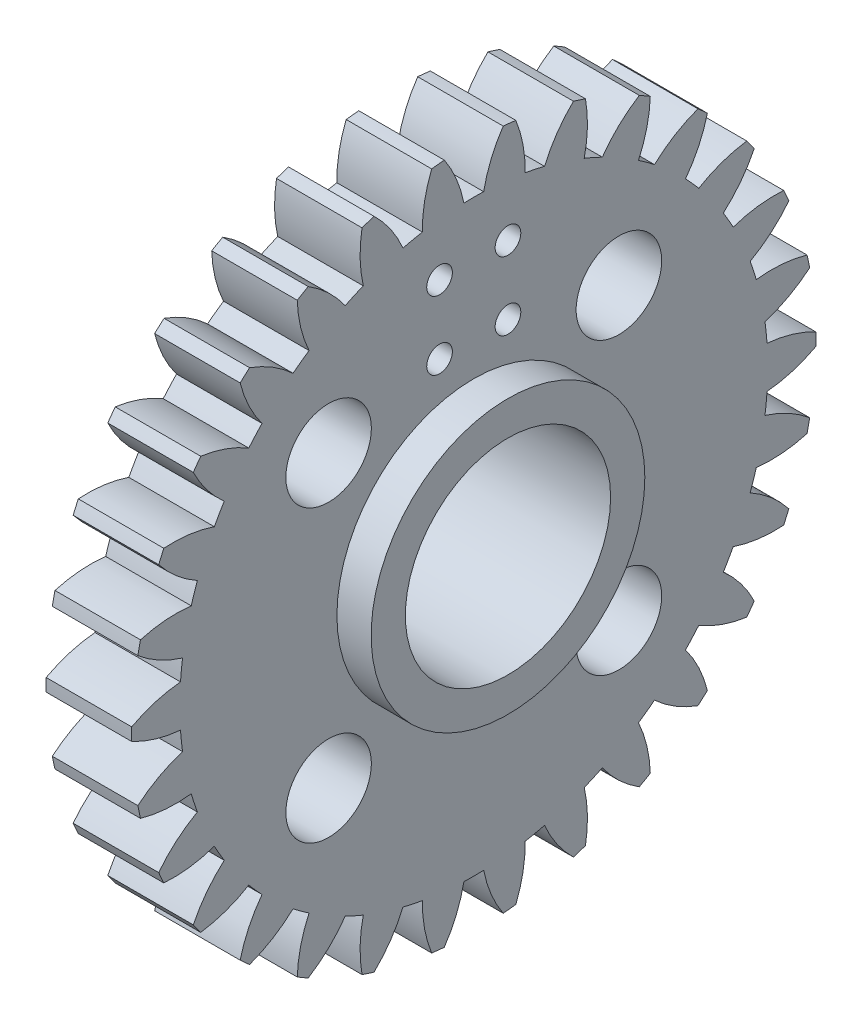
ISO-10303-21;
HEADER;
FILE_DESCRIPTION(('STEP AP214'),'2;1');
FILE_NAME('part.step','',(''),(''),'','','');
FILE_SCHEMA(('AUTOMOTIVE_DESIGN { 1 0 10303 214 1 1 1 1 }'));
ENDSEC;
DATA;
#1=APPLICATION_CONTEXT('core data for automotive mechanical design processes');
#2=APPLICATION_PROTOCOL_DEFINITION('international standard','automotive_design',2000,#1);
#3=PRODUCT_CONTEXT('',#1,'mechanical');
#4=PRODUCT('Part','Part','',(#3));
#5=PRODUCT_RELATED_PRODUCT_CATEGORY('part','',(#4));
#6=PRODUCT_DEFINITION_FORMATION('','',#4);
#7=PRODUCT_DEFINITION_CONTEXT('part definition',#1,'design');
#8=PRODUCT_DEFINITION('design','',#6,#7);
#9=PRODUCT_DEFINITION_SHAPE('','',#8);
#10=(LENGTH_UNIT() NAMED_UNIT(*) SI_UNIT(.MILLI.,.METRE.));
#11=(NAMED_UNIT(*) PLANE_ANGLE_UNIT() SI_UNIT($,.RADIAN.));
#12=(NAMED_UNIT(*) SI_UNIT($,.STERADIAN.) SOLID_ANGLE_UNIT());
#13=UNCERTAINTY_MEASURE_WITH_UNIT(LENGTH_MEASURE(1.E-05),#10,'distance_accuracy_value','');
#14=(GEOMETRIC_REPRESENTATION_CONTEXT(3) GLOBAL_UNCERTAINTY_ASSIGNED_CONTEXT((#13)) GLOBAL_UNIT_ASSIGNED_CONTEXT((#10,
#11,#12)) REPRESENTATION_CONTEXT('',''));
#15=CARTESIAN_POINT('',(0.,0.,0.));
#16=DIRECTION('',(0.,0.,1.));
#17=DIRECTION('',(1.,0.,0.));
#18=AXIS2_PLACEMENT_3D('',#15,#16,#17);
#19=CARTESIAN_POINT('',(5.,0.,0.));
#20=DIRECTION('',(-1.,0.,0.));
#21=DIRECTION('',(0.,0.,1.));
#22=AXIS2_PLACEMENT_3D('',#19,#20,#21);
#23=PLANE('',#22);
#24=CARTESIAN_POINT('',(5.,10.,-2.));
#25=DIRECTION('',(1.,0.,0.));
#26=DIRECTION('',(0.,0.,-1.));
#27=AXIS2_PLACEMENT_3D('',#24,#25,#26);
#28=CIRCLE('',#27,0.75);
#29=CARTESIAN_POINT('',(5.,10.,-2.75));
#30=VERTEX_POINT('',#29);
#31=EDGE_CURVE('E1572',#30,#30,#28,.T.);
#32=ORIENTED_EDGE('',*,*,#31,.F.);
#33=EDGE_LOOP('',(#32));
#34=FACE_BOUND('',#33,.T.);
#35=CARTESIAN_POINT('',(5.,10.,2.));
#36=DIRECTION('',(1.,0.,0.));
#37=DIRECTION('',(0.,0.,1.));
#38=AXIS2_PLACEMENT_3D('',#35,#36,#37);
#39=CIRCLE('',#38,0.75);
#40=CARTESIAN_POINT('',(5.,10.,2.75));
#41=VERTEX_POINT('',#40);
#42=EDGE_CURVE('E1562',#41,#41,#39,.T.);
#43=ORIENTED_EDGE('',*,*,#42,.F.);
#44=EDGE_LOOP('',(#43));
#45=FACE_BOUND('',#44,.T.);
#46=CARTESIAN_POINT('',(5.,14.,-2.));
#47=DIRECTION('',(1.,0.,0.));
#48=DIRECTION('',(0.,0.,1.));
#49=AXIS2_PLACEMENT_3D('',#46,#47,#48);
#50=CIRCLE('',#49,0.75);
#51=CARTESIAN_POINT('',(5.,14.,-1.25));
#52=VERTEX_POINT('',#51);
#53=EDGE_CURVE('E1559',#52,#52,#50,.T.);
#54=ORIENTED_EDGE('',*,*,#53,.F.);
#55=EDGE_LOOP('',(#54));
#56=FACE_BOUND('',#55,.T.);
#57=CARTESIAN_POINT('',(5.,14.,2.));
#58=DIRECTION('',(1.,0.,0.));
#59=DIRECTION('',(0.,0.,-1.));
#60=AXIS2_PLACEMENT_3D('',#57,#58,#59);
#61=CIRCLE('',#60,0.75);
#62=CARTESIAN_POINT('',(5.,14.,1.25));
#63=VERTEX_POINT('',#62);
#64=EDGE_CURVE('E1556',#63,#63,#61,.T.);
#65=ORIENTED_EDGE('',*,*,#64,.F.);
#66=EDGE_LOOP('',(#65));
#67=FACE_BOUND('',#66,.T.);
#68=CARTESIAN_POINT('',(5.,-8.48528137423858,8.48528137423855));
#69=DIRECTION('',(1.,0.,0.));
#70=DIRECTION('',(0.,0.,-1.));
#71=AXIS2_PLACEMENT_3D('',#68,#69,#70);
#72=CIRCLE('',#71,2.5);
#73=CARTESIAN_POINT('',(5.,-8.48528137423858,5.98528137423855));
#74=VERTEX_POINT('',#73);
#75=EDGE_CURVE('E1552',#74,#74,#72,.T.);
#76=ORIENTED_EDGE('',*,*,#75,.F.);
#77=EDGE_LOOP('',(#76));
#78=FACE_BOUND('',#77,.T.);
#79=CARTESIAN_POINT('',(5.,-8.48528137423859,-8.48528137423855));
#80=DIRECTION('',(1.,0.,0.));
#81=DIRECTION('',(0.,0.,1.));
#82=AXIS2_PLACEMENT_3D('',#79,#80,#81);
#83=CIRCLE('',#82,2.5);
#84=CARTESIAN_POINT('',(5.,-8.48528137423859,-5.98528137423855));
#85=VERTEX_POINT('',#84);
#86=EDGE_CURVE('E1548',#85,#85,#83,.T.);
#87=ORIENTED_EDGE('',*,*,#86,.F.);
#88=EDGE_LOOP('',(#87));
#89=FACE_BOUND('',#88,.T.);
#90=CARTESIAN_POINT('',(5.,8.48528137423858,8.48528137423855));
#91=DIRECTION('',(1.,0.,0.));
#92=DIRECTION('',(0.,0.,1.));
#93=AXIS2_PLACEMENT_3D('',#90,#91,#92);
#94=CIRCLE('',#93,2.5);
#95=CARTESIAN_POINT('',(5.,8.48528137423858,10.9852813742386));
#96=VERTEX_POINT('',#95);
#97=EDGE_CURVE('E1544',#96,#96,#94,.T.);
#98=ORIENTED_EDGE('',*,*,#97,.F.);
#99=EDGE_LOOP('',(#98));
#100=FACE_BOUND('',#99,.T.);
#101=CARTESIAN_POINT('',(5.,8.48528137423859,-8.48528137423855));
#102=DIRECTION('',(1.,0.,0.));
#103=DIRECTION('',(0.,0.,-1.));
#104=AXIS2_PLACEMENT_3D('',#101,#102,#103);
#105=CIRCLE('',#104,2.5);
#106=CARTESIAN_POINT('',(5.,8.48528137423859,-10.9852813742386));
#107=VERTEX_POINT('',#106);
#108=EDGE_CURVE('E1540',#107,#107,#105,.T.);
#109=ORIENTED_EDGE('',*,*,#108,.F.);
#110=EDGE_LOOP('',(#109));
#111=FACE_BOUND('',#110,.T.);
#112=CARTESIAN_POINT('',(5.,0.,0.));
#113=DIRECTION('',(-1.,0.,0.));
#114=DIRECTION('',(0.,0.,1.));
#115=AXIS2_PLACEMENT_3D('',#112,#113,#114);
#116=CIRCLE('',#115,8.);
#117=CARTESIAN_POINT('',(5.,0.,8.));
#118=VERTEX_POINT('',#117);
#119=EDGE_CURVE('E797',#118,#118,#116,.T.);
#120=ORIENTED_EDGE('',*,*,#119,.T.);
#121=EDGE_LOOP('',(#120));
#122=FACE_BOUND('',#121,.T.);
#123=CARTESIAN_POINT('',(5.,13.7355495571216,-11.0350431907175));
#124=DIRECTION('',(-1.,0.,0.));
#125=DIRECTION('',(0.,-0.207911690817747,-0.978147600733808));
#126=AXIS2_PLACEMENT_3D('',#123,#124,#125);
#127=CIRCLE('',#126,7.5);
#128=CARTESIAN_POINT('',(5.,16.6810012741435,-4.13762960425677));
#129=VERTEX_POINT('',#128);
#130=CARTESIAN_POINT('',(5.,19.1323536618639,-5.82692400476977));
#131=VERTEX_POINT('',#130);
#132=EDGE_CURVE('E781',#129,#131,#127,.T.);
#133=ORIENTED_EDGE('',*,*,#132,.F.);
#134=CARTESIAN_POINT('',(5.,0.,0.));
#135=DIRECTION('',(-1.,0.,0.));
#136=DIRECTION('',(0.,-0.207911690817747,-0.978147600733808));
#137=AXIS2_PLACEMENT_3D('',#134,#135,#136);
#138=CIRCLE('',#137,17.1865);
#139=CARTESIAN_POINT('',(5.,16.9217785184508,-3.00486173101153));
#140=VERTEX_POINT('',#139);
#141=EDGE_CURVE('E780',#140,#129,#138,.T.);
#142=ORIENTED_EDGE('',*,*,#141,.F.);
#143=CARTESIAN_POINT('',(5.,17.0364053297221,4.49426226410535));
#144=DIRECTION('',(-1.,0.,0.));
#145=DIRECTION('',(0.,-0.207911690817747,-0.978147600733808));
#146=AXIS2_PLACEMENT_3D('',#143,#144,#145);
#147=CIRCLE('',#146,7.5);
#148=CARTESIAN_POINT('',(5.,19.8482982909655,-2.45866934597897));
#149=VERTEX_POINT('',#148);
#150=EDGE_CURVE('E769',#149,#140,#147,.T.);
#151=ORIENTED_EDGE('',*,*,#150,.F.);
#152=CARTESIAN_POINT('',(5.,0.,0.));
#153=DIRECTION('',(-1.,0.,0.));
#154=DIRECTION('',(0.,0.,1.));
#155=AXIS2_PLACEMENT_3D('',#152,#153,#154);
#156=CIRCLE('',#155,20.);
#157=CARTESIAN_POINT('',(5.,19.9257514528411,-1.72175173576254));
#158=VERTEX_POINT('',#157);
#159=EDGE_CURVE('E1443',#158,#149,#156,.T.);
#160=ORIENTED_EDGE('',*,*,#159,.F.);
#161=CARTESIAN_POINT('',(5.,15.7297093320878,-7.93811968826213));
#162=DIRECTION('',(-1.,0.,0.));
#163=DIRECTION('',(0.,0.,-1.));
#164=AXIS2_PLACEMENT_3D('',#161,#162,#163);
#165=CIRCLE('',#164,7.5);
#166=CARTESIAN_POINT('',(5.,17.1767429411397,-0.579037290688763));
#167=VERTEX_POINT('',#166);
#168=EDGE_CURVE('E1416',#167,#158,#165,.T.);
#169=ORIENTED_EDGE('',*,*,#168,.F.);
#170=CARTESIAN_POINT('',(5.,0.,0.));
#171=DIRECTION('',(-1.,0.,0.));
#172=DIRECTION('',(0.,0.,-1.));
#173=AXIS2_PLACEMENT_3D('',#170,#171,#172);
#174=CIRCLE('',#173,17.1865);
#175=CARTESIAN_POINT('',(5.,17.1767429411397,0.579037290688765));
#176=VERTEX_POINT('',#175);
#177=EDGE_CURVE('E1421',#176,#167,#174,.T.);
#178=ORIENTED_EDGE('',*,*,#177,.F.);
#179=CARTESIAN_POINT('',(5.,15.7297093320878,7.93811968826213));
#180=DIRECTION('',(-1.,0.,0.));
#181=DIRECTION('',(0.,0.,-1.));
#182=AXIS2_PLACEMENT_3D('',#179,#180,#181);
#183=CIRCLE('',#182,7.5);
#184=CARTESIAN_POINT('',(5.,19.9257514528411,1.72175173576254));
#185=VERTEX_POINT('',#184);
#186=EDGE_CURVE('E1418',#185,#176,#183,.T.);
#187=ORIENTED_EDGE('',*,*,#186,.F.);
#188=CARTESIAN_POINT('',(5.,19.8482982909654,2.45866934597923));
#189=VERTEX_POINT('',#188);
#190=EDGE_CURVE('E1441',#189,#185,#156,.T.);
#191=ORIENTED_EDGE('',*,*,#190,.F.);
#192=CARTESIAN_POINT('',(5.,17.0364053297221,-4.49426226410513));
#193=DIRECTION('',(-1.,0.,0.));
#194=DIRECTION('',(0.,0.20791169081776,-0.978147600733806));
#195=AXIS2_PLACEMENT_3D('',#192,#193,#194);
#196=CIRCLE('',#195,7.5);
#197=CARTESIAN_POINT('',(5.,16.9217785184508,3.00486173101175));
#198=VERTEX_POINT('',#197);
#199=EDGE_CURVE('E1394',#198,#189,#196,.T.);
#200=ORIENTED_EDGE('',*,*,#199,.F.);
#201=CARTESIAN_POINT('',(5.,0.,0.));
#202=DIRECTION('',(-1.,0.,0.));
#203=DIRECTION('',(0.,0.20791169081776,-0.978147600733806));
#204=AXIS2_PLACEMENT_3D('',#201,#202,#203);
#205=CIRCLE('',#204,17.1865);
#206=CARTESIAN_POINT('',(5.,16.6810012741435,4.13762960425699));
#207=VERTEX_POINT('',#206);
#208=EDGE_CURVE('E1399',#207,#198,#205,.T.);
#209=ORIENTED_EDGE('',*,*,#208,.F.);
#210=CARTESIAN_POINT('',(5.,13.7355495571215,11.0350431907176));
#211=DIRECTION('',(-1.,0.,0.));
#212=DIRECTION('',(0.,0.20791169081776,-0.978147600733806));
#213=AXIS2_PLACEMENT_3D('',#210,#211,#212);
#214=CIRCLE('',#213,7.5);
#215=CARTESIAN_POINT('',(5.,19.1323536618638,5.82692400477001));
#216=VERTEX_POINT('',#215);
#217=EDGE_CURVE('E1396',#216,#207,#214,.T.);
#218=ORIENTED_EDGE('',*,*,#217,.F.);
#219=CARTESIAN_POINT('',(5.,18.9033792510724,6.53163477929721));
#220=VERTEX_POINT('',#219);
#221=EDGE_CURVE('E1730',#220,#216,#156,.T.);
#222=ORIENTED_EDGE('',*,*,#221,.F.);
#223=CARTESIAN_POINT('',(5.,17.5985286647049,-0.853984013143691));
#224=DIRECTION('',(-1.,0.,0.));
#225=DIRECTION('',(0.,0.406736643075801,-0.913545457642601));
#226=AXIS2_PLACEMENT_3D('',#223,#224,#225);
#227=CIRCLE('',#226,7.5);
#228=CARTESIAN_POINT('',(5.,15.9272511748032,6.45743387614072));
#229=VERTEX_POINT('',#228);
#230=EDGE_CURVE('E1372',#229,#220,#227,.T.);
#231=ORIENTED_EDGE('',*,*,#230,.F.);
#232=CARTESIAN_POINT('',(5.,0.,0.));
#233=DIRECTION('',(-1.,0.,0.));
#234=DIRECTION('',(0.,0.406736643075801,-0.913545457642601));
#235=AXIS2_PLACEMENT_3D('',#232,#233,#234);
#236=CIRCLE('',#235,17.1865);
#237=CARTESIAN_POINT('',(5.,15.4562198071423,7.51538764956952));
#238=VERTEX_POINT('',#237);
#239=EDGE_CURVE('E1377',#238,#229,#236,.T.);
#240=ORIENTED_EDGE('',*,*,#239,.F.);
#241=CARTESIAN_POINT('',(5.,11.1410803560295,13.6496823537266));
#242=DIRECTION('',(-1.,0.,0.));
#243=DIRECTION('',(0.,0.406736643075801,-0.913545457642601));
#244=AXIS2_PLACEMENT_3D('',#241,#242,#243);
#245=CIRCLE('',#244,7.5);
#246=CARTESIAN_POINT('',(5.,17.5027802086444,9.67743173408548));
#247=VERTEX_POINT('',#246);
#248=EDGE_CURVE('E1374',#247,#238,#245,.T.);
#249=ORIENTED_EDGE('',*,*,#248,.F.);
#250=CARTESIAN_POINT('',(5.,17.1322918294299,10.3191364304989));
#251=VERTEX_POINT('',#250);
#252=EDGE_CURVE('E1725',#251,#247,#156,.T.);
#253=ORIENTED_EDGE('',*,*,#252,.F.);
#254=CARTESIAN_POINT('',(5.,17.3915118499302,2.82361743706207));
#255=DIRECTION('',(-1.,0.,0.));
#256=DIRECTION('',(0.,0.587785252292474,-0.809016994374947));
#257=AXIS2_PLACEMENT_3D('',#254,#255,#256);
#258=CIRCLE('',#257,7.5);
#259=CARTESIAN_POINT('',(5.,14.2366265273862,9.62778517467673));
#260=VERTEX_POINT('',#259);
#261=EDGE_CURVE('E1350',#260,#251,#258,.T.);
#262=ORIENTED_EDGE('',*,*,#261,.F.);
#263=CARTESIAN_POINT('',(5.,0.,0.));
#264=DIRECTION('',(-1.,0.,0.));
#265=DIRECTION('',(0.,0.587785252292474,-0.809016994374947));
#266=AXIS2_PLACEMENT_3D('',#263,#264,#265);
#267=CIRCLE('',#266,17.1865);
#268=CARTESIAN_POINT('',(5.,13.5559273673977,10.5646871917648));
#269=VERTEX_POINT('',#268);
#270=EDGE_CURVE('E1355',#269,#260,#267,.T.);
#271=ORIENTED_EDGE('',*,*,#270,.F.);
#272=CARTESIAN_POINT('',(5.,8.05969248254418,15.6677648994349));
#273=DIRECTION('',(-1.,0.,0.));
#274=DIRECTION('',(0.,0.587785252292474,-0.809016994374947));
#275=AXIS2_PLACEMENT_3D('',#272,#273,#274);
#276=CIRCLE('',#275,7.5);
#277=CARTESIAN_POINT('',(5.,15.1082512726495,13.1049892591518));
#278=VERTEX_POINT('',#277);
#279=EDGE_CURVE('E1352',#278,#269,#276,.T.);
#280=ORIENTED_EDGE('',*,*,#279,.F.);
#281=CARTESIAN_POINT('',(5.,14.6124410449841,13.6556423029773));
#282=VERTEX_POINT('',#281);
#283=EDGE_CURVE('E1720',#282,#278,#156,.T.);
#284=ORIENTED_EDGE('',*,*,#283,.F.);
#285=CARTESIAN_POINT('',(5.,16.4244025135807,6.3778132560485));
#286=DIRECTION('',(-1.,0.,0.));
#287=DIRECTION('',(0.,0.743144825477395,-0.669130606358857));
#288=AXIS2_PLACEMENT_3D('',#285,#286,#287);
#289=CIRCLE('',#288,7.5);
#290=CARTESIAN_POINT('',(5.,11.9237929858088,12.3773560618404));
#291=VERTEX_POINT('',#290);
#292=EDGE_CURVE('E1328',#291,#282,#289,.T.);
#293=ORIENTED_EDGE('',*,*,#292,.F.);
#294=CARTESIAN_POINT('',(5.,0.,0.));
#295=DIRECTION('',(-1.,0.,0.));
#296=DIRECTION('',(0.,0.743144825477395,-0.669130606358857));
#297=AXIS2_PLACEMENT_3D('',#294,#295,#296);
#298=CIRCLE('',#297,17.1865);
#299=CARTESIAN_POINT('',(5.,11.0631758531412,13.1522592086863));
#300=VERTEX_POINT('',#299);
#301=EDGE_CURVE('E1333',#300,#291,#298,.T.);
#302=ORIENTED_EDGE('',*,*,#301,.F.);
#303=CARTESIAN_POINT('',(5.,4.62605737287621,17.0010909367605));
#304=DIRECTION('',(-1.,0.,0.));
#305=DIRECTION('',(0.,0.743144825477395,-0.669130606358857));
#306=AXIS2_PLACEMENT_3D('',#303,#304,#305);
#307=CIRCLE('',#306,7.5);
#308=CARTESIAN_POINT('',(5.,12.0534192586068,15.9597958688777));
#309=VERTEX_POINT('',#308);
#310=EDGE_CURVE('E1330',#309,#300,#307,.T.);
#311=ORIENTED_EDGE('',*,*,#310,.F.);
#312=CARTESIAN_POINT('',(5.,11.4539564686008,16.3953310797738));
#313=VERTEX_POINT('',#312);
#314=EDGE_CURVE('E1715',#313,#309,#156,.T.);
#315=ORIENTED_EDGE('',*,*,#314,.F.);
#316=CARTESIAN_POINT('',(5.,14.7394679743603,9.65326803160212));
#317=DIRECTION('',(-1.,0.,0.));
#318=DIRECTION('',(0.,0.86602540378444,-0.499999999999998));
#319=AXIS2_PLACEMENT_3D('',#316,#317,#318);
#320=CIRCLE('',#319,7.5);
#321=CARTESIAN_POINT('',(5.,9.08983247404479,14.5859770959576));
#322=VERTEX_POINT('',#321);
#323=EDGE_CURVE('E1306',#322,#313,#320,.T.);
#324=ORIENTED_EDGE('',*,*,#323,.F.);
#325=CARTESIAN_POINT('',(5.,0.,0.));
#326=DIRECTION('',(-1.,0.,0.));
#327=DIRECTION('',(0.,0.86602540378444,-0.499999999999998));
#328=AXIS2_PLACEMENT_3D('',#325,#326,#327);
#329=CIRCLE('',#328,17.1865);
#330=CARTESIAN_POINT('',(5.,8.08691046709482,15.1650143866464));
#331=VERTEX_POINT('',#330);
#332=EDGE_CURVE('E1311',#331,#322,#329,.T.);
#333=ORIENTED_EDGE('',*,*,#332,.F.);
#334=CARTESIAN_POINT('',(5.,0.990241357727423,17.5913877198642));
#335=DIRECTION('',(-1.,0.,0.));
#336=DIRECTION('',(0.,0.86602540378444,-0.499999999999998));
#337=AXIS2_PLACEMENT_3D('',#334,#335,#336);
#338=CIRCLE('',#337,7.5);
#339=CARTESIAN_POINT('',(5.,8.47179498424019,18.1170828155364));
#340=VERTEX_POINT('',#339);
#341=EDGE_CURVE('E1308',#340,#331,#338,.T.);
#342=ORIENTED_EDGE('',*,*,#341,.F.);
#343=CARTESIAN_POINT('',(5.,7.7948790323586,18.418465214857));
#344=VERTEX_POINT('',#343);
#345=EDGE_CURVE('E1710',#344,#340,#156,.T.);
#346=ORIENTED_EDGE('',*,*,#345,.F.);
#347=CARTESIAN_POINT('',(5.,12.4103479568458,12.5068286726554));
#348=DIRECTION('',(-1.,0.,0.));
#349=DIRECTION('',(0.,0.951056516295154,-0.309016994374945));
#350=AXIS2_PLACEMENT_3D('',#347,#348,#349);
#351=CIRCLE('',#350,7.5);
#352=CARTESIAN_POINT('',(5.,5.85860266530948,16.157120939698));
#353=VERTEX_POINT('',#352);
#354=EDGE_CURVE('E1284',#353,#344,#351,.T.);
#355=ORIENTED_EDGE('',*,*,#354,.F.);
#356=CARTESIAN_POINT('',(5.,0.,0.));
#357=DIRECTION('',(-1.,0.,0.));
#358=DIRECTION('',(0.,0.951056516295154,-0.309016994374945));
#359=AXIS2_PLACEMENT_3D('',#356,#357,#358);
#360=CIRCLE('',#359,17.1865);
#361=CARTESIAN_POINT('',(5.,4.7572082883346,16.5149856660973));
#362=VERTEX_POINT('',#361);
#363=EDGE_CURVE('E1289',#362,#353,#360,.T.);
#364=ORIENTED_EDGE('',*,*,#363,.F.);
#365=CARTESIAN_POINT('',(5.,-2.68885295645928,17.4128564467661));
#366=DIRECTION('',(-1.,0.,0.));
#367=DIRECTION('',(0.,0.951056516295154,-0.309016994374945));
#368=AXIS2_PLACEMENT_3D('',#365,#366,#367);
#369=CIRCLE('',#368,7.5);
#370=CARTESIAN_POINT('',(5.,4.51991261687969,19.4825663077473));
#371=VERTEX_POINT('',#370);
#372=EDGE_CURVE('E1286',#371,#362,#369,.T.);
#373=ORIENTED_EDGE('',*,*,#372,.F.);
#374=CARTESIAN_POINT('',(5.,3.7951279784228,19.636624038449));
#375=VERTEX_POINT('',#374);
#376=EDGE_CURVE('E1705',#375,#371,#156,.T.);
#377=ORIENTED_EDGE('',*,*,#376,.F.);
#378=CARTESIAN_POINT('',(5.,9.53883618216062,14.8137808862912));
#379=DIRECTION('',(-1.,0.,0.));
#380=DIRECTION('',(0.,0.994521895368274,-0.10452846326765));
#381=AXIS2_PLACEMENT_3D('',#378,#379,#380);
#382=CIRCLE('',#381,7.5);
#383=CARTESIAN_POINT('',(5.,2.37132380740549,17.0221210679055));
#384=VERTEX_POINT('',#383);
#385=EDGE_CURVE('E1262',#384,#375,#382,.T.);
#386=ORIENTED_EDGE('',*,*,#385,.F.);
#387=CARTESIAN_POINT('',(5.,0.,0.));
#388=DIRECTION('',(-1.,0.,0.));
#389=DIRECTION('',(0.,0.994521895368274,-0.10452846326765));
#390=AXIS2_PLACEMENT_3D('',#387,#388,#389);
#391=CIRCLE('',#390,17.1865);
#392=CARTESIAN_POINT('',(5.,1.21959327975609,17.1431728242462));
#393=VERTEX_POINT('',#392);
#394=EDGE_CURVE('E1267',#393,#384,#391,.T.);
#395=ORIENTED_EDGE('',*,*,#394,.F.);
#396=CARTESIAN_POINT('',(5.,-6.25043149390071,16.4732997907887));
#397=DIRECTION('',(-1.,0.,0.));
#398=DIRECTION('',(0.,0.994521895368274,-0.10452846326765));
#399=AXIS2_PLACEMENT_3D('',#396,#397,#398);
#400=CIRCLE('',#399,7.5);
#401=CARTESIAN_POINT('',(5.,0.370488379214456,19.9965681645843));
#402=VERTEX_POINT('',#401);
#403=EDGE_CURVE('E1264',#402,#393,#400,.T.);
#404=ORIENTED_EDGE('',*,*,#403,.F.);
#405=CARTESIAN_POINT('',(5.,-0.370488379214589,19.9965681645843));
#406=VERTEX_POINT('',#405);
#407=EDGE_CURVE('E1700',#406,#402,#156,.T.);
#408=ORIENTED_EDGE('',*,*,#407,.F.);
#409=CARTESIAN_POINT('',(5.,6.2504314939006,16.4732997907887));
#410=DIRECTION('',(-1.,0.,0.));
#411=DIRECTION('',(0.,0.994521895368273,0.104528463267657));
#412=AXIS2_PLACEMENT_3D('',#409,#410,#411);
#413=CIRCLE('',#412,7.5);
#414=CARTESIAN_POINT('',(5.,-1.21959327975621,17.1431728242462));
#415=VERTEX_POINT('',#414);
#416=EDGE_CURVE('E1240',#415,#406,#413,.T.);
#417=ORIENTED_EDGE('',*,*,#416,.F.);
#418=CARTESIAN_POINT('',(5.,0.,0.));
#419=DIRECTION('',(-1.,0.,0.));
#420=DIRECTION('',(0.,0.994521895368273,0.104528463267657));
#421=AXIS2_PLACEMENT_3D('',#418,#419,#420);
#422=CIRCLE('',#421,17.1865);
#423=CARTESIAN_POINT('',(5.,-2.37132380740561,17.0221210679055));
#424=VERTEX_POINT('',#423);
#425=EDGE_CURVE('E1245',#424,#415,#422,.T.);
#426=ORIENTED_EDGE('',*,*,#425,.F.);
#427=CARTESIAN_POINT('',(5.,-9.53883618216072,14.8137808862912));
#428=DIRECTION('',(-1.,0.,0.));
#429=DIRECTION('',(0.,0.994521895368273,0.104528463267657));
#430=AXIS2_PLACEMENT_3D('',#427,#428,#429);
#431=CIRCLE('',#430,7.5);
#432=CARTESIAN_POINT('',(5.,-3.79512797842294,19.636624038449));
#433=VERTEX_POINT('',#432);
#434=EDGE_CURVE('E1242',#433,#424,#431,.T.);
#435=ORIENTED_EDGE('',*,*,#434,.F.);
#436=CARTESIAN_POINT('',(5.,-4.51991261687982,19.4825663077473));
#437=VERTEX_POINT('',#436);
#438=EDGE_CURVE('E1695',#437,#433,#156,.T.);
#439=ORIENTED_EDGE('',*,*,#438,.F.);
#440=CARTESIAN_POINT('',(5.,2.68885295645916,17.4128564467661));
#441=DIRECTION('',(-1.,0.,0.));
#442=DIRECTION('',(0.,0.951056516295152,0.309016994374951));
#443=AXIS2_PLACEMENT_3D('',#440,#441,#442);
#444=CIRCLE('',#443,7.5);
#445=CARTESIAN_POINT('',(5.,-4.75720828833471,16.5149856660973));
#446=VERTEX_POINT('',#445);
#447=EDGE_CURVE('E1218',#446,#437,#444,.T.);
#448=ORIENTED_EDGE('',*,*,#447,.F.);
#449=CARTESIAN_POINT('',(5.,0.,0.));
#450=DIRECTION('',(-1.,0.,0.));
#451=DIRECTION('',(0.,0.951056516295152,0.309016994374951));
#452=AXIS2_PLACEMENT_3D('',#449,#450,#451);
#453=CIRCLE('',#452,17.1865);
#454=CARTESIAN_POINT('',(5.,-5.85860266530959,16.157120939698));
#455=VERTEX_POINT('',#454);
#456=EDGE_CURVE('E1223',#455,#446,#453,.T.);
#457=ORIENTED_EDGE('',*,*,#456,.F.);
#458=CARTESIAN_POINT('',(5.,-12.4103479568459,12.5068286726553));
#459=DIRECTION('',(-1.,0.,0.));
#460=DIRECTION('',(0.,0.951056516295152,0.309016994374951));
#461=AXIS2_PLACEMENT_3D('',#458,#459,#460);
#462=CIRCLE('',#461,7.5);
#463=CARTESIAN_POINT('',(5.,-7.79487903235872,18.4184652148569));
#464=VERTEX_POINT('',#463);
#465=EDGE_CURVE('E1220',#464,#455,#462,.T.);
#466=ORIENTED_EDGE('',*,*,#465,.F.);
#467=CARTESIAN_POINT('',(5.,-8.47179498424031,18.1170828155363));
#468=VERTEX_POINT('',#467);
#469=EDGE_CURVE('E1690',#468,#464,#156,.T.);
#470=ORIENTED_EDGE('',*,*,#469,.F.);
#471=CARTESIAN_POINT('',(5.,-0.990241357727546,17.5913877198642));
#472=DIRECTION('',(-1.,0.,0.));
#473=DIRECTION('',(0.,0.866025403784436,0.500000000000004));
#474=AXIS2_PLACEMENT_3D('',#471,#472,#473);
#475=CIRCLE('',#474,7.5);
#476=CARTESIAN_POINT('',(5.,-8.08691046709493,15.1650143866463));
#477=VERTEX_POINT('',#476);
#478=EDGE_CURVE('E1196',#477,#468,#475,.T.);
#479=ORIENTED_EDGE('',*,*,#478,.F.);
#480=CARTESIAN_POINT('',(5.,0.,0.));
#481=DIRECTION('',(-1.,0.,0.));
#482=DIRECTION('',(0.,0.866025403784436,0.500000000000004));
#483=AXIS2_PLACEMENT_3D('',#480,#481,#482);
#484=CIRCLE('',#483,17.1865);
#485=CARTESIAN_POINT('',(5.,-9.0898324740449,14.5859770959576));
#486=VERTEX_POINT('',#485);
#487=EDGE_CURVE('E1201',#486,#477,#484,.T.);
#488=ORIENTED_EDGE('',*,*,#487,.F.);
#489=CARTESIAN_POINT('',(5.,-14.7394679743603,9.65326803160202));
#490=DIRECTION('',(-1.,0.,0.));
#491=DIRECTION('',(0.,0.866025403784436,0.500000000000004));
#492=AXIS2_PLACEMENT_3D('',#489,#490,#491);
#493=CIRCLE('',#492,7.5);
#494=CARTESIAN_POINT('',(5.,-11.4539564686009,16.3953310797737));
#495=VERTEX_POINT('',#494);
#496=EDGE_CURVE('E1198',#495,#486,#493,.T.);
#497=ORIENTED_EDGE('',*,*,#496,.F.);
#498=CARTESIAN_POINT('',(5.,-12.0534192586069,15.9597958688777));
#499=VERTEX_POINT('',#498);
#500=EDGE_CURVE('E1685',#499,#495,#156,.T.);
#501=ORIENTED_EDGE('',*,*,#500,.F.);
#502=CARTESIAN_POINT('',(5.,-4.62605737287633,17.0010909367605));
#503=DIRECTION('',(-1.,0.,0.));
#504=DIRECTION('',(0.,0.743144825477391,0.669130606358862));
#505=AXIS2_PLACEMENT_3D('',#502,#503,#504);
#506=CIRCLE('',#505,7.5);
#507=CARTESIAN_POINT('',(5.,-11.0631758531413,13.1522592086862));
#508=VERTEX_POINT('',#507);
#509=EDGE_CURVE('E1174',#508,#499,#506,.T.);
#510=ORIENTED_EDGE('',*,*,#509,.F.);
#511=CARTESIAN_POINT('',(5.,0.,0.));
#512=DIRECTION('',(-1.,0.,0.));
#513=DIRECTION('',(0.,0.743144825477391,0.669130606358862));
#514=AXIS2_PLACEMENT_3D('',#511,#512,#513);
#515=CIRCLE('',#514,17.1865);
#516=CARTESIAN_POINT('',(5.,-11.9237929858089,12.3773560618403));
#517=VERTEX_POINT('',#516);
#518=EDGE_CURVE('E1179',#517,#508,#515,.T.);
#519=ORIENTED_EDGE('',*,*,#518,.F.);
#520=CARTESIAN_POINT('',(5.,-16.4244025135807,6.37781325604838));
#521=DIRECTION('',(-1.,0.,0.));
#522=DIRECTION('',(0.,0.743144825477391,0.669130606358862));
#523=AXIS2_PLACEMENT_3D('',#520,#521,#522);
#524=CIRCLE('',#523,7.5);
#525=CARTESIAN_POINT('',(5.,-14.6124410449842,13.6556423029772));
#526=VERTEX_POINT('',#525);
#527=EDGE_CURVE('E1176',#526,#517,#524,.T.);
#528=ORIENTED_EDGE('',*,*,#527,.F.);
#529=CARTESIAN_POINT('',(5.,-15.1082512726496,13.1049892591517));
#530=VERTEX_POINT('',#529);
#531=EDGE_CURVE('E1680',#530,#526,#156,.T.);
#532=ORIENTED_EDGE('',*,*,#531,.F.);
#533=CARTESIAN_POINT('',(5.,-8.05969248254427,15.6677648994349));
#534=DIRECTION('',(-1.,0.,0.));
#535=DIRECTION('',(0.,0.587785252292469,0.80901699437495));
#536=AXIS2_PLACEMENT_3D('',#533,#534,#535);
#537=CIRCLE('',#536,7.5);
#538=CARTESIAN_POINT('',(5.,-13.5559273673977,10.5646871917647));
#539=VERTEX_POINT('',#538);
#540=EDGE_CURVE('E1152',#539,#530,#537,.T.);
#541=ORIENTED_EDGE('',*,*,#540,.F.);
#542=CARTESIAN_POINT('',(5.,0.,0.));
#543=DIRECTION('',(-1.,0.,0.));
#544=DIRECTION('',(0.,0.587785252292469,0.80901699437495));
#545=AXIS2_PLACEMENT_3D('',#542,#543,#544);
#546=CIRCLE('',#545,17.1865);
#547=CARTESIAN_POINT('',(5.,-14.2366265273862,9.62778517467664));
#548=VERTEX_POINT('',#547);
#549=EDGE_CURVE('E1157',#548,#539,#546,.T.);
#550=ORIENTED_EDGE('',*,*,#549,.F.);
#551=CARTESIAN_POINT('',(5.,-17.3915118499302,2.82361743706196));
#552=DIRECTION('',(-1.,0.,0.));
#553=DIRECTION('',(0.,0.587785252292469,0.80901699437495));
#554=AXIS2_PLACEMENT_3D('',#551,#552,#553);
#555=CIRCLE('',#554,7.5);
#556=CARTESIAN_POINT('',(5.,-17.13229182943,10.3191364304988));
#557=VERTEX_POINT('',#556);
#558=EDGE_CURVE('E1154',#557,#548,#555,.T.);
#559=ORIENTED_EDGE('',*,*,#558,.F.);
#560=CARTESIAN_POINT('',(5.,-17.5027802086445,9.67743173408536));
#561=VERTEX_POINT('',#560);
#562=EDGE_CURVE('E1675',#561,#557,#156,.T.);
#563=ORIENTED_EDGE('',*,*,#562,.F.);
#564=CARTESIAN_POINT('',(5.,-11.1410803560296,13.6496823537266));
#565=DIRECTION('',(-1.,0.,0.));
#566=DIRECTION('',(0.,0.406736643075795,0.913545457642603));
#567=AXIS2_PLACEMENT_3D('',#564,#565,#566);
#568=CIRCLE('',#567,7.5);
#569=CARTESIAN_POINT('',(5.,-15.4562198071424,7.51538764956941));
#570=VERTEX_POINT('',#569);
#571=EDGE_CURVE('E1130',#570,#561,#568,.T.);
#572=ORIENTED_EDGE('',*,*,#571,.F.);
#573=CARTESIAN_POINT('',(5.,0.,0.));
#574=DIRECTION('',(-1.,0.,0.));
#575=DIRECTION('',(0.,0.406736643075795,0.913545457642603));
#576=AXIS2_PLACEMENT_3D('',#573,#574,#575);
#577=CIRCLE('',#576,17.1865);
#578=CARTESIAN_POINT('',(5.,-15.9272511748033,6.45743387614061));
#579=VERTEX_POINT('',#578);
#580=EDGE_CURVE('E1135',#579,#570,#577,.T.);
#581=ORIENTED_EDGE('',*,*,#580,.F.);
#582=CARTESIAN_POINT('',(5.,-17.5985286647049,-0.853984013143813));
#583=DIRECTION('',(-1.,0.,0.));
#584=DIRECTION('',(0.,0.406736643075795,0.913545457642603));
#585=AXIS2_PLACEMENT_3D('',#582,#583,#584);
#586=CIRCLE('',#585,7.5);
#587=CARTESIAN_POINT('',(5.,-18.9033792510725,6.53163477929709));
#588=VERTEX_POINT('',#587);
#589=EDGE_CURVE('E1132',#588,#579,#586,.T.);
#590=ORIENTED_EDGE('',*,*,#589,.F.);
#591=CARTESIAN_POINT('',(5.,-19.1323536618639,5.82692400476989));
#592=VERTEX_POINT('',#591);
#593=EDGE_CURVE('E1670',#592,#588,#156,.T.);
#594=ORIENTED_EDGE('',*,*,#593,.F.);
#595=CARTESIAN_POINT('',(5.,-13.7355495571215,11.0350431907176));
#596=DIRECTION('',(-1.,0.,0.));
#597=DIRECTION('',(0.,0.207911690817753,0.978147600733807));
#598=AXIS2_PLACEMENT_3D('',#595,#596,#597);
#599=CIRCLE('',#598,7.5);
#600=CARTESIAN_POINT('',(5.,-16.6810012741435,4.13762960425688));
#601=VERTEX_POINT('',#600);
#602=EDGE_CURVE('E1108',#601,#592,#599,.T.);
#603=ORIENTED_EDGE('',*,*,#602,.F.);
#604=CARTESIAN_POINT('',(5.,0.,0.));
#605=DIRECTION('',(-1.,0.,0.));
#606=DIRECTION('',(0.,0.207911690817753,0.978147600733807));
#607=AXIS2_PLACEMENT_3D('',#604,#605,#606);
#608=CIRCLE('',#607,17.1865);
#609=CARTESIAN_POINT('',(5.,-16.9217785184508,3.00486173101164));
#610=VERTEX_POINT('',#609);
#611=EDGE_CURVE('E1113',#610,#601,#608,.T.);
#612=ORIENTED_EDGE('',*,*,#611,.F.);
#613=CARTESIAN_POINT('',(5.,-17.0364053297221,-4.49426226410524));
#614=DIRECTION('',(-1.,0.,0.));
#615=DIRECTION('',(0.,0.207911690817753,0.978147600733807));
#616=AXIS2_PLACEMENT_3D('',#613,#614,#615);
#617=CIRCLE('',#616,7.5);
#618=CARTESIAN_POINT('',(5.,-19.8482982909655,2.4586693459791));
#619=VERTEX_POINT('',#618);
#620=EDGE_CURVE('E1110',#619,#610,#617,.T.);
#621=ORIENTED_EDGE('',*,*,#620,.F.);
#622=CARTESIAN_POINT('',(5.,-19.9257514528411,1.7217517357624));
#623=VERTEX_POINT('',#622);
#624=EDGE_CURVE('E1665',#623,#619,#156,.T.);
#625=ORIENTED_EDGE('',*,*,#624,.F.);
#626=CARTESIAN_POINT('',(5.,-15.7297093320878,7.93811968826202));
#627=DIRECTION('',(-1.,0.,0.));
#628=DIRECTION('',(0.,0.,1.));
#629=AXIS2_PLACEMENT_3D('',#626,#627,#628);
#630=CIRCLE('',#629,7.5);
#631=CARTESIAN_POINT('',(5.,-17.1767429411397,0.579037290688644));
#632=VERTEX_POINT('',#631);
#633=EDGE_CURVE('E1086',#632,#623,#630,.T.);
#634=ORIENTED_EDGE('',*,*,#633,.F.);
#635=CARTESIAN_POINT('',(5.,0.,0.));
#636=DIRECTION('',(-1.,0.,0.));
#637=DIRECTION('',(0.,0.,1.));
#638=AXIS2_PLACEMENT_3D('',#635,#636,#637);
#639=CIRCLE('',#638,17.1865);
#640=CARTESIAN_POINT('',(5.,-17.1767429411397,-0.579037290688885));
#641=VERTEX_POINT('',#640);
#642=EDGE_CURVE('E1091',#641,#632,#639,.T.);
#643=ORIENTED_EDGE('',*,*,#642,.F.);
#644=CARTESIAN_POINT('',(5.,-15.7297093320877,-7.93811968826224));
#645=DIRECTION('',(-1.,0.,0.));
#646=DIRECTION('',(0.,0.,1.));
#647=AXIS2_PLACEMENT_3D('',#644,#645,#646);
#648=CIRCLE('',#647,7.5);
#649=CARTESIAN_POINT('',(5.,-19.9257514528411,-1.72175173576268));
#650=VERTEX_POINT('',#649);
#651=EDGE_CURVE('E1088',#650,#641,#648,.T.);
#652=ORIENTED_EDGE('',*,*,#651,.F.);
#653=CARTESIAN_POINT('',(5.,-19.8482982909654,-2.45866934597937));
#654=VERTEX_POINT('',#653);
#655=EDGE_CURVE('E1660',#654,#650,#156,.T.);
#656=ORIENTED_EDGE('',*,*,#655,.F.);
#657=CARTESIAN_POINT('',(5.,-17.0364053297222,4.49426226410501));
#658=DIRECTION('',(-1.,0.,0.));
#659=DIRECTION('',(0.,-0.207911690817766,0.978147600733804));
#660=AXIS2_PLACEMENT_3D('',#657,#658,#659);
#661=CIRCLE('',#660,7.5);
#662=CARTESIAN_POINT('',(5.,-16.9217785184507,-3.00486173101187));
#663=VERTEX_POINT('',#662);
#664=EDGE_CURVE('E1064',#663,#654,#661,.T.);
#665=ORIENTED_EDGE('',*,*,#664,.F.);
#666=CARTESIAN_POINT('',(5.,0.,0.));
#667=DIRECTION('',(-1.,0.,0.));
#668=DIRECTION('',(0.,-0.207911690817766,0.978147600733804));
#669=AXIS2_PLACEMENT_3D('',#666,#667,#668);
#670=CIRCLE('',#669,17.1865);
#671=CARTESIAN_POINT('',(5.,-16.6810012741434,-4.1376296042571));
#672=VERTEX_POINT('',#671);
#673=EDGE_CURVE('E1069',#672,#663,#670,.T.);
#674=ORIENTED_EDGE('',*,*,#673,.F.);
#675=CARTESIAN_POINT('',(5.,-13.7355495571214,-11.0350431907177));
#676=DIRECTION('',(-1.,0.,0.));
#677=DIRECTION('',(0.,-0.207911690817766,0.978147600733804));
#678=AXIS2_PLACEMENT_3D('',#675,#676,#677);
#679=CIRCLE('',#678,7.5);
#680=CARTESIAN_POINT('',(5.,-19.1323536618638,-5.82692400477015));
#681=VERTEX_POINT('',#680);
#682=EDGE_CURVE('E1066',#681,#672,#679,.T.);
#683=ORIENTED_EDGE('',*,*,#682,.F.);
#684=CARTESIAN_POINT('',(5.,-18.9033792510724,-6.53163477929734));
#685=VERTEX_POINT('',#684);
#686=EDGE_CURVE('E1655',#685,#681,#156,.T.);
#687=ORIENTED_EDGE('',*,*,#686,.F.);
#688=CARTESIAN_POINT('',(5.,-17.5985286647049,0.853984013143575));
#689=DIRECTION('',(-1.,0.,0.));
#690=DIRECTION('',(0.,-0.406736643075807,0.913545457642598));
#691=AXIS2_PLACEMENT_3D('',#688,#689,#690);
#692=CIRCLE('',#691,7.5);
#693=CARTESIAN_POINT('',(5.,-15.9272511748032,-6.45743387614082));
#694=VERTEX_POINT('',#693);
#695=EDGE_CURVE('E1042',#694,#685,#692,.T.);
#696=ORIENTED_EDGE('',*,*,#695,.F.);
#697=CARTESIAN_POINT('',(5.,0.,0.));
#698=DIRECTION('',(-1.,0.,0.));
#699=DIRECTION('',(0.,-0.406736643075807,0.913545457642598));
#700=AXIS2_PLACEMENT_3D('',#697,#698,#699);
#701=CIRCLE('',#700,17.1865);
#702=CARTESIAN_POINT('',(5.,-15.4562198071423,-7.51538764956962));
#703=VERTEX_POINT('',#702);
#704=EDGE_CURVE('E1047',#703,#694,#701,.T.);
#705=ORIENTED_EDGE('',*,*,#704,.F.);
#706=CARTESIAN_POINT('',(5.,-11.1410803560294,-13.6496823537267));
#707=DIRECTION('',(-1.,0.,0.));
#708=DIRECTION('',(0.,-0.406736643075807,0.913545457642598));
#709=AXIS2_PLACEMENT_3D('',#706,#707,#708);
#710=CIRCLE('',#709,7.5);
#711=CARTESIAN_POINT('',(5.,-17.5027802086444,-9.67743173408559));
#712=VERTEX_POINT('',#711);
#713=EDGE_CURVE('E1044',#712,#703,#710,.T.);
#714=ORIENTED_EDGE('',*,*,#713,.F.);
#715=CARTESIAN_POINT('',(5.,-17.1322918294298,-10.319136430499));
#716=VERTEX_POINT('',#715);
#717=EDGE_CURVE('E1650',#716,#712,#156,.T.);
#718=ORIENTED_EDGE('',*,*,#717,.F.);
#719=CARTESIAN_POINT('',(5.,-17.3915118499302,-2.82361743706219));
#720=DIRECTION('',(-1.,0.,0.));
#721=DIRECTION('',(0.,-0.58778525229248,0.809016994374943));
#722=AXIS2_PLACEMENT_3D('',#719,#720,#721);
#723=CIRCLE('',#722,7.5);
#724=CARTESIAN_POINT('',(5.,-14.2366265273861,-9.62778517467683));
#725=VERTEX_POINT('',#724);
#726=EDGE_CURVE('E1020',#725,#716,#723,.T.);
#727=ORIENTED_EDGE('',*,*,#726,.F.);
#728=CARTESIAN_POINT('',(5.,0.,0.));
#729=DIRECTION('',(-1.,0.,0.));
#730=DIRECTION('',(0.,-0.58778525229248,0.809016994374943));
#731=AXIS2_PLACEMENT_3D('',#728,#729,#730);
#732=CIRCLE('',#731,17.1865);
#733=CARTESIAN_POINT('',(5.,-13.5559273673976,-10.5646871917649));
#734=VERTEX_POINT('',#733);
#735=EDGE_CURVE('E1025',#734,#725,#732,.T.);
#736=ORIENTED_EDGE('',*,*,#735,.F.);
#737=CARTESIAN_POINT('',(5.,-8.05969248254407,-15.667764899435));
#738=DIRECTION('',(-1.,0.,0.));
#739=DIRECTION('',(0.,-0.58778525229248,0.809016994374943));
#740=AXIS2_PLACEMENT_3D('',#737,#738,#739);
#741=CIRCLE('',#740,7.5);
#742=CARTESIAN_POINT('',(5.,-15.1082512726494,-13.1049892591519));
#743=VERTEX_POINT('',#742);
#744=EDGE_CURVE('E1022',#743,#734,#741,.T.);
#745=ORIENTED_EDGE('',*,*,#744,.F.);
#746=CARTESIAN_POINT('',(5.,-14.612441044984,-13.6556423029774));
#747=VERTEX_POINT('',#746);
#748=EDGE_CURVE('E1645',#747,#743,#156,.T.);
#749=ORIENTED_EDGE('',*,*,#748,.F.);
#750=CARTESIAN_POINT('',(5.,-16.4244025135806,-6.37781325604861));
#751=DIRECTION('',(-1.,0.,0.));
#752=DIRECTION('',(0.,-0.7431448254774,0.669130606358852));
#753=AXIS2_PLACEMENT_3D('',#750,#751,#752);
#754=CIRCLE('',#753,7.5);
#755=CARTESIAN_POINT('',(5.,-11.9237929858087,-12.3773560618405));
#756=VERTEX_POINT('',#755);
#757=EDGE_CURVE('E998',#756,#747,#754,.T.);
#758=ORIENTED_EDGE('',*,*,#757,.F.);
#759=CARTESIAN_POINT('',(5.,0.,0.));
#760=DIRECTION('',(-1.,0.,0.));
#761=DIRECTION('',(0.,-0.7431448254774,0.669130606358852));
#762=AXIS2_PLACEMENT_3D('',#759,#760,#761);
#763=CIRCLE('',#762,17.1865);
#764=CARTESIAN_POINT('',(5.,-11.0631758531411,-13.1522592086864));
#765=VERTEX_POINT('',#764);
#766=EDGE_CURVE('E1003',#765,#756,#763,.T.);
#767=ORIENTED_EDGE('',*,*,#766,.F.);
#768=CARTESIAN_POINT('',(5.,-4.6260573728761,-17.0010909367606));
#769=DIRECTION('',(-1.,0.,0.));
#770=DIRECTION('',(0.,-0.7431448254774,0.669130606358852));
#771=AXIS2_PLACEMENT_3D('',#768,#769,#770);
#772=CIRCLE('',#771,7.5);
#773=CARTESIAN_POINT('',(5.,-12.0534192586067,-15.9597958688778));
#774=VERTEX_POINT('',#773);
#775=EDGE_CURVE('E1000',#774,#765,#772,.T.);
#776=ORIENTED_EDGE('',*,*,#775,.F.);
#777=CARTESIAN_POINT('',(5.,-11.4539564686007,-16.3953310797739));
#778=VERTEX_POINT('',#777);
#779=EDGE_CURVE('E1640',#778,#774,#156,.T.);
#780=ORIENTED_EDGE('',*,*,#779,.F.);
#781=CARTESIAN_POINT('',(5.,-14.7394679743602,-9.65326803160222));
#782=DIRECTION('',(-1.,0.,0.));
#783=DIRECTION('',(0.,-0.866025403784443,0.499999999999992));
#784=AXIS2_PLACEMENT_3D('',#781,#782,#783);
#785=CIRCLE('',#784,7.5);
#786=CARTESIAN_POINT('',(5.,-9.08983247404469,-14.5859770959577));
#787=VERTEX_POINT('',#786);
#788=EDGE_CURVE('E976',#787,#778,#785,.T.);
#789=ORIENTED_EDGE('',*,*,#788,.F.);
#790=CARTESIAN_POINT('',(5.,0.,0.));
#791=DIRECTION('',(-1.,0.,0.));
#792=DIRECTION('',(0.,-0.866025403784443,0.499999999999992));
#793=AXIS2_PLACEMENT_3D('',#790,#791,#792);
#794=CIRCLE('',#793,17.1865);
#795=CARTESIAN_POINT('',(5.,-8.08691046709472,-15.1650143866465));
#796=VERTEX_POINT('',#795);
#797=EDGE_CURVE('E981',#796,#787,#794,.T.);
#798=ORIENTED_EDGE('',*,*,#797,.F.);
#799=CARTESIAN_POINT('',(5.,-0.990241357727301,-17.5913877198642));
#800=DIRECTION('',(-1.,0.,0.));
#801=DIRECTION('',(0.,-0.866025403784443,0.499999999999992));
#802=AXIS2_PLACEMENT_3D('',#799,#800,#801);
#803=CIRCLE('',#802,7.5);
#804=CARTESIAN_POINT('',(5.,-8.47179498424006,-18.1170828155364));
#805=VERTEX_POINT('',#804);
#806=EDGE_CURVE('E978',#805,#796,#803,.T.);
#807=ORIENTED_EDGE('',*,*,#806,.F.);
#808=CARTESIAN_POINT('',(5.,-7.79487903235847,-18.418465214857));
#809=VERTEX_POINT('',#808);
#810=EDGE_CURVE('E1635',#809,#805,#156,.T.);
#811=ORIENTED_EDGE('',*,*,#810,.F.);
#812=CARTESIAN_POINT('',(5.,-12.4103479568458,-12.5068286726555));
#813=DIRECTION('',(-1.,0.,0.));
#814=DIRECTION('',(0.,-0.951056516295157,0.309016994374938));
#815=AXIS2_PLACEMENT_3D('',#812,#813,#814);
#816=CIRCLE('',#815,7.5);
#817=CARTESIAN_POINT('',(5.,-5.85860266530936,-16.1571209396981));
#818=VERTEX_POINT('',#817);
#819=EDGE_CURVE('E954',#818,#809,#816,.T.);
#820=ORIENTED_EDGE('',*,*,#819,.F.);
#821=CARTESIAN_POINT('',(5.,0.,0.));
#822=DIRECTION('',(-1.,0.,0.));
#823=DIRECTION('',(0.,-0.951056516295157,0.309016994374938));
#824=AXIS2_PLACEMENT_3D('',#821,#822,#823);
#825=CIRCLE('',#824,17.1865);
#826=CARTESIAN_POINT('',(5.,-4.75720828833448,-16.5149856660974));
#827=VERTEX_POINT('',#826);
#828=EDGE_CURVE('E959',#827,#818,#825,.T.);
#829=ORIENTED_EDGE('',*,*,#828,.F.);
#830=CARTESIAN_POINT('',(5.,2.6888529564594,-17.4128564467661));
#831=DIRECTION('',(-1.,0.,0.));
#832=DIRECTION('',(0.,-0.951056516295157,0.309016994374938));
#833=AXIS2_PLACEMENT_3D('',#830,#831,#832);
#834=CIRCLE('',#833,7.5);
#835=CARTESIAN_POINT('',(5.,-4.51991261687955,-19.4825663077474));
#836=VERTEX_POINT('',#835);
#837=EDGE_CURVE('E956',#836,#827,#834,.T.);
#838=ORIENTED_EDGE('',*,*,#837,.F.);
#839=CARTESIAN_POINT('',(5.,-3.79512797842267,-19.636624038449));
#840=VERTEX_POINT('',#839);
#841=EDGE_CURVE('E1630',#840,#836,#156,.T.);
#842=ORIENTED_EDGE('',*,*,#841,.F.);
#843=CARTESIAN_POINT('',(5.,-9.53883618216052,-14.8137808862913));
#844=DIRECTION('',(-1.,0.,0.));
#845=DIRECTION('',(0.,-0.994521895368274,0.104528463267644));
#846=AXIS2_PLACEMENT_3D('',#843,#844,#845);
#847=CIRCLE('',#846,7.5);
#848=CARTESIAN_POINT('',(5.,-2.37132380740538,-17.0221210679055));
#849=VERTEX_POINT('',#848);
#850=EDGE_CURVE('E932',#849,#840,#847,.T.);
#851=ORIENTED_EDGE('',*,*,#850,.F.);
#852=CARTESIAN_POINT('',(5.,0.,0.));
#853=DIRECTION('',(-1.,0.,0.));
#854=DIRECTION('',(0.,-0.994521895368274,0.104528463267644));
#855=AXIS2_PLACEMENT_3D('',#852,#853,#854);
#856=CIRCLE('',#855,17.1865);
#857=CARTESIAN_POINT('',(5.,-1.21959327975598,-17.1431728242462));
#858=VERTEX_POINT('',#857);
#859=EDGE_CURVE('E937',#858,#849,#856,.T.);
#860=ORIENTED_EDGE('',*,*,#859,.F.);
#861=CARTESIAN_POINT('',(5.,6.25043149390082,-16.4732997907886));
#862=DIRECTION('',(-1.,0.,0.));
#863=DIRECTION('',(0.,-0.994521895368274,0.104528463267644));
#864=AXIS2_PLACEMENT_3D('',#861,#862,#863);
#865=CIRCLE('',#864,7.5);
#866=CARTESIAN_POINT('',(5.,-0.37048837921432,-19.9965681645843));
#867=VERTEX_POINT('',#866);
#868=EDGE_CURVE('E934',#867,#858,#865,.T.);
#869=ORIENTED_EDGE('',*,*,#868,.F.);
#870=CARTESIAN_POINT('',(5.,0.37048837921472,-19.9965681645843));
#871=VERTEX_POINT('',#870);
#872=EDGE_CURVE('E1625',#871,#867,#156,.T.);
#873=ORIENTED_EDGE('',*,*,#872,.F.);
#874=CARTESIAN_POINT('',(5.,-6.25043149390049,-16.4732997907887));
#875=DIRECTION('',(-1.,0.,0.));
#876=DIRECTION('',(0.,-0.994521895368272,-0.104528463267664));
#877=AXIS2_PLACEMENT_3D('',#874,#875,#876);
#878=CIRCLE('',#877,7.5);
#879=CARTESIAN_POINT('',(5.,1.21959327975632,-17.1431728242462));
#880=VERTEX_POINT('',#879);
#881=EDGE_CURVE('E910',#880,#871,#878,.T.);
#882=ORIENTED_EDGE('',*,*,#881,.F.);
#883=CARTESIAN_POINT('',(5.,0.,0.));
#884=DIRECTION('',(-1.,0.,0.));
#885=DIRECTION('',(0.,-0.994521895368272,-0.104528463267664));
#886=AXIS2_PLACEMENT_3D('',#883,#884,#885);
#887=CIRCLE('',#886,17.1865);
#888=CARTESIAN_POINT('',(5.,2.37132380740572,-17.0221210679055));
#889=VERTEX_POINT('',#888);
#890=EDGE_CURVE('E915',#889,#880,#887,.T.);
#891=ORIENTED_EDGE('',*,*,#890,.F.);
#892=CARTESIAN_POINT('',(5.,9.53883618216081,-14.8137808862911));
#893=DIRECTION('',(-1.,0.,0.));
#894=DIRECTION('',(0.,-0.994521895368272,-0.104528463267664));
#895=AXIS2_PLACEMENT_3D('',#892,#893,#894);
#896=CIRCLE('',#895,7.5);
#897=CARTESIAN_POINT('',(5.,3.79512797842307,-19.6366240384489));
#898=VERTEX_POINT('',#897);
#899=EDGE_CURVE('E912',#898,#889,#896,.T.);
#900=ORIENTED_EDGE('',*,*,#899,.F.);
#901=CARTESIAN_POINT('',(5.,4.51991261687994,-19.4825663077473));
#902=VERTEX_POINT('',#901);
#903=EDGE_CURVE('E1620',#902,#898,#156,.T.);
#904=ORIENTED_EDGE('',*,*,#903,.F.);
#905=CARTESIAN_POINT('',(5.,-2.68885295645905,-17.4128564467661));
#906=DIRECTION('',(-1.,0.,0.));
#907=DIRECTION('',(0.,-0.95105651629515,-0.309016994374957));
#908=AXIS2_PLACEMENT_3D('',#905,#906,#907);
#909=CIRCLE('',#908,7.5);
#910=CARTESIAN_POINT('',(5.,4.75720828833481,-16.5149856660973));
#911=VERTEX_POINT('',#910);
#912=EDGE_CURVE('E888',#911,#902,#909,.T.);
#913=ORIENTED_EDGE('',*,*,#912,.F.);
#914=CARTESIAN_POINT('',(5.,0.,0.));
#915=DIRECTION('',(-1.,0.,0.));
#916=DIRECTION('',(0.,-0.95105651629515,-0.309016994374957));
#917=AXIS2_PLACEMENT_3D('',#914,#915,#916);
#918=CIRCLE('',#917,17.1865);
#919=CARTESIAN_POINT('',(5.,5.85860266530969,-16.157120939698));
#920=VERTEX_POINT('',#919);
#921=EDGE_CURVE('E893',#920,#911,#918,.T.);
#922=ORIENTED_EDGE('',*,*,#921,.F.);
#923=CARTESIAN_POINT('',(5.,12.410347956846,-12.5068286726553));
#924=DIRECTION('',(-1.,0.,0.));
#925=DIRECTION('',(0.,-0.95105651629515,-0.309016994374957));
#926=AXIS2_PLACEMENT_3D('',#923,#924,#925);
#927=CIRCLE('',#926,7.5);
#928=CARTESIAN_POINT('',(5.,7.79487903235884,-18.4184652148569));
#929=VERTEX_POINT('',#928);
#930=EDGE_CURVE('E890',#929,#920,#927,.T.);
#931=ORIENTED_EDGE('',*,*,#930,.F.);
#932=CARTESIAN_POINT('',(5.,8.47179498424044,-18.1170828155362));
#933=VERTEX_POINT('',#932);
#934=EDGE_CURVE('E1615',#933,#929,#156,.T.);
#935=ORIENTED_EDGE('',*,*,#934,.F.);
#936=CARTESIAN_POINT('',(5.,0.99024135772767,-17.5913877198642));
#937=DIRECTION('',(-1.,0.,0.));
#938=DIRECTION('',(0.,-0.866025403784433,-0.50000000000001));
#939=AXIS2_PLACEMENT_3D('',#936,#937,#938);
#940=CIRCLE('',#939,7.5);
#941=CARTESIAN_POINT('',(5.,8.08691046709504,-15.1650143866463));
#942=VERTEX_POINT('',#941);
#943=EDGE_CURVE('E866',#942,#933,#940,.T.);
#944=ORIENTED_EDGE('',*,*,#943,.F.);
#945=CARTESIAN_POINT('',(5.,0.,0.));
#946=DIRECTION('',(-1.,0.,0.));
#947=DIRECTION('',(0.,-0.866025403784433,-0.50000000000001));
#948=AXIS2_PLACEMENT_3D('',#945,#946,#947);
#949=CIRCLE('',#948,17.1865);
#950=CARTESIAN_POINT('',(5.,9.089832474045,-14.5859770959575));
#951=VERTEX_POINT('',#950);
#952=EDGE_CURVE('E871',#951,#942,#949,.T.);
#953=ORIENTED_EDGE('',*,*,#952,.F.);
#954=CARTESIAN_POINT('',(5.,14.7394679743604,-9.65326803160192));
#955=DIRECTION('',(-1.,0.,0.));
#956=DIRECTION('',(0.,-0.866025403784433,-0.50000000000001));
#957=AXIS2_PLACEMENT_3D('',#954,#955,#956);
#958=CIRCLE('',#957,7.5);
#959=CARTESIAN_POINT('',(5.,11.453956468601,-16.3953310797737));
#960=VERTEX_POINT('',#959);
#961=EDGE_CURVE('E868',#960,#951,#958,.T.);
#962=ORIENTED_EDGE('',*,*,#961,.F.);
#963=CARTESIAN_POINT('',(5.,12.053419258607,-15.9597958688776));
#964=VERTEX_POINT('',#963);
#965=EDGE_CURVE('E1610',#964,#960,#156,.T.);
#966=ORIENTED_EDGE('',*,*,#965,.F.);
#967=CARTESIAN_POINT('',(5.,4.62605737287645,-17.0010909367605));
#968=DIRECTION('',(-1.,0.,0.));
#969=DIRECTION('',(0.,-0.743144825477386,-0.669130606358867));
#970=AXIS2_PLACEMENT_3D('',#967,#968,#969);
#971=CIRCLE('',#970,7.5);
#972=CARTESIAN_POINT('',(5.,11.0631758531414,-13.1522592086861));
#973=VERTEX_POINT('',#972);
#974=EDGE_CURVE('E844',#973,#964,#971,.T.);
#975=ORIENTED_EDGE('',*,*,#974,.F.);
#976=CARTESIAN_POINT('',(5.,0.,0.));
#977=DIRECTION('',(-1.,0.,0.));
#978=DIRECTION('',(0.,-0.743144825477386,-0.669130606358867));
#979=AXIS2_PLACEMENT_3D('',#976,#977,#978);
#980=CIRCLE('',#979,17.1865);
#981=CARTESIAN_POINT('',(5.,11.923792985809,-12.3773560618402));
#982=VERTEX_POINT('',#981);
#983=EDGE_CURVE('E849',#982,#973,#980,.T.);
#984=ORIENTED_EDGE('',*,*,#983,.F.);
#985=CARTESIAN_POINT('',(5.,16.4244025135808,-6.37781325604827));
#986=DIRECTION('',(-1.,0.,0.));
#987=DIRECTION('',(0.,-0.743144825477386,-0.669130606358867));
#988=AXIS2_PLACEMENT_3D('',#985,#986,#987);
#989=CIRCLE('',#988,7.5);
#990=CARTESIAN_POINT('',(5.,14.6124410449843,-13.6556423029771));
#991=VERTEX_POINT('',#990);
#992=EDGE_CURVE('E846',#991,#982,#989,.T.);
#993=ORIENTED_EDGE('',*,*,#992,.F.);
#994=CARTESIAN_POINT('',(5.,15.1082512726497,-13.1049892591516));
#995=VERTEX_POINT('',#994);
#996=EDGE_CURVE('E1605',#995,#991,#156,.T.);
#997=ORIENTED_EDGE('',*,*,#996,.F.);
#998=CARTESIAN_POINT('',(5.,8.05969248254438,-15.6677648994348));
#999=DIRECTION('',(-1.,0.,0.));
#1000=DIRECTION('',(0.,-0.587785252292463,-0.809016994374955));
#1001=AXIS2_PLACEMENT_3D('',#998,#999,#1000);
#1002=CIRCLE('',#1001,7.5);
#1003=CARTESIAN_POINT('',(5.,13.5559273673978,-10.5646871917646));
#1004=VERTEX_POINT('',#1003);
#1005=EDGE_CURVE('E822',#1004,#995,#1002,.T.);
#1006=ORIENTED_EDGE('',*,*,#1005,.F.);
#1007=CARTESIAN_POINT('',(5.,0.,0.));
#1008=DIRECTION('',(-1.,0.,0.));
#1009=DIRECTION('',(0.,-0.587785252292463,-0.809016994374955));
#1010=AXIS2_PLACEMENT_3D('',#1007,#1008,#1009);
#1011=CIRCLE('',#1010,17.1865);
#1012=CARTESIAN_POINT('',(5.,14.2366265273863,-9.62778517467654));
#1013=VERTEX_POINT('',#1012);
#1014=EDGE_CURVE('E827',#1013,#1004,#1011,.T.);
#1015=ORIENTED_EDGE('',*,*,#1014,.F.);
#1016=CARTESIAN_POINT('',(5.,17.3915118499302,-2.82361743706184));
#1017=DIRECTION('',(-1.,0.,0.));
#1018=DIRECTION('',(0.,-0.587785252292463,-0.809016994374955));
#1019=AXIS2_PLACEMENT_3D('',#1016,#1017,#1018);
#1020=CIRCLE('',#1019,7.5);
#1021=CARTESIAN_POINT('',(5.,17.1322918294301,-10.3191364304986));
#1022=VERTEX_POINT('',#1021);
#1023=EDGE_CURVE('E824',#1022,#1013,#1020,.T.);
#1024=ORIENTED_EDGE('',*,*,#1023,.F.);
#1025=CARTESIAN_POINT('',(5.,17.5027802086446,-9.67743173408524));
#1026=VERTEX_POINT('',#1025);
#1027=EDGE_CURVE('E1604',#1026,#1022,#156,.T.);
#1028=ORIENTED_EDGE('',*,*,#1027,.F.);
#1029=CARTESIAN_POINT('',(5.,11.1410803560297,-13.6496823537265));
#1030=DIRECTION('',(-1.,0.,0.));
#1031=DIRECTION('',(0.,-0.406736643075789,-0.913545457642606));
#1032=AXIS2_PLACEMENT_3D('',#1029,#1030,#1031);
#1033=CIRCLE('',#1032,7.5);
#1034=CARTESIAN_POINT('',(5.,15.4562198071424,-7.51538764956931));
#1035=VERTEX_POINT('',#1034);
#1036=EDGE_CURVE('E802',#1035,#1026,#1033,.T.);
#1037=ORIENTED_EDGE('',*,*,#1036,.F.);
#1038=CARTESIAN_POINT('',(5.,0.,0.));
#1039=DIRECTION('',(-1.,0.,0.));
#1040=DIRECTION('',(0.,-0.406736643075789,-0.913545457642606));
#1041=AXIS2_PLACEMENT_3D('',#1038,#1039,#1040);
#1042=CIRCLE('',#1041,17.1865);
#1043=CARTESIAN_POINT('',(5.,15.9272511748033,-6.45743387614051));
#1044=VERTEX_POINT('',#1043);
#1045=EDGE_CURVE('E807',#1044,#1035,#1042,.T.);
#1046=ORIENTED_EDGE('',*,*,#1045,.F.);
#1047=CARTESIAN_POINT('',(5.,17.5985286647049,0.853984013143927));
#1048=DIRECTION('',(-1.,0.,0.));
#1049=DIRECTION('',(0.,-0.406736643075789,-0.913545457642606));
#1050=AXIS2_PLACEMENT_3D('',#1047,#1048,#1049);
#1051=CIRCLE('',#1050,7.5);
#1052=CARTESIAN_POINT('',(5.,18.9033792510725,-6.53163477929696));
#1053=VERTEX_POINT('',#1052);
#1054=EDGE_CURVE('E804',#1053,#1044,#1051,.T.);
#1055=ORIENTED_EDGE('',*,*,#1054,.F.);
#1056=EDGE_CURVE('E1446',#131,#1053,#156,.T.);
#1057=ORIENTED_EDGE('',*,*,#1056,.F.);
#1058=EDGE_LOOP('',(#133,#142,#151,#160,#169,#178,#187,#191,#200,#209,#218,#222,#231,#240,#249,
#253,#262,#271,#280,#284,#293,#302,#311,#315,#324,#333,#342,#346,#355,#364,#373,#377,#386,#395,
#404,#408,#417,#426,#435,#439,#448,#457,#466,#470,#479,#488,#497,#501,#510,#519,#528,#532,#541,
#550,#559,#563,#572,#581,#590,#594,#603,#612,#621,#625,#634,#643,#652,#656,#665,#674,#683,#687,
#696,#705,#714,#718,#727,#736,#745,#749,#758,#767,#776,#780,#789,#798,#807,#811,#820,#829,#838,
#842,#851,#860,#869,#873,#882,#891,#900,#904,#913,#922,#931,#935,#944,#953,#962,#966,#975,#984,
#993,#997,#1006,#1015,#1024,#1028,#1037,#1046,#1055,#1057));
#1059=FACE_BOUND('',#1058,.T.);
#1060=ADVANCED_FACE('F31',(#34,#45,#56,#67,#78,#89,#100,#111,#122,#1059),#23,.F.);
#1061=CARTESIAN_POINT('',(0.,0.,0.));
#1062=DIRECTION('',(1.,0.,0.));
#1063=DIRECTION('',(0.,0.,-1.));
#1064=AXIS2_PLACEMENT_3D('',#1061,#1062,#1063);
#1065=PLANE('',#1064);
#1066=CARTESIAN_POINT('',(0.,10.,-2.));
#1067=DIRECTION('',(1.,0.,0.));
#1068=DIRECTION('',(0.,0.,-1.));
#1069=AXIS2_PLACEMENT_3D('',#1066,#1067,#1068);
#1070=CIRCLE('',#1069,0.75);
#1071=CARTESIAN_POINT('',(0.,10.,-2.75));
#1072=VERTEX_POINT('',#1071);
#1073=EDGE_CURVE('E34',#1072,#1072,#1070,.T.);
#1074=ORIENTED_EDGE('',*,*,#1073,.T.);
#1075=EDGE_LOOP('',(#1074));
#1076=FACE_BOUND('',#1075,.T.);
#1077=CARTESIAN_POINT('',(0.,10.,2.));
#1078=DIRECTION('',(1.,0.,0.));
#1079=DIRECTION('',(0.,0.,-1.));
#1080=AXIS2_PLACEMENT_3D('',#1077,#1078,#1079);
#1081=CIRCLE('',#1080,0.75);
#1082=CARTESIAN_POINT('',(0.,10.,1.25));
#1083=VERTEX_POINT('',#1082);
#1084=EDGE_CURVE('E1560',#1083,#1083,#1081,.T.);
#1085=ORIENTED_EDGE('',*,*,#1084,.T.);
#1086=EDGE_LOOP('',(#1085));
#1087=FACE_BOUND('',#1086,.T.);
#1088=CARTESIAN_POINT('',(0.,14.,-2.));
#1089=DIRECTION('',(1.,0.,0.));
#1090=DIRECTION('',(0.,0.,-1.));
#1091=AXIS2_PLACEMENT_3D('',#1088,#1089,#1090);
#1092=CIRCLE('',#1091,0.75);
#1093=CARTESIAN_POINT('',(0.,14.,-2.75));
#1094=VERTEX_POINT('',#1093);
#1095=EDGE_CURVE('E1557',#1094,#1094,#1092,.T.);
#1096=ORIENTED_EDGE('',*,*,#1095,.T.);
#1097=EDGE_LOOP('',(#1096));
#1098=FACE_BOUND('',#1097,.T.);
#1099=CARTESIAN_POINT('',(0.,14.,2.));
#1100=DIRECTION('',(1.,0.,0.));
#1101=DIRECTION('',(0.,0.,-1.));
#1102=AXIS2_PLACEMENT_3D('',#1099,#1100,#1101);
#1103=CIRCLE('',#1102,0.75);
#1104=CARTESIAN_POINT('',(0.,14.,1.25));
#1105=VERTEX_POINT('',#1104);
#1106=EDGE_CURVE('E1553',#1105,#1105,#1103,.T.);
#1107=ORIENTED_EDGE('',*,*,#1106,.T.);
#1108=EDGE_LOOP('',(#1107));
#1109=FACE_BOUND('',#1108,.T.);
#1110=CARTESIAN_POINT('',(0.,-8.48528137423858,8.48528137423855));
#1111=DIRECTION('',(1.,0.,0.));
#1112=DIRECTION('',(0.,0.,-1.));
#1113=AXIS2_PLACEMENT_3D('',#1110,#1111,#1112);
#1114=CIRCLE('',#1113,2.5);
#1115=CARTESIAN_POINT('',(0.,-8.48528137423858,5.98528137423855));
#1116=VERTEX_POINT('',#1115);
#1117=EDGE_CURVE('E1549',#1116,#1116,#1114,.T.);
#1118=ORIENTED_EDGE('',*,*,#1117,.T.);
#1119=EDGE_LOOP('',(#1118));
#1120=FACE_BOUND('',#1119,.T.);
#1121=CARTESIAN_POINT('',(0.,-8.48528137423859,-8.48528137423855));
#1122=DIRECTION('',(1.,0.,0.));
#1123=DIRECTION('',(0.,0.,-1.));
#1124=AXIS2_PLACEMENT_3D('',#1121,#1122,#1123);
#1125=CIRCLE('',#1124,2.5);
#1126=CARTESIAN_POINT('',(0.,-8.48528137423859,-10.9852813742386));
#1127=VERTEX_POINT('',#1126);
#1128=EDGE_CURVE('E1545',#1127,#1127,#1125,.T.);
#1129=ORIENTED_EDGE('',*,*,#1128,.T.);
#1130=EDGE_LOOP('',(#1129));
#1131=FACE_BOUND('',#1130,.T.);
#1132=CARTESIAN_POINT('',(0.,8.48528137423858,8.48528137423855));
#1133=DIRECTION('',(1.,0.,0.));
#1134=DIRECTION('',(0.,0.,-1.));
#1135=AXIS2_PLACEMENT_3D('',#1132,#1133,#1134);
#1136=CIRCLE('',#1135,2.5);
#1137=CARTESIAN_POINT('',(0.,8.48528137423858,5.98528137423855));
#1138=VERTEX_POINT('',#1137);
#1139=EDGE_CURVE('E1541',#1138,#1138,#1136,.T.);
#1140=ORIENTED_EDGE('',*,*,#1139,.T.);
#1141=EDGE_LOOP('',(#1140));
#1142=FACE_BOUND('',#1141,.T.);
#1143=CARTESIAN_POINT('',(0.,8.48528137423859,-8.48528137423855));
#1144=DIRECTION('',(1.,0.,0.));
#1145=DIRECTION('',(0.,0.,-1.));
#1146=AXIS2_PLACEMENT_3D('',#1143,#1144,#1145);
#1147=CIRCLE('',#1146,2.5);
#1148=CARTESIAN_POINT('',(0.,8.48528137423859,-10.9852813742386));
#1149=VERTEX_POINT('',#1148);
#1150=EDGE_CURVE('E1536',#1149,#1149,#1147,.T.);
#1151=ORIENTED_EDGE('',*,*,#1150,.T.);
#1152=EDGE_LOOP('',(#1151));
#1153=FACE_BOUND('',#1152,.T.);
#1154=CARTESIAN_POINT('',(0.,0.,0.));
#1155=DIRECTION('',(1.,0.,0.));
#1156=DIRECTION('',(0.,0.,-1.));
#1157=AXIS2_PLACEMENT_3D('',#1154,#1155,#1156);
#1158=CIRCLE('',#1157,8.);
#1159=CARTESIAN_POINT('',(0.,0.,-8.));
#1160=VERTEX_POINT('',#1159);
#1161=EDGE_CURVE('E1532',#1160,#1160,#1158,.T.);
#1162=ORIENTED_EDGE('',*,*,#1161,.T.);
#1163=EDGE_LOOP('',(#1162));
#1164=FACE_BOUND('',#1163,.T.);
#1165=CARTESIAN_POINT('',(0.,13.7355495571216,-11.0350431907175));
#1166=DIRECTION('',(-1.,0.,0.));
#1167=DIRECTION('',(0.,-0.207911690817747,-0.978147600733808));
#1168=AXIS2_PLACEMENT_3D('',#1165,#1166,#1167);
#1169=CIRCLE('',#1168,7.5);
#1170=CARTESIAN_POINT('',(0.,16.6810012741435,-4.13762960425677));
#1171=VERTEX_POINT('',#1170);
#1172=CARTESIAN_POINT('',(0.,19.1323536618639,-5.82692400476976));
#1173=VERTEX_POINT('',#1172);
#1174=EDGE_CURVE('E47',#1171,#1173,#1169,.T.);
#1175=ORIENTED_EDGE('',*,*,#1174,.T.);
#1176=CARTESIAN_POINT('',(0.,0.,0.));
#1177=DIRECTION('',(-1.,0.,0.));
#1178=DIRECTION('',(0.,0.,1.));
#1179=AXIS2_PLACEMENT_3D('',#1176,#1177,#1178);
#1180=CIRCLE('',#1179,20.);
#1181=CARTESIAN_POINT('',(0.,18.9033792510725,-6.53163477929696));
#1182=VERTEX_POINT('',#1181);
#1183=EDGE_CURVE('E1442',#1173,#1182,#1180,.T.);
#1184=ORIENTED_EDGE('',*,*,#1183,.T.);
#1185=CARTESIAN_POINT('',(0.,17.5985286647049,0.853984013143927));
#1186=DIRECTION('',(1.,0.,0.));
#1187=DIRECTION('',(0.,0.,-1.));
#1188=AXIS2_PLACEMENT_3D('',#1185,#1186,#1187);
#1189=CIRCLE('',#1188,7.5);
#1190=CARTESIAN_POINT('',(0.,15.9272511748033,-6.45743387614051));
#1191=VERTEX_POINT('',#1190);
#1192=EDGE_CURVE('E39',#1191,#1182,#1189,.T.);
#1193=ORIENTED_EDGE('',*,*,#1192,.F.);
#1194=CARTESIAN_POINT('',(0.,0.,0.));
#1195=DIRECTION('',(-1.,0.,0.));
#1196=DIRECTION('',(0.,-0.406736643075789,-0.913545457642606));
#1197=AXIS2_PLACEMENT_3D('',#1194,#1195,#1196);
#1198=CIRCLE('',#1197,17.1865);
#1199=CARTESIAN_POINT('',(0.,15.4562198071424,-7.51538764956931));
#1200=VERTEX_POINT('',#1199);
#1201=EDGE_CURVE('E805',#1191,#1200,#1198,.T.);
#1202=ORIENTED_EDGE('',*,*,#1201,.T.);
#1203=CARTESIAN_POINT('',(0.,11.1410803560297,-13.6496823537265));
#1204=DIRECTION('',(-1.,0.,0.));
#1205=DIRECTION('',(0.,-0.406736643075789,-0.913545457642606));
#1206=AXIS2_PLACEMENT_3D('',#1203,#1204,#1205);
#1207=CIRCLE('',#1206,7.5);
#1208=CARTESIAN_POINT('',(0.,17.5027802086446,-9.67743173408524));
#1209=VERTEX_POINT('',#1208);
#1210=EDGE_CURVE('E55',#1200,#1209,#1207,.T.);
#1211=ORIENTED_EDGE('',*,*,#1210,.T.);
#1212=CARTESIAN_POINT('',(0.,17.13229182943,-10.3191364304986));
#1213=VERTEX_POINT('',#1212);
#1214=EDGE_CURVE('E2268',#1209,#1213,#1180,.T.);
#1215=ORIENTED_EDGE('',*,*,#1214,.T.);
#1216=CARTESIAN_POINT('',(0.,17.3915118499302,-2.82361743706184));
#1217=DIRECTION('',(1.,0.,0.));
#1218=DIRECTION('',(0.,0.,-1.));
#1219=AXIS2_PLACEMENT_3D('',#1216,#1217,#1218);
#1220=CIRCLE('',#1219,7.5);
#1221=CARTESIAN_POINT('',(0.,14.2366265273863,-9.62778517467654));
#1222=VERTEX_POINT('',#1221);
#1223=EDGE_CURVE('E1527',#1222,#1213,#1220,.T.);
#1224=ORIENTED_EDGE('',*,*,#1223,.F.);
#1225=CARTESIAN_POINT('',(0.,0.,0.));
#1226=DIRECTION('',(-1.,0.,0.));
#1227=DIRECTION('',(0.,-0.587785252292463,-0.809016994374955));
#1228=AXIS2_PLACEMENT_3D('',#1225,#1226,#1227);
#1229=CIRCLE('',#1228,17.1865);
#1230=CARTESIAN_POINT('',(0.,13.5559273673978,-10.5646871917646));
#1231=VERTEX_POINT('',#1230);
#1232=EDGE_CURVE('E825',#1222,#1231,#1229,.T.);
#1233=ORIENTED_EDGE('',*,*,#1232,.T.);
#1234=CARTESIAN_POINT('',(0.,8.05969248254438,-15.6677648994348));
#1235=DIRECTION('',(-1.,0.,0.));
#1236=DIRECTION('',(0.,-0.587785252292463,-0.809016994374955));
#1237=AXIS2_PLACEMENT_3D('',#1234,#1235,#1236);
#1238=CIRCLE('',#1237,7.5);
#1239=CARTESIAN_POINT('',(0.,15.1082512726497,-13.1049892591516));
#1240=VERTEX_POINT('',#1239);
#1241=EDGE_CURVE('E821',#1231,#1240,#1238,.T.);
#1242=ORIENTED_EDGE('',*,*,#1241,.T.);
#1243=CARTESIAN_POINT('',(0.,14.6124410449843,-13.6556423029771));
#1244=VERTEX_POINT('',#1243);
#1245=EDGE_CURVE('E2265',#1240,#1244,#1180,.T.);
#1246=ORIENTED_EDGE('',*,*,#1245,.T.);
#1247=CARTESIAN_POINT('',(0.,16.4244025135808,-6.37781325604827));
#1248=DIRECTION('',(1.,0.,0.));
#1249=DIRECTION('',(0.,0.,-1.));
#1250=AXIS2_PLACEMENT_3D('',#1247,#1248,#1249);
#1251=CIRCLE('',#1250,7.5);
#1252=CARTESIAN_POINT('',(0.,11.923792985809,-12.3773560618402));
#1253=VERTEX_POINT('',#1252);
#1254=EDGE_CURVE('E1524',#1253,#1244,#1251,.T.);
#1255=ORIENTED_EDGE('',*,*,#1254,.F.);
#1256=CARTESIAN_POINT('',(0.,0.,0.));
#1257=DIRECTION('',(-1.,0.,0.));
#1258=DIRECTION('',(0.,-0.743144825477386,-0.669130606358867));
#1259=AXIS2_PLACEMENT_3D('',#1256,#1257,#1258);
#1260=CIRCLE('',#1259,17.1865);
#1261=CARTESIAN_POINT('',(0.,11.0631758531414,-13.1522592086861));
#1262=VERTEX_POINT('',#1261);
#1263=EDGE_CURVE('E847',#1253,#1262,#1260,.T.);
#1264=ORIENTED_EDGE('',*,*,#1263,.T.);
#1265=CARTESIAN_POINT('',(0.,4.62605737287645,-17.0010909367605));
#1266=DIRECTION('',(-1.,0.,0.));
#1267=DIRECTION('',(0.,-0.743144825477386,-0.669130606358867));
#1268=AXIS2_PLACEMENT_3D('',#1265,#1266,#1267);
#1269=CIRCLE('',#1268,7.5);
#1270=CARTESIAN_POINT('',(0.,12.053419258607,-15.9597958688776));
#1271=VERTEX_POINT('',#1270);
#1272=EDGE_CURVE('E843',#1262,#1271,#1269,.T.);
#1273=ORIENTED_EDGE('',*,*,#1272,.T.);
#1274=CARTESIAN_POINT('',(0.,11.453956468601,-16.3953310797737));
#1275=VERTEX_POINT('',#1274);
#1276=EDGE_CURVE('E2262',#1271,#1275,#1180,.T.);
#1277=ORIENTED_EDGE('',*,*,#1276,.T.);
#1278=CARTESIAN_POINT('',(0.,14.7394679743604,-9.65326803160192));
#1279=DIRECTION('',(1.,0.,0.));
#1280=DIRECTION('',(0.,0.,-1.));
#1281=AXIS2_PLACEMENT_3D('',#1278,#1279,#1280);
#1282=CIRCLE('',#1281,7.5);
#1283=CARTESIAN_POINT('',(0.,9.089832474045,-14.5859770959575));
#1284=VERTEX_POINT('',#1283);
#1285=EDGE_CURVE('E1521',#1284,#1275,#1282,.T.);
#1286=ORIENTED_EDGE('',*,*,#1285,.F.);
#1287=CARTESIAN_POINT('',(0.,0.,0.));
#1288=DIRECTION('',(-1.,0.,0.));
#1289=DIRECTION('',(0.,-0.866025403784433,-0.50000000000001));
#1290=AXIS2_PLACEMENT_3D('',#1287,#1288,#1289);
#1291=CIRCLE('',#1290,17.1865);
#1292=CARTESIAN_POINT('',(0.,8.08691046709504,-15.1650143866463));
#1293=VERTEX_POINT('',#1292);
#1294=EDGE_CURVE('E869',#1284,#1293,#1291,.T.);
#1295=ORIENTED_EDGE('',*,*,#1294,.T.);
#1296=CARTESIAN_POINT('',(0.,0.99024135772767,-17.5913877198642));
#1297=DIRECTION('',(-1.,0.,0.));
#1298=DIRECTION('',(0.,-0.866025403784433,-0.50000000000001));
#1299=AXIS2_PLACEMENT_3D('',#1296,#1297,#1298);
#1300=CIRCLE('',#1299,7.5);
#1301=CARTESIAN_POINT('',(0.,8.47179498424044,-18.1170828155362));
#1302=VERTEX_POINT('',#1301);
#1303=EDGE_CURVE('E865',#1293,#1302,#1300,.T.);
#1304=ORIENTED_EDGE('',*,*,#1303,.T.);
#1305=CARTESIAN_POINT('',(0.,7.79487903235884,-18.4184652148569));
#1306=VERTEX_POINT('',#1305);
#1307=EDGE_CURVE('E2259',#1302,#1306,#1180,.T.);
#1308=ORIENTED_EDGE('',*,*,#1307,.T.);
#1309=CARTESIAN_POINT('',(0.,12.410347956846,-12.5068286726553));
#1310=DIRECTION('',(1.,0.,0.));
#1311=DIRECTION('',(0.,0.,-1.));
#1312=AXIS2_PLACEMENT_3D('',#1309,#1310,#1311);
#1313=CIRCLE('',#1312,7.5);
#1314=CARTESIAN_POINT('',(0.,5.85860266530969,-16.157120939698));
#1315=VERTEX_POINT('',#1314);
#1316=EDGE_CURVE('E1518',#1315,#1306,#1313,.T.);
#1317=ORIENTED_EDGE('',*,*,#1316,.F.);
#1318=CARTESIAN_POINT('',(0.,0.,0.));
#1319=DIRECTION('',(-1.,0.,0.));
#1320=DIRECTION('',(0.,-0.95105651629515,-0.309016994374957));
#1321=AXIS2_PLACEMENT_3D('',#1318,#1319,#1320);
#1322=CIRCLE('',#1321,17.1865);
#1323=CARTESIAN_POINT('',(0.,4.75720828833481,-16.5149856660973));
#1324=VERTEX_POINT('',#1323);
#1325=EDGE_CURVE('E891',#1315,#1324,#1322,.T.);
#1326=ORIENTED_EDGE('',*,*,#1325,.T.);
#1327=CARTESIAN_POINT('',(0.,-2.68885295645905,-17.4128564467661));
#1328=DIRECTION('',(-1.,0.,0.));
#1329=DIRECTION('',(0.,-0.95105651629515,-0.309016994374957));
#1330=AXIS2_PLACEMENT_3D('',#1327,#1328,#1329);
#1331=CIRCLE('',#1330,7.5);
#1332=CARTESIAN_POINT('',(0.,4.51991261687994,-19.4825663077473));
#1333=VERTEX_POINT('',#1332);
#1334=EDGE_CURVE('E887',#1324,#1333,#1331,.T.);
#1335=ORIENTED_EDGE('',*,*,#1334,.T.);
#1336=CARTESIAN_POINT('',(0.,3.79512797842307,-19.6366240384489));
#1337=VERTEX_POINT('',#1336);
#1338=EDGE_CURVE('E2256',#1333,#1337,#1180,.T.);
#1339=ORIENTED_EDGE('',*,*,#1338,.T.);
#1340=CARTESIAN_POINT('',(0.,9.53883618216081,-14.8137808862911));
#1341=DIRECTION('',(1.,0.,0.));
#1342=DIRECTION('',(0.,0.,-1.));
#1343=AXIS2_PLACEMENT_3D('',#1340,#1341,#1342);
#1344=CIRCLE('',#1343,7.5);
#1345=CARTESIAN_POINT('',(0.,2.37132380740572,-17.0221210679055));
#1346=VERTEX_POINT('',#1345);
#1347=EDGE_CURVE('E1515',#1346,#1337,#1344,.T.);
#1348=ORIENTED_EDGE('',*,*,#1347,.F.);
#1349=CARTESIAN_POINT('',(0.,0.,0.));
#1350=DIRECTION('',(-1.,0.,0.));
#1351=DIRECTION('',(0.,-0.994521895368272,-0.104528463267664));
#1352=AXIS2_PLACEMENT_3D('',#1349,#1350,#1351);
#1353=CIRCLE('',#1352,17.1865);
#1354=CARTESIAN_POINT('',(0.,1.21959327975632,-17.1431728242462));
#1355=VERTEX_POINT('',#1354);
#1356=EDGE_CURVE('E913',#1346,#1355,#1353,.T.);
#1357=ORIENTED_EDGE('',*,*,#1356,.T.);
#1358=CARTESIAN_POINT('',(0.,-6.25043149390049,-16.4732997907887));
#1359=DIRECTION('',(-1.,0.,0.));
#1360=DIRECTION('',(0.,-0.994521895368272,-0.104528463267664));
#1361=AXIS2_PLACEMENT_3D('',#1358,#1359,#1360);
#1362=CIRCLE('',#1361,7.5);
#1363=CARTESIAN_POINT('',(0.,0.370488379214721,-19.9965681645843));
#1364=VERTEX_POINT('',#1363);
#1365=EDGE_CURVE('E909',#1355,#1364,#1362,.T.);
#1366=ORIENTED_EDGE('',*,*,#1365,.T.);
#1367=CARTESIAN_POINT('',(0.,-0.370488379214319,-19.9965681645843));
#1368=VERTEX_POINT('',#1367);
#1369=EDGE_CURVE('E2253',#1364,#1368,#1180,.T.);
#1370=ORIENTED_EDGE('',*,*,#1369,.T.);
#1371=CARTESIAN_POINT('',(0.,6.25043149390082,-16.4732997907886));
#1372=DIRECTION('',(1.,0.,0.));
#1373=DIRECTION('',(0.,0.,-1.));
#1374=AXIS2_PLACEMENT_3D('',#1371,#1372,#1373);
#1375=CIRCLE('',#1374,7.5);
#1376=CARTESIAN_POINT('',(0.,-1.21959327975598,-17.1431728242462));
#1377=VERTEX_POINT('',#1376);
#1378=EDGE_CURVE('E1512',#1377,#1368,#1375,.T.);
#1379=ORIENTED_EDGE('',*,*,#1378,.F.);
#1380=CARTESIAN_POINT('',(0.,0.,0.));
#1381=DIRECTION('',(-1.,0.,0.));
#1382=DIRECTION('',(0.,-0.994521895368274,0.104528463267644));
#1383=AXIS2_PLACEMENT_3D('',#1380,#1381,#1382);
#1384=CIRCLE('',#1383,17.1865);
#1385=CARTESIAN_POINT('',(0.,-2.37132380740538,-17.0221210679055));
#1386=VERTEX_POINT('',#1385);
#1387=EDGE_CURVE('E935',#1377,#1386,#1384,.T.);
#1388=ORIENTED_EDGE('',*,*,#1387,.T.);
#1389=CARTESIAN_POINT('',(0.,-9.53883618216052,-14.8137808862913));
#1390=DIRECTION('',(-1.,0.,0.));
#1391=DIRECTION('',(0.,-0.994521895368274,0.104528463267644));
#1392=AXIS2_PLACEMENT_3D('',#1389,#1390,#1391);
#1393=CIRCLE('',#1392,7.5);
#1394=CARTESIAN_POINT('',(0.,-3.79512797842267,-19.636624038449));
#1395=VERTEX_POINT('',#1394);
#1396=EDGE_CURVE('E931',#1386,#1395,#1393,.T.);
#1397=ORIENTED_EDGE('',*,*,#1396,.T.);
#1398=CARTESIAN_POINT('',(0.,-4.51991261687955,-19.4825663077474));
#1399=VERTEX_POINT('',#1398);
#1400=EDGE_CURVE('E2250',#1395,#1399,#1180,.T.);
#1401=ORIENTED_EDGE('',*,*,#1400,.T.);
#1402=CARTESIAN_POINT('',(0.,2.6888529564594,-17.4128564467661));
#1403=DIRECTION('',(1.,0.,0.));
#1404=DIRECTION('',(0.,0.,-1.));
#1405=AXIS2_PLACEMENT_3D('',#1402,#1403,#1404);
#1406=CIRCLE('',#1405,7.5);
#1407=CARTESIAN_POINT('',(0.,-4.75720828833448,-16.5149856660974));
#1408=VERTEX_POINT('',#1407);
#1409=EDGE_CURVE('E1509',#1408,#1399,#1406,.T.);
#1410=ORIENTED_EDGE('',*,*,#1409,.F.);
#1411=CARTESIAN_POINT('',(0.,0.,0.));
#1412=DIRECTION('',(-1.,0.,0.));
#1413=DIRECTION('',(0.,-0.951056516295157,0.309016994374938));
#1414=AXIS2_PLACEMENT_3D('',#1411,#1412,#1413);
#1415=CIRCLE('',#1414,17.1865);
#1416=CARTESIAN_POINT('',(0.,-5.85860266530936,-16.1571209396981));
#1417=VERTEX_POINT('',#1416);
#1418=EDGE_CURVE('E957',#1408,#1417,#1415,.T.);
#1419=ORIENTED_EDGE('',*,*,#1418,.T.);
#1420=CARTESIAN_POINT('',(0.,-12.4103479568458,-12.5068286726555));
#1421=DIRECTION('',(-1.,0.,0.));
#1422=DIRECTION('',(0.,-0.951056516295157,0.309016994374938));
#1423=AXIS2_PLACEMENT_3D('',#1420,#1421,#1422);
#1424=CIRCLE('',#1423,7.5);
#1425=CARTESIAN_POINT('',(0.,-7.79487903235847,-18.418465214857));
#1426=VERTEX_POINT('',#1425);
#1427=EDGE_CURVE('E953',#1417,#1426,#1424,.T.);
#1428=ORIENTED_EDGE('',*,*,#1427,.T.);
#1429=CARTESIAN_POINT('',(0.,-8.47179498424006,-18.1170828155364));
#1430=VERTEX_POINT('',#1429);
#1431=EDGE_CURVE('E2247',#1426,#1430,#1180,.T.);
#1432=ORIENTED_EDGE('',*,*,#1431,.T.);
#1433=CARTESIAN_POINT('',(0.,-0.990241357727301,-17.5913877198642));
#1434=DIRECTION('',(1.,0.,0.));
#1435=DIRECTION('',(0.,0.,-1.));
#1436=AXIS2_PLACEMENT_3D('',#1433,#1434,#1435);
#1437=CIRCLE('',#1436,7.5);
#1438=CARTESIAN_POINT('',(0.,-8.08691046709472,-15.1650143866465));
#1439=VERTEX_POINT('',#1438);
#1440=EDGE_CURVE('E1506',#1439,#1430,#1437,.T.);
#1441=ORIENTED_EDGE('',*,*,#1440,.F.);
#1442=CARTESIAN_POINT('',(0.,0.,0.));
#1443=DIRECTION('',(-1.,0.,0.));
#1444=DIRECTION('',(0.,-0.866025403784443,0.499999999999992));
#1445=AXIS2_PLACEMENT_3D('',#1442,#1443,#1444);
#1446=CIRCLE('',#1445,17.1865);
#1447=CARTESIAN_POINT('',(0.,-9.08983247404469,-14.5859770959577));
#1448=VERTEX_POINT('',#1447);
#1449=EDGE_CURVE('E979',#1439,#1448,#1446,.T.);
#1450=ORIENTED_EDGE('',*,*,#1449,.T.);
#1451=CARTESIAN_POINT('',(0.,-14.7394679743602,-9.65326803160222));
#1452=DIRECTION('',(-1.,0.,0.));
#1453=DIRECTION('',(0.,-0.866025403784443,0.499999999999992));
#1454=AXIS2_PLACEMENT_3D('',#1451,#1452,#1453);
#1455=CIRCLE('',#1454,7.5);
#1456=CARTESIAN_POINT('',(0.,-11.4539564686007,-16.3953310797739));
#1457=VERTEX_POINT('',#1456);
#1458=EDGE_CURVE('E975',#1448,#1457,#1455,.T.);
#1459=ORIENTED_EDGE('',*,*,#1458,.T.);
#1460=CARTESIAN_POINT('',(0.,-12.0534192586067,-15.9597958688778));
#1461=VERTEX_POINT('',#1460);
#1462=EDGE_CURVE('E2244',#1457,#1461,#1180,.T.);
#1463=ORIENTED_EDGE('',*,*,#1462,.T.);
#1464=CARTESIAN_POINT('',(0.,-4.6260573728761,-17.0010909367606));
#1465=DIRECTION('',(1.,0.,0.));
#1466=DIRECTION('',(0.,0.,-1.));
#1467=AXIS2_PLACEMENT_3D('',#1464,#1465,#1466);
#1468=CIRCLE('',#1467,7.5);
#1469=CARTESIAN_POINT('',(0.,-11.0631758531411,-13.1522592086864));
#1470=VERTEX_POINT('',#1469);
#1471=EDGE_CURVE('E1503',#1470,#1461,#1468,.T.);
#1472=ORIENTED_EDGE('',*,*,#1471,.F.);
#1473=CARTESIAN_POINT('',(0.,0.,0.));
#1474=DIRECTION('',(-1.,0.,0.));
#1475=DIRECTION('',(0.,-0.7431448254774,0.669130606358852));
#1476=AXIS2_PLACEMENT_3D('',#1473,#1474,#1475);
#1477=CIRCLE('',#1476,17.1865);
#1478=CARTESIAN_POINT('',(0.,-11.9237929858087,-12.3773560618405));
#1479=VERTEX_POINT('',#1478);
#1480=EDGE_CURVE('E1001',#1470,#1479,#1477,.T.);
#1481=ORIENTED_EDGE('',*,*,#1480,.T.);
#1482=CARTESIAN_POINT('',(0.,-16.4244025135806,-6.37781325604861));
#1483=DIRECTION('',(-1.,0.,0.));
#1484=DIRECTION('',(0.,-0.7431448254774,0.669130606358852));
#1485=AXIS2_PLACEMENT_3D('',#1482,#1483,#1484);
#1486=CIRCLE('',#1485,7.5);
#1487=CARTESIAN_POINT('',(0.,-14.612441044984,-13.6556423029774));
#1488=VERTEX_POINT('',#1487);
#1489=EDGE_CURVE('E997',#1479,#1488,#1486,.T.);
#1490=ORIENTED_EDGE('',*,*,#1489,.T.);
#1491=CARTESIAN_POINT('',(0.,-15.1082512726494,-13.1049892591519));
#1492=VERTEX_POINT('',#1491);
#1493=EDGE_CURVE('E2241',#1488,#1492,#1180,.T.);
#1494=ORIENTED_EDGE('',*,*,#1493,.T.);
#1495=CARTESIAN_POINT('',(0.,-8.05969248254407,-15.667764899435));
#1496=DIRECTION('',(1.,0.,0.));
#1497=DIRECTION('',(0.,0.,-1.));
#1498=AXIS2_PLACEMENT_3D('',#1495,#1496,#1497);
#1499=CIRCLE('',#1498,7.5);
#1500=CARTESIAN_POINT('',(0.,-13.5559273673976,-10.5646871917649));
#1501=VERTEX_POINT('',#1500);
#1502=EDGE_CURVE('E1500',#1501,#1492,#1499,.T.);
#1503=ORIENTED_EDGE('',*,*,#1502,.F.);
#1504=CARTESIAN_POINT('',(0.,0.,0.));
#1505=DIRECTION('',(-1.,0.,0.));
#1506=DIRECTION('',(0.,-0.58778525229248,0.809016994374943));
#1507=AXIS2_PLACEMENT_3D('',#1504,#1505,#1506);
#1508=CIRCLE('',#1507,17.1865);
#1509=CARTESIAN_POINT('',(0.,-14.2366265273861,-9.62778517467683));
#1510=VERTEX_POINT('',#1509);
#1511=EDGE_CURVE('E1023',#1501,#1510,#1508,.T.);
#1512=ORIENTED_EDGE('',*,*,#1511,.T.);
#1513=CARTESIAN_POINT('',(0.,-17.3915118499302,-2.82361743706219));
#1514=DIRECTION('',(-1.,0.,0.));
#1515=DIRECTION('',(0.,-0.58778525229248,0.809016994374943));
#1516=AXIS2_PLACEMENT_3D('',#1513,#1514,#1515);
#1517=CIRCLE('',#1516,7.5);
#1518=CARTESIAN_POINT('',(0.,-17.1322918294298,-10.319136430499));
#1519=VERTEX_POINT('',#1518);
#1520=EDGE_CURVE('E1019',#1510,#1519,#1517,.T.);
#1521=ORIENTED_EDGE('',*,*,#1520,.T.);
#1522=CARTESIAN_POINT('',(0.,-17.5027802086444,-9.67743173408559));
#1523=VERTEX_POINT('',#1522);
#1524=EDGE_CURVE('E2238',#1519,#1523,#1180,.T.);
#1525=ORIENTED_EDGE('',*,*,#1524,.T.);
#1526=CARTESIAN_POINT('',(0.,-11.1410803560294,-13.6496823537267));
#1527=DIRECTION('',(1.,0.,0.));
#1528=DIRECTION('',(0.,0.,-1.));
#1529=AXIS2_PLACEMENT_3D('',#1526,#1527,#1528);
#1530=CIRCLE('',#1529,7.5);
#1531=CARTESIAN_POINT('',(0.,-15.4562198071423,-7.51538764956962));
#1532=VERTEX_POINT('',#1531);
#1533=EDGE_CURVE('E1497',#1532,#1523,#1530,.T.);
#1534=ORIENTED_EDGE('',*,*,#1533,.F.);
#1535=CARTESIAN_POINT('',(0.,0.,0.));
#1536=DIRECTION('',(-1.,0.,0.));
#1537=DIRECTION('',(0.,-0.406736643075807,0.913545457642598));
#1538=AXIS2_PLACEMENT_3D('',#1535,#1536,#1537);
#1539=CIRCLE('',#1538,17.1865);
#1540=CARTESIAN_POINT('',(0.,-15.9272511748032,-6.45743387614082));
#1541=VERTEX_POINT('',#1540);
#1542=EDGE_CURVE('E1045',#1532,#1541,#1539,.T.);
#1543=ORIENTED_EDGE('',*,*,#1542,.T.);
#1544=CARTESIAN_POINT('',(0.,-17.5985286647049,0.853984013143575));
#1545=DIRECTION('',(-1.,0.,0.));
#1546=DIRECTION('',(0.,-0.406736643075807,0.913545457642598));
#1547=AXIS2_PLACEMENT_3D('',#1544,#1545,#1546);
#1548=CIRCLE('',#1547,7.5);
#1549=CARTESIAN_POINT('',(0.,-18.9033792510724,-6.53163477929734));
#1550=VERTEX_POINT('',#1549);
#1551=EDGE_CURVE('E1041',#1541,#1550,#1548,.T.);
#1552=ORIENTED_EDGE('',*,*,#1551,.T.);
#1553=CARTESIAN_POINT('',(0.,-19.1323536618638,-5.82692400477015));
#1554=VERTEX_POINT('',#1553);
#1555=EDGE_CURVE('E2235',#1550,#1554,#1180,.T.);
#1556=ORIENTED_EDGE('',*,*,#1555,.T.);
#1557=CARTESIAN_POINT('',(0.,-13.7355495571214,-11.0350431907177));
#1558=DIRECTION('',(1.,0.,0.));
#1559=DIRECTION('',(0.,0.,-1.));
#1560=AXIS2_PLACEMENT_3D('',#1557,#1558,#1559);
#1561=CIRCLE('',#1560,7.5);
#1562=CARTESIAN_POINT('',(0.,-16.6810012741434,-4.1376296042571));
#1563=VERTEX_POINT('',#1562);
#1564=EDGE_CURVE('E1494',#1563,#1554,#1561,.T.);
#1565=ORIENTED_EDGE('',*,*,#1564,.F.);
#1566=CARTESIAN_POINT('',(0.,0.,0.));
#1567=DIRECTION('',(-1.,0.,0.));
#1568=DIRECTION('',(0.,-0.207911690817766,0.978147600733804));
#1569=AXIS2_PLACEMENT_3D('',#1566,#1567,#1568);
#1570=CIRCLE('',#1569,17.1865);
#1571=CARTESIAN_POINT('',(0.,-16.9217785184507,-3.00486173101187));
#1572=VERTEX_POINT('',#1571);
#1573=EDGE_CURVE('E1067',#1563,#1572,#1570,.T.);
#1574=ORIENTED_EDGE('',*,*,#1573,.T.);
#1575=CARTESIAN_POINT('',(0.,-17.0364053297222,4.49426226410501));
#1576=DIRECTION('',(-1.,0.,0.));
#1577=DIRECTION('',(0.,-0.207911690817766,0.978147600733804));
#1578=AXIS2_PLACEMENT_3D('',#1575,#1576,#1577);
#1579=CIRCLE('',#1578,7.5);
#1580=CARTESIAN_POINT('',(0.,-19.8482982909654,-2.45866934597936));
#1581=VERTEX_POINT('',#1580);
#1582=EDGE_CURVE('E1063',#1572,#1581,#1579,.T.);
#1583=ORIENTED_EDGE('',*,*,#1582,.T.);
#1584=CARTESIAN_POINT('',(0.,-19.9257514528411,-1.72175173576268));
#1585=VERTEX_POINT('',#1584);
#1586=EDGE_CURVE('E2232',#1581,#1585,#1180,.T.);
#1587=ORIENTED_EDGE('',*,*,#1586,.T.);
#1588=CARTESIAN_POINT('',(0.,-15.7297093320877,-7.93811968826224));
#1589=DIRECTION('',(1.,0.,0.));
#1590=DIRECTION('',(0.,0.,-1.));
#1591=AXIS2_PLACEMENT_3D('',#1588,#1589,#1590);
#1592=CIRCLE('',#1591,7.5);
#1593=CARTESIAN_POINT('',(0.,-17.1767429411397,-0.579037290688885));
#1594=VERTEX_POINT('',#1593);
#1595=EDGE_CURVE('E1491',#1594,#1585,#1592,.T.);
#1596=ORIENTED_EDGE('',*,*,#1595,.F.);
#1597=CARTESIAN_POINT('',(0.,0.,0.));
#1598=DIRECTION('',(-1.,0.,0.));
#1599=DIRECTION('',(0.,0.,1.));
#1600=AXIS2_PLACEMENT_3D('',#1597,#1598,#1599);
#1601=CIRCLE('',#1600,17.1865);
#1602=CARTESIAN_POINT('',(0.,-17.1767429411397,0.579037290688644));
#1603=VERTEX_POINT('',#1602);
#1604=EDGE_CURVE('E1089',#1594,#1603,#1601,.T.);
#1605=ORIENTED_EDGE('',*,*,#1604,.T.);
#1606=CARTESIAN_POINT('',(0.,-15.7297093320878,7.93811968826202));
#1607=DIRECTION('',(-1.,0.,0.));
#1608=DIRECTION('',(0.,0.,1.));
#1609=AXIS2_PLACEMENT_3D('',#1606,#1607,#1608);
#1610=CIRCLE('',#1609,7.5);
#1611=CARTESIAN_POINT('',(0.,-19.9257514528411,1.7217517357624));
#1612=VERTEX_POINT('',#1611);
#1613=EDGE_CURVE('E1085',#1603,#1612,#1610,.T.);
#1614=ORIENTED_EDGE('',*,*,#1613,.T.);
#1615=CARTESIAN_POINT('',(0.,-19.8482982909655,2.4586693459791));
#1616=VERTEX_POINT('',#1615);
#1617=EDGE_CURVE('E2229',#1612,#1616,#1180,.T.);
#1618=ORIENTED_EDGE('',*,*,#1617,.T.);
#1619=CARTESIAN_POINT('',(0.,-17.0364053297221,-4.49426226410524));
#1620=DIRECTION('',(1.,0.,0.));
#1621=DIRECTION('',(0.,0.,-1.));
#1622=AXIS2_PLACEMENT_3D('',#1619,#1620,#1621);
#1623=CIRCLE('',#1622,7.5);
#1624=CARTESIAN_POINT('',(0.,-16.9217785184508,3.00486173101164));
#1625=VERTEX_POINT('',#1624);
#1626=EDGE_CURVE('E1488',#1625,#1616,#1623,.T.);
#1627=ORIENTED_EDGE('',*,*,#1626,.F.);
#1628=CARTESIAN_POINT('',(0.,0.,0.));
#1629=DIRECTION('',(-1.,0.,0.));
#1630=DIRECTION('',(0.,0.207911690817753,0.978147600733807));
#1631=AXIS2_PLACEMENT_3D('',#1628,#1629,#1630);
#1632=CIRCLE('',#1631,17.1865);
#1633=CARTESIAN_POINT('',(0.,-16.6810012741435,4.13762960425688));
#1634=VERTEX_POINT('',#1633);
#1635=EDGE_CURVE('E1111',#1625,#1634,#1632,.T.);
#1636=ORIENTED_EDGE('',*,*,#1635,.T.);
#1637=CARTESIAN_POINT('',(0.,-13.7355495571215,11.0350431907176));
#1638=DIRECTION('',(-1.,0.,0.));
#1639=DIRECTION('',(0.,0.207911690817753,0.978147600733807));
#1640=AXIS2_PLACEMENT_3D('',#1637,#1638,#1639);
#1641=CIRCLE('',#1640,7.5);
#1642=CARTESIAN_POINT('',(0.,-19.1323536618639,5.82692400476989));
#1643=VERTEX_POINT('',#1642);
#1644=EDGE_CURVE('E1107',#1634,#1643,#1641,.T.);
#1645=ORIENTED_EDGE('',*,*,#1644,.T.);
#1646=CARTESIAN_POINT('',(0.,-18.9033792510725,6.53163477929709));
#1647=VERTEX_POINT('',#1646);
#1648=EDGE_CURVE('E2226',#1643,#1647,#1180,.T.);
#1649=ORIENTED_EDGE('',*,*,#1648,.T.);
#1650=CARTESIAN_POINT('',(0.,-17.5985286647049,-0.853984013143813));
#1651=DIRECTION('',(1.,0.,0.));
#1652=DIRECTION('',(0.,0.,-1.));
#1653=AXIS2_PLACEMENT_3D('',#1650,#1651,#1652);
#1654=CIRCLE('',#1653,7.5);
#1655=CARTESIAN_POINT('',(0.,-15.9272511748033,6.45743387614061));
#1656=VERTEX_POINT('',#1655);
#1657=EDGE_CURVE('E1485',#1656,#1647,#1654,.T.);
#1658=ORIENTED_EDGE('',*,*,#1657,.F.);
#1659=CARTESIAN_POINT('',(0.,0.,0.));
#1660=DIRECTION('',(-1.,0.,0.));
#1661=DIRECTION('',(0.,0.406736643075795,0.913545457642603));
#1662=AXIS2_PLACEMENT_3D('',#1659,#1660,#1661);
#1663=CIRCLE('',#1662,17.1865);
#1664=CARTESIAN_POINT('',(0.,-15.4562198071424,7.51538764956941));
#1665=VERTEX_POINT('',#1664);
#1666=EDGE_CURVE('E1133',#1656,#1665,#1663,.T.);
#1667=ORIENTED_EDGE('',*,*,#1666,.T.);
#1668=CARTESIAN_POINT('',(0.,-11.1410803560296,13.6496823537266));
#1669=DIRECTION('',(-1.,0.,0.));
#1670=DIRECTION('',(0.,0.406736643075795,0.913545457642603));
#1671=AXIS2_PLACEMENT_3D('',#1668,#1669,#1670);
#1672=CIRCLE('',#1671,7.5);
#1673=CARTESIAN_POINT('',(0.,-17.5027802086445,9.67743173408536));
#1674=VERTEX_POINT('',#1673);
#1675=EDGE_CURVE('E1129',#1665,#1674,#1672,.T.);
#1676=ORIENTED_EDGE('',*,*,#1675,.T.);
#1677=CARTESIAN_POINT('',(0.,-17.13229182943,10.3191364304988));
#1678=VERTEX_POINT('',#1677);
#1679=EDGE_CURVE('E2223',#1674,#1678,#1180,.T.);
#1680=ORIENTED_EDGE('',*,*,#1679,.T.);
#1681=CARTESIAN_POINT('',(0.,-17.3915118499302,2.82361743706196));
#1682=DIRECTION('',(1.,0.,0.));
#1683=DIRECTION('',(0.,0.,-1.));
#1684=AXIS2_PLACEMENT_3D('',#1681,#1682,#1683);
#1685=CIRCLE('',#1684,7.5);
#1686=CARTESIAN_POINT('',(0.,-14.2366265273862,9.62778517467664));
#1687=VERTEX_POINT('',#1686);
#1688=EDGE_CURVE('E1482',#1687,#1678,#1685,.T.);
#1689=ORIENTED_EDGE('',*,*,#1688,.F.);
#1690=CARTESIAN_POINT('',(0.,0.,0.));
#1691=DIRECTION('',(-1.,0.,0.));
#1692=DIRECTION('',(0.,0.587785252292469,0.80901699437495));
#1693=AXIS2_PLACEMENT_3D('',#1690,#1691,#1692);
#1694=CIRCLE('',#1693,17.1865);
#1695=CARTESIAN_POINT('',(0.,-13.5559273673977,10.5646871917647));
#1696=VERTEX_POINT('',#1695);
#1697=EDGE_CURVE('E1155',#1687,#1696,#1694,.T.);
#1698=ORIENTED_EDGE('',*,*,#1697,.T.);
#1699=CARTESIAN_POINT('',(0.,-8.05969248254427,15.6677648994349));
#1700=DIRECTION('',(-1.,0.,0.));
#1701=DIRECTION('',(0.,0.587785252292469,0.80901699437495));
#1702=AXIS2_PLACEMENT_3D('',#1699,#1700,#1701);
#1703=CIRCLE('',#1702,7.5);
#1704=CARTESIAN_POINT('',(0.,-15.1082512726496,13.1049892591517));
#1705=VERTEX_POINT('',#1704);
#1706=EDGE_CURVE('E1151',#1696,#1705,#1703,.T.);
#1707=ORIENTED_EDGE('',*,*,#1706,.T.);
#1708=CARTESIAN_POINT('',(0.,-14.6124410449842,13.6556423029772));
#1709=VERTEX_POINT('',#1708);
#1710=EDGE_CURVE('E2220',#1705,#1709,#1180,.T.);
#1711=ORIENTED_EDGE('',*,*,#1710,.T.);
#1712=CARTESIAN_POINT('',(0.,-16.4244025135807,6.37781325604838));
#1713=DIRECTION('',(1.,0.,0.));
#1714=DIRECTION('',(0.,0.,-1.));
#1715=AXIS2_PLACEMENT_3D('',#1712,#1713,#1714);
#1716=CIRCLE('',#1715,7.5);
#1717=CARTESIAN_POINT('',(0.,-11.9237929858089,12.3773560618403));
#1718=VERTEX_POINT('',#1717);
#1719=EDGE_CURVE('E1479',#1718,#1709,#1716,.T.);
#1720=ORIENTED_EDGE('',*,*,#1719,.F.);
#1721=CARTESIAN_POINT('',(0.,0.,0.));
#1722=DIRECTION('',(-1.,0.,0.));
#1723=DIRECTION('',(0.,0.743144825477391,0.669130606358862));
#1724=AXIS2_PLACEMENT_3D('',#1721,#1722,#1723);
#1725=CIRCLE('',#1724,17.1865);
#1726=CARTESIAN_POINT('',(0.,-11.0631758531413,13.1522592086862));
#1727=VERTEX_POINT('',#1726);
#1728=EDGE_CURVE('E1177',#1718,#1727,#1725,.T.);
#1729=ORIENTED_EDGE('',*,*,#1728,.T.);
#1730=CARTESIAN_POINT('',(0.,-4.62605737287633,17.0010909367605));
#1731=DIRECTION('',(-1.,0.,0.));
#1732=DIRECTION('',(0.,0.743144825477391,0.669130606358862));
#1733=AXIS2_PLACEMENT_3D('',#1730,#1731,#1732);
#1734=CIRCLE('',#1733,7.5);
#1735=CARTESIAN_POINT('',(0.,-12.0534192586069,15.9597958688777));
#1736=VERTEX_POINT('',#1735);
#1737=EDGE_CURVE('E1173',#1727,#1736,#1734,.T.);
#1738=ORIENTED_EDGE('',*,*,#1737,.T.);
#1739=CARTESIAN_POINT('',(0.,-11.4539564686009,16.3953310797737));
#1740=VERTEX_POINT('',#1739);
#1741=EDGE_CURVE('E2217',#1736,#1740,#1180,.T.);
#1742=ORIENTED_EDGE('',*,*,#1741,.T.);
#1743=CARTESIAN_POINT('',(0.,-14.7394679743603,9.65326803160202));
#1744=DIRECTION('',(1.,0.,0.));
#1745=DIRECTION('',(0.,0.,-1.));
#1746=AXIS2_PLACEMENT_3D('',#1743,#1744,#1745);
#1747=CIRCLE('',#1746,7.5);
#1748=CARTESIAN_POINT('',(0.,-9.0898324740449,14.5859770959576));
#1749=VERTEX_POINT('',#1748);
#1750=EDGE_CURVE('E1476',#1749,#1740,#1747,.T.);
#1751=ORIENTED_EDGE('',*,*,#1750,.F.);
#1752=CARTESIAN_POINT('',(0.,0.,0.));
#1753=DIRECTION('',(-1.,0.,0.));
#1754=DIRECTION('',(0.,0.866025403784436,0.500000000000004));
#1755=AXIS2_PLACEMENT_3D('',#1752,#1753,#1754);
#1756=CIRCLE('',#1755,17.1865);
#1757=CARTESIAN_POINT('',(0.,-8.08691046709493,15.1650143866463));
#1758=VERTEX_POINT('',#1757);
#1759=EDGE_CURVE('E1199',#1749,#1758,#1756,.T.);
#1760=ORIENTED_EDGE('',*,*,#1759,.T.);
#1761=CARTESIAN_POINT('',(0.,-0.990241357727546,17.5913877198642));
#1762=DIRECTION('',(-1.,0.,0.));
#1763=DIRECTION('',(0.,0.866025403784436,0.500000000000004));
#1764=AXIS2_PLACEMENT_3D('',#1761,#1762,#1763);
#1765=CIRCLE('',#1764,7.5);
#1766=CARTESIAN_POINT('',(0.,-8.47179498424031,18.1170828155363));
#1767=VERTEX_POINT('',#1766);
#1768=EDGE_CURVE('E1195',#1758,#1767,#1765,.T.);
#1769=ORIENTED_EDGE('',*,*,#1768,.T.);
#1770=CARTESIAN_POINT('',(0.,-7.79487903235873,18.4184652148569));
#1771=VERTEX_POINT('',#1770);
#1772=EDGE_CURVE('E2214',#1767,#1771,#1180,.T.);
#1773=ORIENTED_EDGE('',*,*,#1772,.T.);
#1774=CARTESIAN_POINT('',(0.,-12.4103479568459,12.5068286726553));
#1775=DIRECTION('',(1.,0.,0.));
#1776=DIRECTION('',(0.,0.,-1.));
#1777=AXIS2_PLACEMENT_3D('',#1774,#1775,#1776);
#1778=CIRCLE('',#1777,7.5);
#1779=CARTESIAN_POINT('',(0.,-5.85860266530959,16.157120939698));
#1780=VERTEX_POINT('',#1779);
#1781=EDGE_CURVE('E1473',#1780,#1771,#1778,.T.);
#1782=ORIENTED_EDGE('',*,*,#1781,.F.);
#1783=CARTESIAN_POINT('',(0.,0.,0.));
#1784=DIRECTION('',(-1.,0.,0.));
#1785=DIRECTION('',(0.,0.951056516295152,0.309016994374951));
#1786=AXIS2_PLACEMENT_3D('',#1783,#1784,#1785);
#1787=CIRCLE('',#1786,17.1865);
#1788=CARTESIAN_POINT('',(0.,-4.75720828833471,16.5149856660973));
#1789=VERTEX_POINT('',#1788);
#1790=EDGE_CURVE('E1221',#1780,#1789,#1787,.T.);
#1791=ORIENTED_EDGE('',*,*,#1790,.T.);
#1792=CARTESIAN_POINT('',(0.,2.68885295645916,17.4128564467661));
#1793=DIRECTION('',(-1.,0.,0.));
#1794=DIRECTION('',(0.,0.951056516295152,0.309016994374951));
#1795=AXIS2_PLACEMENT_3D('',#1792,#1793,#1794);
#1796=CIRCLE('',#1795,7.5);
#1797=CARTESIAN_POINT('',(0.,-4.51991261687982,19.4825663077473));
#1798=VERTEX_POINT('',#1797);
#1799=EDGE_CURVE('E1217',#1789,#1798,#1796,.T.);
#1800=ORIENTED_EDGE('',*,*,#1799,.T.);
#1801=CARTESIAN_POINT('',(0.,-3.79512797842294,19.636624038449));
#1802=VERTEX_POINT('',#1801);
#1803=EDGE_CURVE('E2211',#1798,#1802,#1180,.T.);
#1804=ORIENTED_EDGE('',*,*,#1803,.T.);
#1805=CARTESIAN_POINT('',(0.,-9.53883618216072,14.8137808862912));
#1806=DIRECTION('',(1.,0.,0.));
#1807=DIRECTION('',(0.,0.,-1.));
#1808=AXIS2_PLACEMENT_3D('',#1805,#1806,#1807);
#1809=CIRCLE('',#1808,7.5);
#1810=CARTESIAN_POINT('',(0.,-2.37132380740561,17.0221210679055));
#1811=VERTEX_POINT('',#1810);
#1812=EDGE_CURVE('E1470',#1811,#1802,#1809,.T.);
#1813=ORIENTED_EDGE('',*,*,#1812,.F.);
#1814=CARTESIAN_POINT('',(0.,0.,0.));
#1815=DIRECTION('',(-1.,0.,0.));
#1816=DIRECTION('',(0.,0.994521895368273,0.104528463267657));
#1817=AXIS2_PLACEMENT_3D('',#1814,#1815,#1816);
#1818=CIRCLE('',#1817,17.1865);
#1819=CARTESIAN_POINT('',(0.,-1.21959327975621,17.1431728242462));
#1820=VERTEX_POINT('',#1819);
#1821=EDGE_CURVE('E1243',#1811,#1820,#1818,.T.);
#1822=ORIENTED_EDGE('',*,*,#1821,.T.);
#1823=CARTESIAN_POINT('',(0.,6.2504314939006,16.4732997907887));
#1824=DIRECTION('',(-1.,0.,0.));
#1825=DIRECTION('',(0.,0.994521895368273,0.104528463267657));
#1826=AXIS2_PLACEMENT_3D('',#1823,#1824,#1825);
#1827=CIRCLE('',#1826,7.5);
#1828=CARTESIAN_POINT('',(0.,-0.37048837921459,19.9965681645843));
#1829=VERTEX_POINT('',#1828);
#1830=EDGE_CURVE('E1239',#1820,#1829,#1827,.T.);
#1831=ORIENTED_EDGE('',*,*,#1830,.T.);
#1832=CARTESIAN_POINT('',(0.,0.370488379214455,19.9965681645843));
#1833=VERTEX_POINT('',#1832);
#1834=EDGE_CURVE('E2208',#1829,#1833,#1180,.T.);
#1835=ORIENTED_EDGE('',*,*,#1834,.T.);
#1836=CARTESIAN_POINT('',(0.,-6.25043149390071,16.4732997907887));
#1837=DIRECTION('',(1.,0.,0.));
#1838=DIRECTION('',(0.,0.,-1.));
#1839=AXIS2_PLACEMENT_3D('',#1836,#1837,#1838);
#1840=CIRCLE('',#1839,7.5);
#1841=CARTESIAN_POINT('',(0.,1.21959327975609,17.1431728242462));
#1842=VERTEX_POINT('',#1841);
#1843=EDGE_CURVE('E1467',#1842,#1833,#1840,.T.);
#1844=ORIENTED_EDGE('',*,*,#1843,.F.);
#1845=CARTESIAN_POINT('',(0.,0.,0.));
#1846=DIRECTION('',(-1.,0.,0.));
#1847=DIRECTION('',(0.,0.994521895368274,-0.10452846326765));
#1848=AXIS2_PLACEMENT_3D('',#1845,#1846,#1847);
#1849=CIRCLE('',#1848,17.1865);
#1850=CARTESIAN_POINT('',(0.,2.37132380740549,17.0221210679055));
#1851=VERTEX_POINT('',#1850);
#1852=EDGE_CURVE('E1265',#1842,#1851,#1849,.T.);
#1853=ORIENTED_EDGE('',*,*,#1852,.T.);
#1854=CARTESIAN_POINT('',(0.,9.53883618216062,14.8137808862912));
#1855=DIRECTION('',(-1.,0.,0.));
#1856=DIRECTION('',(0.,0.994521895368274,-0.10452846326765));
#1857=AXIS2_PLACEMENT_3D('',#1854,#1855,#1856);
#1858=CIRCLE('',#1857,7.5);
#1859=CARTESIAN_POINT('',(0.,3.7951279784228,19.636624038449));
#1860=VERTEX_POINT('',#1859);
#1861=EDGE_CURVE('E1261',#1851,#1860,#1858,.T.);
#1862=ORIENTED_EDGE('',*,*,#1861,.T.);
#1863=CARTESIAN_POINT('',(0.,4.51991261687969,19.4825663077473));
#1864=VERTEX_POINT('',#1863);
#1865=EDGE_CURVE('E2205',#1860,#1864,#1180,.T.);
#1866=ORIENTED_EDGE('',*,*,#1865,.T.);
#1867=CARTESIAN_POINT('',(0.,-2.68885295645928,17.4128564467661));
#1868=DIRECTION('',(1.,0.,0.));
#1869=DIRECTION('',(0.,0.,-1.));
#1870=AXIS2_PLACEMENT_3D('',#1867,#1868,#1869);
#1871=CIRCLE('',#1870,7.5);
#1872=CARTESIAN_POINT('',(0.,4.7572082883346,16.5149856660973));
#1873=VERTEX_POINT('',#1872);
#1874=EDGE_CURVE('E1464',#1873,#1864,#1871,.T.);
#1875=ORIENTED_EDGE('',*,*,#1874,.F.);
#1876=CARTESIAN_POINT('',(0.,0.,0.));
#1877=DIRECTION('',(-1.,0.,0.));
#1878=DIRECTION('',(0.,0.951056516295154,-0.309016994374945));
#1879=AXIS2_PLACEMENT_3D('',#1876,#1877,#1878);
#1880=CIRCLE('',#1879,17.1865);
#1881=CARTESIAN_POINT('',(0.,5.85860266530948,16.157120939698));
#1882=VERTEX_POINT('',#1881);
#1883=EDGE_CURVE('E1287',#1873,#1882,#1880,.T.);
#1884=ORIENTED_EDGE('',*,*,#1883,.T.);
#1885=CARTESIAN_POINT('',(0.,12.4103479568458,12.5068286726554));
#1886=DIRECTION('',(-1.,0.,0.));
#1887=DIRECTION('',(0.,0.951056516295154,-0.309016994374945));
#1888=AXIS2_PLACEMENT_3D('',#1885,#1886,#1887);
#1889=CIRCLE('',#1888,7.5);
#1890=CARTESIAN_POINT('',(0.,7.7948790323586,18.418465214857));
#1891=VERTEX_POINT('',#1890);
#1892=EDGE_CURVE('E1283',#1882,#1891,#1889,.T.);
#1893=ORIENTED_EDGE('',*,*,#1892,.T.);
#1894=CARTESIAN_POINT('',(0.,8.47179498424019,18.1170828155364));
#1895=VERTEX_POINT('',#1894);
#1896=EDGE_CURVE('E2202',#1891,#1895,#1180,.T.);
#1897=ORIENTED_EDGE('',*,*,#1896,.T.);
#1898=CARTESIAN_POINT('',(0.,0.990241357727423,17.5913877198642));
#1899=DIRECTION('',(1.,0.,0.));
#1900=DIRECTION('',(0.,0.,-1.));
#1901=AXIS2_PLACEMENT_3D('',#1898,#1899,#1900);
#1902=CIRCLE('',#1901,7.5);
#1903=CARTESIAN_POINT('',(0.,8.08691046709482,15.1650143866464));
#1904=VERTEX_POINT('',#1903);
#1905=EDGE_CURVE('E1461',#1904,#1895,#1902,.T.);
#1906=ORIENTED_EDGE('',*,*,#1905,.F.);
#1907=CARTESIAN_POINT('',(0.,0.,0.));
#1908=DIRECTION('',(-1.,0.,0.));
#1909=DIRECTION('',(0.,0.86602540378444,-0.499999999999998));
#1910=AXIS2_PLACEMENT_3D('',#1907,#1908,#1909);
#1911=CIRCLE('',#1910,17.1865);
#1912=CARTESIAN_POINT('',(0.,9.08983247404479,14.5859770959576));
#1913=VERTEX_POINT('',#1912);
#1914=EDGE_CURVE('E1309',#1904,#1913,#1911,.T.);
#1915=ORIENTED_EDGE('',*,*,#1914,.T.);
#1916=CARTESIAN_POINT('',(0.,14.7394679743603,9.65326803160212));
#1917=DIRECTION('',(-1.,0.,0.));
#1918=DIRECTION('',(0.,0.86602540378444,-0.499999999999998));
#1919=AXIS2_PLACEMENT_3D('',#1916,#1917,#1918);
#1920=CIRCLE('',#1919,7.5);
#1921=CARTESIAN_POINT('',(0.,11.4539564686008,16.3953310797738));
#1922=VERTEX_POINT('',#1921);
#1923=EDGE_CURVE('E1305',#1913,#1922,#1920,.T.);
#1924=ORIENTED_EDGE('',*,*,#1923,.T.);
#1925=CARTESIAN_POINT('',(0.,12.0534192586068,15.9597958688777));
#1926=VERTEX_POINT('',#1925);
#1927=EDGE_CURVE('E2199',#1922,#1926,#1180,.T.);
#1928=ORIENTED_EDGE('',*,*,#1927,.T.);
#1929=CARTESIAN_POINT('',(0.,4.62605737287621,17.0010909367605));
#1930=DIRECTION('',(1.,0.,0.));
#1931=DIRECTION('',(0.,0.,-1.));
#1932=AXIS2_PLACEMENT_3D('',#1929,#1930,#1931);
#1933=CIRCLE('',#1932,7.5);
#1934=CARTESIAN_POINT('',(0.,11.0631758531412,13.1522592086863));
#1935=VERTEX_POINT('',#1934);
#1936=EDGE_CURVE('E1458',#1935,#1926,#1933,.T.);
#1937=ORIENTED_EDGE('',*,*,#1936,.F.);
#1938=CARTESIAN_POINT('',(0.,0.,0.));
#1939=DIRECTION('',(-1.,0.,0.));
#1940=DIRECTION('',(0.,0.743144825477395,-0.669130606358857));
#1941=AXIS2_PLACEMENT_3D('',#1938,#1939,#1940);
#1942=CIRCLE('',#1941,17.1865);
#1943=CARTESIAN_POINT('',(0.,11.9237929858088,12.3773560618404));
#1944=VERTEX_POINT('',#1943);
#1945=EDGE_CURVE('E1331',#1935,#1944,#1942,.T.);
#1946=ORIENTED_EDGE('',*,*,#1945,.T.);
#1947=CARTESIAN_POINT('',(0.,16.4244025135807,6.3778132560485));
#1948=DIRECTION('',(-1.,0.,0.));
#1949=DIRECTION('',(0.,0.743144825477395,-0.669130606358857));
#1950=AXIS2_PLACEMENT_3D('',#1947,#1948,#1949);
#1951=CIRCLE('',#1950,7.5);
#1952=CARTESIAN_POINT('',(0.,14.6124410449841,13.6556423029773));
#1953=VERTEX_POINT('',#1952);
#1954=EDGE_CURVE('E1327',#1944,#1953,#1951,.T.);
#1955=ORIENTED_EDGE('',*,*,#1954,.T.);
#1956=CARTESIAN_POINT('',(0.,15.1082512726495,13.1049892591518));
#1957=VERTEX_POINT('',#1956);
#1958=EDGE_CURVE('E2196',#1953,#1957,#1180,.T.);
#1959=ORIENTED_EDGE('',*,*,#1958,.T.);
#1960=CARTESIAN_POINT('',(0.,8.05969248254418,15.6677648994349));
#1961=DIRECTION('',(1.,0.,0.));
#1962=DIRECTION('',(0.,0.,-1.));
#1963=AXIS2_PLACEMENT_3D('',#1960,#1961,#1962);
#1964=CIRCLE('',#1963,7.5);
#1965=CARTESIAN_POINT('',(0.,13.5559273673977,10.5646871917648));
#1966=VERTEX_POINT('',#1965);
#1967=EDGE_CURVE('E1455',#1966,#1957,#1964,.T.);
#1968=ORIENTED_EDGE('',*,*,#1967,.F.);
#1969=CARTESIAN_POINT('',(0.,0.,0.));
#1970=DIRECTION('',(-1.,0.,0.));
#1971=DIRECTION('',(0.,0.587785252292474,-0.809016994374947));
#1972=AXIS2_PLACEMENT_3D('',#1969,#1970,#1971);
#1973=CIRCLE('',#1972,17.1865);
#1974=CARTESIAN_POINT('',(0.,14.2366265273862,9.62778517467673));
#1975=VERTEX_POINT('',#1974);
#1976=EDGE_CURVE('E1353',#1966,#1975,#1973,.T.);
#1977=ORIENTED_EDGE('',*,*,#1976,.T.);
#1978=CARTESIAN_POINT('',(0.,17.3915118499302,2.82361743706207));
#1979=DIRECTION('',(-1.,0.,0.));
#1980=DIRECTION('',(0.,0.587785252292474,-0.809016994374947));
#1981=AXIS2_PLACEMENT_3D('',#1978,#1979,#1980);
#1982=CIRCLE('',#1981,7.5);
#1983=CARTESIAN_POINT('',(0.,17.1322918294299,10.3191364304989));
#1984=VERTEX_POINT('',#1983);
#1985=EDGE_CURVE('E1349',#1975,#1984,#1982,.T.);
#1986=ORIENTED_EDGE('',*,*,#1985,.T.);
#1987=CARTESIAN_POINT('',(0.,17.5027802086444,9.67743173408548));
#1988=VERTEX_POINT('',#1987);
#1989=EDGE_CURVE('E2195',#1984,#1988,#1180,.T.);
#1990=ORIENTED_EDGE('',*,*,#1989,.T.);
#1991=CARTESIAN_POINT('',(0.,11.1410803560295,13.6496823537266));
#1992=DIRECTION('',(1.,0.,0.));
#1993=DIRECTION('',(0.,0.,-1.));
#1994=AXIS2_PLACEMENT_3D('',#1991,#1992,#1993);
#1995=CIRCLE('',#1994,7.5);
#1996=CARTESIAN_POINT('',(0.,15.4562198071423,7.51538764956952));
#1997=VERTEX_POINT('',#1996);
#1998=EDGE_CURVE('E1452',#1997,#1988,#1995,.T.);
#1999=ORIENTED_EDGE('',*,*,#1998,.F.);
#2000=CARTESIAN_POINT('',(0.,0.,0.));
#2001=DIRECTION('',(-1.,0.,0.));
#2002=DIRECTION('',(0.,0.406736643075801,-0.913545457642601));
#2003=AXIS2_PLACEMENT_3D('',#2000,#2001,#2002);
#2004=CIRCLE('',#2003,17.1865);
#2005=CARTESIAN_POINT('',(0.,15.9272511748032,6.45743387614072));
#2006=VERTEX_POINT('',#2005);
#2007=EDGE_CURVE('E1375',#1997,#2006,#2004,.T.);
#2008=ORIENTED_EDGE('',*,*,#2007,.T.);
#2009=CARTESIAN_POINT('',(0.,17.5985286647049,-0.853984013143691));
#2010=DIRECTION('',(-1.,0.,0.));
#2011=DIRECTION('',(0.,0.406736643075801,-0.913545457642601));
#2012=AXIS2_PLACEMENT_3D('',#2009,#2010,#2011);
#2013=CIRCLE('',#2012,7.5);
#2014=CARTESIAN_POINT('',(0.,18.9033792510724,6.53163477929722));
#2015=VERTEX_POINT('',#2014);
#2016=EDGE_CURVE('E1371',#2006,#2015,#2013,.T.);
#2017=ORIENTED_EDGE('',*,*,#2016,.T.);
#2018=CARTESIAN_POINT('',(0.,19.1323536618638,5.82692400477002));
#2019=VERTEX_POINT('',#2018);
#2020=EDGE_CURVE('E2186',#2015,#2019,#1180,.T.);
#2021=ORIENTED_EDGE('',*,*,#2020,.T.);
#2022=CARTESIAN_POINT('',(0.,13.7355495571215,11.0350431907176));
#2023=DIRECTION('',(1.,0.,0.));
#2024=DIRECTION('',(0.,0.,-1.));
#2025=AXIS2_PLACEMENT_3D('',#2022,#2023,#2024);
#2026=CIRCLE('',#2025,7.5);
#2027=CARTESIAN_POINT('',(0.,16.6810012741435,4.13762960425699));
#2028=VERTEX_POINT('',#2027);
#2029=EDGE_CURVE('E1449',#2028,#2019,#2026,.T.);
#2030=ORIENTED_EDGE('',*,*,#2029,.F.);
#2031=CARTESIAN_POINT('',(0.,0.,0.));
#2032=DIRECTION('',(-1.,0.,0.));
#2033=DIRECTION('',(0.,0.20791169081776,-0.978147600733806));
#2034=AXIS2_PLACEMENT_3D('',#2031,#2032,#2033);
#2035=CIRCLE('',#2034,17.1865);
#2036=CARTESIAN_POINT('',(0.,16.9217785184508,3.00486173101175));
#2037=VERTEX_POINT('',#2036);
#2038=EDGE_CURVE('E1397',#2028,#2037,#2035,.T.);
#2039=ORIENTED_EDGE('',*,*,#2038,.T.);
#2040=CARTESIAN_POINT('',(0.,17.0364053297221,-4.49426226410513));
#2041=DIRECTION('',(-1.,0.,0.));
#2042=DIRECTION('',(0.,0.20791169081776,-0.978147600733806));
#2043=AXIS2_PLACEMENT_3D('',#2040,#2041,#2042);
#2044=CIRCLE('',#2043,7.5);
#2045=CARTESIAN_POINT('',(0.,19.8482982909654,2.45866934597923));
#2046=VERTEX_POINT('',#2045);
#2047=EDGE_CURVE('E1393',#2037,#2046,#2044,.T.);
#2048=ORIENTED_EDGE('',*,*,#2047,.T.);
#2049=CARTESIAN_POINT('',(0.,19.9257514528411,1.72175173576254));
#2050=VERTEX_POINT('',#2049);
#2051=EDGE_CURVE('E1437',#2046,#2050,#1180,.T.);
#2052=ORIENTED_EDGE('',*,*,#2051,.T.);
#2053=CARTESIAN_POINT('',(0.,15.7297093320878,7.93811968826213));
#2054=DIRECTION('',(1.,0.,0.));
#2055=DIRECTION('',(0.,0.,-1.));
#2056=AXIS2_PLACEMENT_3D('',#2053,#2054,#2055);
#2057=CIRCLE('',#2056,7.5);
#2058=CARTESIAN_POINT('',(0.,17.1767429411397,0.579037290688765));
#2059=VERTEX_POINT('',#2058);
#2060=EDGE_CURVE('E1445',#2059,#2050,#2057,.T.);
#2061=ORIENTED_EDGE('',*,*,#2060,.F.);
#2062=CARTESIAN_POINT('',(0.,0.,0.));
#2063=DIRECTION('',(-1.,0.,0.));
#2064=DIRECTION('',(0.,0.,-1.));
#2065=AXIS2_PLACEMENT_3D('',#2062,#2063,#2064);
#2066=CIRCLE('',#2065,17.1865);
#2067=CARTESIAN_POINT('',(0.,17.1767429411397,-0.579037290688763));
#2068=VERTEX_POINT('',#2067);
#2069=EDGE_CURVE('E1419',#2059,#2068,#2066,.T.);
#2070=ORIENTED_EDGE('',*,*,#2069,.T.);
#2071=CARTESIAN_POINT('',(0.,15.7297093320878,-7.93811968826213));
#2072=DIRECTION('',(-1.,0.,0.));
#2073=DIRECTION('',(0.,0.,-1.));
#2074=AXIS2_PLACEMENT_3D('',#2071,#2072,#2073);
#2075=CIRCLE('',#2074,7.5);
#2076=CARTESIAN_POINT('',(0.,19.9257514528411,-1.72175173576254));
#2077=VERTEX_POINT('',#2076);
#2078=EDGE_CURVE('E1415',#2068,#2077,#2075,.T.);
#2079=ORIENTED_EDGE('',*,*,#2078,.T.);
#2080=CARTESIAN_POINT('',(0.,19.8482982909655,-2.45866934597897));
#2081=VERTEX_POINT('',#2080);
#2082=EDGE_CURVE('E1438',#2077,#2081,#1180,.T.);
#2083=ORIENTED_EDGE('',*,*,#2082,.T.);
#2084=CARTESIAN_POINT('',(0.,17.0364053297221,4.49426226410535));
#2085=DIRECTION('',(1.,0.,0.));
#2086=DIRECTION('',(0.,0.,-1.));
#2087=AXIS2_PLACEMENT_3D('',#2084,#2085,#2086);
#2088=CIRCLE('',#2087,7.5);
#2089=CARTESIAN_POINT('',(0.,16.9217785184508,-3.00486173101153));
#2090=VERTEX_POINT('',#2089);
#2091=EDGE_CURVE('E11',#2090,#2081,#2088,.T.);
#2092=ORIENTED_EDGE('',*,*,#2091,.F.);
#2093=CARTESIAN_POINT('',(0.,0.,0.));
#2094=DIRECTION('',(-1.,0.,0.));
#2095=DIRECTION('',(0.,-0.207911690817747,-0.978147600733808));
#2096=AXIS2_PLACEMENT_3D('',#2093,#2094,#2095);
#2097=CIRCLE('',#2096,17.1865);
#2098=EDGE_CURVE('E786',#2090,#1171,#2097,.T.);
#2099=ORIENTED_EDGE('',*,*,#2098,.T.);
#2100=EDGE_LOOP('',(#1175,#1184,#1193,#1202,#1211,#1215,#1224,#1233,#1242,#1246,#1255,#1264,
#1273,#1277,#1286,#1295,#1304,#1308,#1317,#1326,#1335,#1339,#1348,#1357,#1366,#1370,#1379,#1388,
#1397,#1401,#1410,#1419,#1428,#1432,#1441,#1450,#1459,#1463,#1472,#1481,#1490,#1494,#1503,#1512,
#1521,#1525,#1534,#1543,#1552,#1556,#1565,#1574,#1583,#1587,#1596,#1605,#1614,#1618,#1627,#1636,
#1645,#1649,#1658,#1667,#1676,#1680,#1689,#1698,#1707,#1711,#1720,#1729,#1738,#1742,#1751,#1760,
#1769,#1773,#1782,#1791,#1800,#1804,#1813,#1822,#1831,#1835,#1844,#1853,#1862,#1866,#1875,#1884,
#1893,#1897,#1906,#1915,#1924,#1928,#1937,#1946,#1955,#1959,#1968,#1977,#1986,#1990,#1999,#2008,
#2017,#2021,#2030,#2039,#2048,#2052,#2061,#2070,#2079,#2083,#2092,#2099));
#2101=FACE_BOUND('',#2100,.T.);
#2102=ADVANCED_FACE('F1762',(#1076,#1087,#1098,#1109,#1120,#1131,#1142,#1153,#1164,#2101),#1065,.F.);
#2103=CARTESIAN_POINT('',(-10.,0.,0.));
#2104=DIRECTION('',(-1.,0.,0.));
#2105=DIRECTION('',(0.,0.,1.));
#2106=AXIS2_PLACEMENT_3D('',#2103,#2104,#2105);
#2107=CYLINDRICAL_SURFACE('',#2106,20.);
#2108=DIRECTION('',(-1.,0.,0.));
#2109=VECTOR('',#2108,1.);
#2110=CARTESIAN_POINT('',(2.5,19.1323536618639,-5.82692400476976));
#2111=LINE('',#2110,#2109);
#2112=EDGE_CURVE('E800',#131,#1173,#2111,.T.);
#2113=ORIENTED_EDGE('',*,*,#2112,.F.);
#2114=ORIENTED_EDGE('',*,*,#1056,.T.);
#2115=DIRECTION('',(-1.,0.,0.));
#2116=VECTOR('',#2115,1.);
#2117=CARTESIAN_POINT('',(2.5,18.9033792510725,-6.53163477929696));
#2118=LINE('',#2117,#2116);
#2119=EDGE_CURVE('E816',#1182,#1053,#2118,.F.);
#2120=ORIENTED_EDGE('',*,*,#2119,.F.);
#2121=ORIENTED_EDGE('',*,*,#1183,.F.);
#2122=EDGE_LOOP('',(#2113,#2114,#2120,#2121));
#2123=FACE_BOUND('',#2122,.T.);
#2124=ADVANCED_FACE('F1600',(#2123),#2107,.T.);
#2125=DIRECTION('',(-1.,0.,0.));
#2126=VECTOR('',#2125,1.);
#2127=CARTESIAN_POINT('',(2.5,19.8482982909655,-2.45866934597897));
#2128=LINE('',#2127,#2126);
#2129=EDGE_CURVE('E775',#2081,#149,#2128,.F.);
#2130=ORIENTED_EDGE('',*,*,#2129,.F.);
#2131=ORIENTED_EDGE('',*,*,#2082,.F.);
#2132=DIRECTION('',(-1.,0.,0.));
#2133=VECTOR('',#2132,1.);
#2134=CARTESIAN_POINT('',(2.5,19.9257514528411,-1.72175173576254));
#2135=LINE('',#2134,#2133);
#2136=EDGE_CURVE('E1435',#158,#2077,#2135,.T.);
#2137=ORIENTED_EDGE('',*,*,#2136,.F.);
#2138=ORIENTED_EDGE('',*,*,#159,.T.);
#2139=EDGE_LOOP('',(#2130,#2131,#2137,#2138));
#2140=FACE_BOUND('',#2139,.T.);
#2141=ADVANCED_FACE('F1764',(#2140),#2107,.T.);
#2142=DIRECTION('',(-1.,0.,0.));
#2143=VECTOR('',#2142,1.);
#2144=CARTESIAN_POINT('',(2.5,17.5027802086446,-9.67743173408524));
#2145=LINE('',#2144,#2143);
#2146=EDGE_CURVE('E819',#1026,#1209,#2145,.T.);
#2147=ORIENTED_EDGE('',*,*,#2146,.F.);
#2148=ORIENTED_EDGE('',*,*,#1027,.T.);
#2149=DIRECTION('',(-1.,0.,0.));
#2150=VECTOR('',#2149,1.);
#2151=CARTESIAN_POINT('',(2.5,17.13229182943,-10.3191364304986));
#2152=LINE('',#2151,#2150);
#2153=EDGE_CURVE('E838',#1213,#1022,#2152,.F.);
#2154=ORIENTED_EDGE('',*,*,#2153,.F.);
#2155=ORIENTED_EDGE('',*,*,#1214,.F.);
#2156=EDGE_LOOP('',(#2147,#2148,#2154,#2155));
#2157=FACE_BOUND('',#2156,.T.);
#2158=ADVANCED_FACE('F1766',(#2157),#2107,.T.);
#2159=DIRECTION('',(-1.,0.,0.));
#2160=VECTOR('',#2159,1.);
#2161=CARTESIAN_POINT('',(2.5,15.1082512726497,-13.1049892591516));
#2162=LINE('',#2161,#2160);
#2163=EDGE_CURVE('E841',#995,#1240,#2162,.T.);
#2164=ORIENTED_EDGE('',*,*,#2163,.F.);
#2165=ORIENTED_EDGE('',*,*,#996,.T.);
#2166=DIRECTION('',(-1.,0.,0.));
#2167=VECTOR('',#2166,1.);
#2168=CARTESIAN_POINT('',(2.5,14.6124410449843,-13.6556423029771));
#2169=LINE('',#2168,#2167);
#2170=EDGE_CURVE('E860',#1244,#991,#2169,.F.);
#2171=ORIENTED_EDGE('',*,*,#2170,.F.);
#2172=ORIENTED_EDGE('',*,*,#1245,.F.);
#2173=EDGE_LOOP('',(#2164,#2165,#2171,#2172));
#2174=FACE_BOUND('',#2173,.T.);
#2175=ADVANCED_FACE('F1771',(#2174),#2107,.T.);
#2176=DIRECTION('',(-1.,0.,0.));
#2177=VECTOR('',#2176,1.);
#2178=CARTESIAN_POINT('',(2.5,12.053419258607,-15.9597958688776));
#2179=LINE('',#2178,#2177);
#2180=EDGE_CURVE('E863',#964,#1271,#2179,.T.);
#2181=ORIENTED_EDGE('',*,*,#2180,.F.);
#2182=ORIENTED_EDGE('',*,*,#965,.T.);
#2183=DIRECTION('',(-1.,0.,0.));
#2184=VECTOR('',#2183,1.);
#2185=CARTESIAN_POINT('',(2.5,11.453956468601,-16.3953310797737));
#2186=LINE('',#2185,#2184);
#2187=EDGE_CURVE('E882',#1275,#960,#2186,.F.);
#2188=ORIENTED_EDGE('',*,*,#2187,.F.);
#2189=ORIENTED_EDGE('',*,*,#1276,.F.);
#2190=EDGE_LOOP('',(#2181,#2182,#2188,#2189));
#2191=FACE_BOUND('',#2190,.T.);
#2192=ADVANCED_FACE('F2289',(#2191),#2107,.T.);
#2193=DIRECTION('',(-1.,0.,0.));
#2194=VECTOR('',#2193,1.);
#2195=CARTESIAN_POINT('',(2.5,8.47179498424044,-18.1170828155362));
#2196=LINE('',#2195,#2194);
#2197=EDGE_CURVE('E885',#933,#1302,#2196,.T.);
#2198=ORIENTED_EDGE('',*,*,#2197,.F.);
#2199=ORIENTED_EDGE('',*,*,#934,.T.);
#2200=DIRECTION('',(-1.,0.,0.));
#2201=VECTOR('',#2200,1.);
#2202=CARTESIAN_POINT('',(2.5,7.79487903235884,-18.4184652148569));
#2203=LINE('',#2202,#2201);
#2204=EDGE_CURVE('E904',#1306,#929,#2203,.F.);
#2205=ORIENTED_EDGE('',*,*,#2204,.F.);
#2206=ORIENTED_EDGE('',*,*,#1307,.F.);
#2207=EDGE_LOOP('',(#2198,#2199,#2205,#2206));
#2208=FACE_BOUND('',#2207,.T.);
#2209=ADVANCED_FACE('F2296',(#2208),#2107,.T.);
#2210=DIRECTION('',(-1.,0.,0.));
#2211=VECTOR('',#2210,1.);
#2212=CARTESIAN_POINT('',(2.5,4.51991261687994,-19.4825663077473));
#2213=LINE('',#2212,#2211);
#2214=EDGE_CURVE('E907',#902,#1333,#2213,.T.);
#2215=ORIENTED_EDGE('',*,*,#2214,.F.);
#2216=ORIENTED_EDGE('',*,*,#903,.T.);
#2217=DIRECTION('',(-1.,0.,0.));
#2218=VECTOR('',#2217,1.);
#2219=CARTESIAN_POINT('',(2.5,3.79512797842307,-19.6366240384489));
#2220=LINE('',#2219,#2218);
#2221=EDGE_CURVE('E926',#1337,#898,#2220,.F.);
#2222=ORIENTED_EDGE('',*,*,#2221,.F.);
#2223=ORIENTED_EDGE('',*,*,#1338,.F.);
#2224=EDGE_LOOP('',(#2215,#2216,#2222,#2223));
#2225=FACE_BOUND('',#2224,.T.);
#2226=ADVANCED_FACE('F2303',(#2225),#2107,.T.);
#2227=DIRECTION('',(-1.,0.,0.));
#2228=VECTOR('',#2227,1.);
#2229=CARTESIAN_POINT('',(2.5,0.370488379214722,-19.9965681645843));
#2230=LINE('',#2229,#2228);
#2231=EDGE_CURVE('E929',#871,#1364,#2230,.T.);
#2232=ORIENTED_EDGE('',*,*,#2231,.F.);
#2233=ORIENTED_EDGE('',*,*,#872,.T.);
#2234=DIRECTION('',(-1.,0.,0.));
#2235=VECTOR('',#2234,1.);
#2236=CARTESIAN_POINT('',(2.5,-0.370488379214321,-19.9965681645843));
#2237=LINE('',#2236,#2235);
#2238=EDGE_CURVE('E948',#1368,#867,#2237,.F.);
#2239=ORIENTED_EDGE('',*,*,#2238,.F.);
#2240=ORIENTED_EDGE('',*,*,#1369,.F.);
#2241=EDGE_LOOP('',(#2232,#2233,#2239,#2240));
#2242=FACE_BOUND('',#2241,.T.);
#2243=ADVANCED_FACE('F2310',(#2242),#2107,.T.);
#2244=DIRECTION('',(-1.,0.,0.));
#2245=VECTOR('',#2244,1.);
#2246=CARTESIAN_POINT('',(2.5,-3.79512797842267,-19.636624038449));
#2247=LINE('',#2246,#2245);
#2248=EDGE_CURVE('E951',#840,#1395,#2247,.T.);
#2249=ORIENTED_EDGE('',*,*,#2248,.F.);
#2250=ORIENTED_EDGE('',*,*,#841,.T.);
#2251=DIRECTION('',(-1.,0.,0.));
#2252=VECTOR('',#2251,1.);
#2253=CARTESIAN_POINT('',(2.5,-4.51991261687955,-19.4825663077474));
#2254=LINE('',#2253,#2252);
#2255=EDGE_CURVE('E970',#1399,#836,#2254,.F.);
#2256=ORIENTED_EDGE('',*,*,#2255,.F.);
#2257=ORIENTED_EDGE('',*,*,#1400,.F.);
#2258=EDGE_LOOP('',(#2249,#2250,#2256,#2257));
#2259=FACE_BOUND('',#2258,.T.);
#2260=ADVANCED_FACE('F2317',(#2259),#2107,.T.);
#2261=DIRECTION('',(-1.,0.,0.));
#2262=VECTOR('',#2261,1.);
#2263=CARTESIAN_POINT('',(2.5,-7.79487903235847,-18.418465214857));
#2264=LINE('',#2263,#2262);
#2265=EDGE_CURVE('E973',#809,#1426,#2264,.T.);
#2266=ORIENTED_EDGE('',*,*,#2265,.F.);
#2267=ORIENTED_EDGE('',*,*,#810,.T.);
#2268=DIRECTION('',(-1.,0.,0.));
#2269=VECTOR('',#2268,1.);
#2270=CARTESIAN_POINT('',(2.5,-8.47179498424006,-18.1170828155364));
#2271=LINE('',#2270,#2269);
#2272=EDGE_CURVE('E992',#1430,#805,#2271,.F.);
#2273=ORIENTED_EDGE('',*,*,#2272,.F.);
#2274=ORIENTED_EDGE('',*,*,#1431,.F.);
#2275=EDGE_LOOP('',(#2266,#2267,#2273,#2274));
#2276=FACE_BOUND('',#2275,.T.);
#2277=ADVANCED_FACE('F2324',(#2276),#2107,.T.);
#2278=DIRECTION('',(-1.,0.,0.));
#2279=VECTOR('',#2278,1.);
#2280=CARTESIAN_POINT('',(2.5,-11.4539564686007,-16.3953310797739));
#2281=LINE('',#2280,#2279);
#2282=EDGE_CURVE('E995',#778,#1457,#2281,.T.);
#2283=ORIENTED_EDGE('',*,*,#2282,.F.);
#2284=ORIENTED_EDGE('',*,*,#779,.T.);
#2285=DIRECTION('',(-1.,0.,0.));
#2286=VECTOR('',#2285,1.);
#2287=CARTESIAN_POINT('',(2.5,-12.0534192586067,-15.9597958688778));
#2288=LINE('',#2287,#2286);
#2289=EDGE_CURVE('E1014',#1461,#774,#2288,.F.);
#2290=ORIENTED_EDGE('',*,*,#2289,.F.);
#2291=ORIENTED_EDGE('',*,*,#1462,.F.);
#2292=EDGE_LOOP('',(#2283,#2284,#2290,#2291));
#2293=FACE_BOUND('',#2292,.T.);
#2294=ADVANCED_FACE('F2331',(#2293),#2107,.T.);
#2295=DIRECTION('',(-1.,0.,0.));
#2296=VECTOR('',#2295,1.);
#2297=CARTESIAN_POINT('',(2.5,-14.612441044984,-13.6556423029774));
#2298=LINE('',#2297,#2296);
#2299=EDGE_CURVE('E1017',#747,#1488,#2298,.T.);
#2300=ORIENTED_EDGE('',*,*,#2299,.F.);
#2301=ORIENTED_EDGE('',*,*,#748,.T.);
#2302=DIRECTION('',(-1.,0.,0.));
#2303=VECTOR('',#2302,1.);
#2304=CARTESIAN_POINT('',(2.5,-15.1082512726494,-13.1049892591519));
#2305=LINE('',#2304,#2303);
#2306=EDGE_CURVE('E1036',#1492,#743,#2305,.F.);
#2307=ORIENTED_EDGE('',*,*,#2306,.F.);
#2308=ORIENTED_EDGE('',*,*,#1493,.F.);
#2309=EDGE_LOOP('',(#2300,#2301,#2307,#2308));
#2310=FACE_BOUND('',#2309,.T.);
#2311=ADVANCED_FACE('F2338',(#2310),#2107,.T.);
#2312=DIRECTION('',(-1.,0.,0.));
#2313=VECTOR('',#2312,1.);
#2314=CARTESIAN_POINT('',(2.5,-17.1322918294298,-10.319136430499));
#2315=LINE('',#2314,#2313);
#2316=EDGE_CURVE('E1039',#716,#1519,#2315,.T.);
#2317=ORIENTED_EDGE('',*,*,#2316,.F.);
#2318=ORIENTED_EDGE('',*,*,#717,.T.);
#2319=DIRECTION('',(-1.,0.,0.));
#2320=VECTOR('',#2319,1.);
#2321=CARTESIAN_POINT('',(2.5,-17.5027802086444,-9.67743173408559));
#2322=LINE('',#2321,#2320);
#2323=EDGE_CURVE('E1058',#1523,#712,#2322,.F.);
#2324=ORIENTED_EDGE('',*,*,#2323,.F.);
#2325=ORIENTED_EDGE('',*,*,#1524,.F.);
#2326=EDGE_LOOP('',(#2317,#2318,#2324,#2325));
#2327=FACE_BOUND('',#2326,.T.);
#2328=ADVANCED_FACE('F2345',(#2327),#2107,.T.);
#2329=DIRECTION('',(-1.,0.,0.));
#2330=VECTOR('',#2329,1.);
#2331=CARTESIAN_POINT('',(2.5,-18.9033792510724,-6.53163477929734));
#2332=LINE('',#2331,#2330);
#2333=EDGE_CURVE('E1061',#685,#1550,#2332,.T.);
#2334=ORIENTED_EDGE('',*,*,#2333,.F.);
#2335=ORIENTED_EDGE('',*,*,#686,.T.);
#2336=DIRECTION('',(-1.,0.,0.));
#2337=VECTOR('',#2336,1.);
#2338=CARTESIAN_POINT('',(2.5,-19.1323536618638,-5.82692400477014));
#2339=LINE('',#2338,#2337);
#2340=EDGE_CURVE('E1080',#1554,#681,#2339,.F.);
#2341=ORIENTED_EDGE('',*,*,#2340,.F.);
#2342=ORIENTED_EDGE('',*,*,#1555,.F.);
#2343=EDGE_LOOP('',(#2334,#2335,#2341,#2342));
#2344=FACE_BOUND('',#2343,.T.);
#2345=ADVANCED_FACE('F2352',(#2344),#2107,.T.);
#2346=DIRECTION('',(-1.,0.,0.));
#2347=VECTOR('',#2346,1.);
#2348=CARTESIAN_POINT('',(2.5,-19.8482982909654,-2.45866934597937));
#2349=LINE('',#2348,#2347);
#2350=EDGE_CURVE('E1083',#654,#1581,#2349,.T.);
#2351=ORIENTED_EDGE('',*,*,#2350,.F.);
#2352=ORIENTED_EDGE('',*,*,#655,.T.);
#2353=DIRECTION('',(-1.,0.,0.));
#2354=VECTOR('',#2353,1.);
#2355=CARTESIAN_POINT('',(2.5,-19.9257514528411,-1.72175173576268));
#2356=LINE('',#2355,#2354);
#2357=EDGE_CURVE('E1102',#1585,#650,#2356,.F.);
#2358=ORIENTED_EDGE('',*,*,#2357,.F.);
#2359=ORIENTED_EDGE('',*,*,#1586,.F.);
#2360=EDGE_LOOP('',(#2351,#2352,#2358,#2359));
#2361=FACE_BOUND('',#2360,.T.);
#2362=ADVANCED_FACE('F2359',(#2361),#2107,.T.);
#2363=DIRECTION('',(-1.,0.,0.));
#2364=VECTOR('',#2363,1.);
#2365=CARTESIAN_POINT('',(2.5,-19.9257514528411,1.7217517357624));
#2366=LINE('',#2365,#2364);
#2367=EDGE_CURVE('E1105',#623,#1612,#2366,.T.);
#2368=ORIENTED_EDGE('',*,*,#2367,.F.);
#2369=ORIENTED_EDGE('',*,*,#624,.T.);
#2370=DIRECTION('',(-1.,0.,0.));
#2371=VECTOR('',#2370,1.);
#2372=CARTESIAN_POINT('',(2.5,-19.8482982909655,2.4586693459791));
#2373=LINE('',#2372,#2371);
#2374=EDGE_CURVE('E1124',#1616,#619,#2373,.F.);
#2375=ORIENTED_EDGE('',*,*,#2374,.F.);
#2376=ORIENTED_EDGE('',*,*,#1617,.F.);
#2377=EDGE_LOOP('',(#2368,#2369,#2375,#2376));
#2378=FACE_BOUND('',#2377,.T.);
#2379=ADVANCED_FACE('F2366',(#2378),#2107,.T.);
#2380=DIRECTION('',(-1.,0.,0.));
#2381=VECTOR('',#2380,1.);
#2382=CARTESIAN_POINT('',(2.5,-19.1323536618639,5.82692400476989));
#2383=LINE('',#2382,#2381);
#2384=EDGE_CURVE('E1127',#592,#1643,#2383,.T.);
#2385=ORIENTED_EDGE('',*,*,#2384,.F.);
#2386=ORIENTED_EDGE('',*,*,#593,.T.);
#2387=DIRECTION('',(-1.,0.,0.));
#2388=VECTOR('',#2387,1.);
#2389=CARTESIAN_POINT('',(2.5,-18.9033792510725,6.53163477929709));
#2390=LINE('',#2389,#2388);
#2391=EDGE_CURVE('E1146',#1647,#588,#2390,.F.);
#2392=ORIENTED_EDGE('',*,*,#2391,.F.);
#2393=ORIENTED_EDGE('',*,*,#1648,.F.);
#2394=EDGE_LOOP('',(#2385,#2386,#2392,#2393));
#2395=FACE_BOUND('',#2394,.T.);
#2396=ADVANCED_FACE('F2373',(#2395),#2107,.T.);
#2397=DIRECTION('',(-1.,0.,0.));
#2398=VECTOR('',#2397,1.);
#2399=CARTESIAN_POINT('',(2.5,-17.5027802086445,9.67743173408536));
#2400=LINE('',#2399,#2398);
#2401=EDGE_CURVE('E1149',#561,#1674,#2400,.T.);
#2402=ORIENTED_EDGE('',*,*,#2401,.F.);
#2403=ORIENTED_EDGE('',*,*,#562,.T.);
#2404=DIRECTION('',(-1.,0.,0.));
#2405=VECTOR('',#2404,1.);
#2406=CARTESIAN_POINT('',(2.5,-17.13229182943,10.3191364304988));
#2407=LINE('',#2406,#2405);
#2408=EDGE_CURVE('E1168',#1678,#557,#2407,.F.);
#2409=ORIENTED_EDGE('',*,*,#2408,.F.);
#2410=ORIENTED_EDGE('',*,*,#1679,.F.);
#2411=EDGE_LOOP('',(#2402,#2403,#2409,#2410));
#2412=FACE_BOUND('',#2411,.T.);
#2413=ADVANCED_FACE('F2380',(#2412),#2107,.T.);
#2414=DIRECTION('',(-1.,0.,0.));
#2415=VECTOR('',#2414,1.);
#2416=CARTESIAN_POINT('',(2.5,-15.1082512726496,13.1049892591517));
#2417=LINE('',#2416,#2415);
#2418=EDGE_CURVE('E1171',#530,#1705,#2417,.T.);
#2419=ORIENTED_EDGE('',*,*,#2418,.F.);
#2420=ORIENTED_EDGE('',*,*,#531,.T.);
#2421=DIRECTION('',(-1.,0.,0.));
#2422=VECTOR('',#2421,1.);
#2423=CARTESIAN_POINT('',(2.5,-14.6124410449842,13.6556423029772));
#2424=LINE('',#2423,#2422);
#2425=EDGE_CURVE('E1190',#1709,#526,#2424,.F.);
#2426=ORIENTED_EDGE('',*,*,#2425,.F.);
#2427=ORIENTED_EDGE('',*,*,#1710,.F.);
#2428=EDGE_LOOP('',(#2419,#2420,#2426,#2427));
#2429=FACE_BOUND('',#2428,.T.);
#2430=ADVANCED_FACE('F2387',(#2429),#2107,.T.);
#2431=DIRECTION('',(-1.,0.,0.));
#2432=VECTOR('',#2431,1.);
#2433=CARTESIAN_POINT('',(2.5,-12.0534192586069,15.9597958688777));
#2434=LINE('',#2433,#2432);
#2435=EDGE_CURVE('E1193',#499,#1736,#2434,.T.);
#2436=ORIENTED_EDGE('',*,*,#2435,.F.);
#2437=ORIENTED_EDGE('',*,*,#500,.T.);
#2438=DIRECTION('',(-1.,0.,0.));
#2439=VECTOR('',#2438,1.);
#2440=CARTESIAN_POINT('',(2.5,-11.4539564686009,16.3953310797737));
#2441=LINE('',#2440,#2439);
#2442=EDGE_CURVE('E1212',#1740,#495,#2441,.F.);
#2443=ORIENTED_EDGE('',*,*,#2442,.F.);
#2444=ORIENTED_EDGE('',*,*,#1741,.F.);
#2445=EDGE_LOOP('',(#2436,#2437,#2443,#2444));
#2446=FACE_BOUND('',#2445,.T.);
#2447=ADVANCED_FACE('F2394',(#2446),#2107,.T.);
#2448=DIRECTION('',(-1.,0.,0.));
#2449=VECTOR('',#2448,1.);
#2450=CARTESIAN_POINT('',(2.5,-8.47179498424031,18.1170828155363));
#2451=LINE('',#2450,#2449);
#2452=EDGE_CURVE('E1215',#468,#1767,#2451,.T.);
#2453=ORIENTED_EDGE('',*,*,#2452,.F.);
#2454=ORIENTED_EDGE('',*,*,#469,.T.);
#2455=DIRECTION('',(-1.,0.,0.));
#2456=VECTOR('',#2455,1.);
#2457=CARTESIAN_POINT('',(2.5,-7.79487903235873,18.4184652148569));
#2458=LINE('',#2457,#2456);
#2459=EDGE_CURVE('E1234',#1771,#464,#2458,.F.);
#2460=ORIENTED_EDGE('',*,*,#2459,.F.);
#2461=ORIENTED_EDGE('',*,*,#1772,.F.);
#2462=EDGE_LOOP('',(#2453,#2454,#2460,#2461));
#2463=FACE_BOUND('',#2462,.T.);
#2464=ADVANCED_FACE('F2401',(#2463),#2107,.T.);
#2465=DIRECTION('',(-1.,0.,0.));
#2466=VECTOR('',#2465,1.);
#2467=CARTESIAN_POINT('',(2.5,-4.51991261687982,19.4825663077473));
#2468=LINE('',#2467,#2466);
#2469=EDGE_CURVE('E1237',#437,#1798,#2468,.T.);
#2470=ORIENTED_EDGE('',*,*,#2469,.F.);
#2471=ORIENTED_EDGE('',*,*,#438,.T.);
#2472=DIRECTION('',(-1.,0.,0.));
#2473=VECTOR('',#2472,1.);
#2474=CARTESIAN_POINT('',(2.5,-3.79512797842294,19.636624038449));
#2475=LINE('',#2474,#2473);
#2476=EDGE_CURVE('E1256',#1802,#433,#2475,.F.);
#2477=ORIENTED_EDGE('',*,*,#2476,.F.);
#2478=ORIENTED_EDGE('',*,*,#1803,.F.);
#2479=EDGE_LOOP('',(#2470,#2471,#2477,#2478));
#2480=FACE_BOUND('',#2479,.T.);
#2481=ADVANCED_FACE('F2408',(#2480),#2107,.T.);
#2482=DIRECTION('',(-1.,0.,0.));
#2483=VECTOR('',#2482,1.);
#2484=CARTESIAN_POINT('',(2.5,-0.37048837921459,19.9965681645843));
#2485=LINE('',#2484,#2483);
#2486=EDGE_CURVE('E1259',#406,#1829,#2485,.T.);
#2487=ORIENTED_EDGE('',*,*,#2486,.F.);
#2488=ORIENTED_EDGE('',*,*,#407,.T.);
#2489=DIRECTION('',(-1.,0.,0.));
#2490=VECTOR('',#2489,1.);
#2491=CARTESIAN_POINT('',(2.5,0.370488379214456,19.9965681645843));
#2492=LINE('',#2491,#2490);
#2493=EDGE_CURVE('E1278',#1833,#402,#2492,.F.);
#2494=ORIENTED_EDGE('',*,*,#2493,.F.);
#2495=ORIENTED_EDGE('',*,*,#1834,.F.);
#2496=EDGE_LOOP('',(#2487,#2488,#2494,#2495));
#2497=FACE_BOUND('',#2496,.T.);
#2498=ADVANCED_FACE('F2415',(#2497),#2107,.T.);
#2499=DIRECTION('',(-1.,0.,0.));
#2500=VECTOR('',#2499,1.);
#2501=CARTESIAN_POINT('',(2.5,3.7951279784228,19.636624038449));
#2502=LINE('',#2501,#2500);
#2503=EDGE_CURVE('E1281',#375,#1860,#2502,.T.);
#2504=ORIENTED_EDGE('',*,*,#2503,.F.);
#2505=ORIENTED_EDGE('',*,*,#376,.T.);
#2506=DIRECTION('',(-1.,0.,0.));
#2507=VECTOR('',#2506,1.);
#2508=CARTESIAN_POINT('',(2.5,4.51991261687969,19.4825663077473));
#2509=LINE('',#2508,#2507);
#2510=EDGE_CURVE('E1300',#1864,#371,#2509,.F.);
#2511=ORIENTED_EDGE('',*,*,#2510,.F.);
#2512=ORIENTED_EDGE('',*,*,#1865,.F.);
#2513=EDGE_LOOP('',(#2504,#2505,#2511,#2512));
#2514=FACE_BOUND('',#2513,.T.);
#2515=ADVANCED_FACE('F2422',(#2514),#2107,.T.);
#2516=DIRECTION('',(-1.,0.,0.));
#2517=VECTOR('',#2516,1.);
#2518=CARTESIAN_POINT('',(2.5,7.7948790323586,18.418465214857));
#2519=LINE('',#2518,#2517);
#2520=EDGE_CURVE('E1303',#344,#1891,#2519,.T.);
#2521=ORIENTED_EDGE('',*,*,#2520,.F.);
#2522=ORIENTED_EDGE('',*,*,#345,.T.);
#2523=DIRECTION('',(-1.,0.,0.));
#2524=VECTOR('',#2523,1.);
#2525=CARTESIAN_POINT('',(2.5,8.47179498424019,18.1170828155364));
#2526=LINE('',#2525,#2524);
#2527=EDGE_CURVE('E1322',#1895,#340,#2526,.F.);
#2528=ORIENTED_EDGE('',*,*,#2527,.F.);
#2529=ORIENTED_EDGE('',*,*,#1896,.F.);
#2530=EDGE_LOOP('',(#2521,#2522,#2528,#2529));
#2531=FACE_BOUND('',#2530,.T.);
#2532=ADVANCED_FACE('F2429',(#2531),#2107,.T.);
#2533=DIRECTION('',(-1.,0.,0.));
#2534=VECTOR('',#2533,1.);
#2535=CARTESIAN_POINT('',(2.5,11.4539564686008,16.3953310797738));
#2536=LINE('',#2535,#2534);
#2537=EDGE_CURVE('E1325',#313,#1922,#2536,.T.);
#2538=ORIENTED_EDGE('',*,*,#2537,.F.);
#2539=ORIENTED_EDGE('',*,*,#314,.T.);
#2540=DIRECTION('',(-1.,0.,0.));
#2541=VECTOR('',#2540,1.);
#2542=CARTESIAN_POINT('',(2.5,12.0534192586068,15.9597958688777));
#2543=LINE('',#2542,#2541);
#2544=EDGE_CURVE('E1344',#1926,#309,#2543,.F.);
#2545=ORIENTED_EDGE('',*,*,#2544,.F.);
#2546=ORIENTED_EDGE('',*,*,#1927,.F.);
#2547=EDGE_LOOP('',(#2538,#2539,#2545,#2546));
#2548=FACE_BOUND('',#2547,.T.);
#2549=ADVANCED_FACE('F2436',(#2548),#2107,.T.);
#2550=DIRECTION('',(-1.,0.,0.));
#2551=VECTOR('',#2550,1.);
#2552=CARTESIAN_POINT('',(2.5,14.6124410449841,13.6556423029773));
#2553=LINE('',#2552,#2551);
#2554=EDGE_CURVE('E1347',#282,#1953,#2553,.T.);
#2555=ORIENTED_EDGE('',*,*,#2554,.F.);
#2556=ORIENTED_EDGE('',*,*,#283,.T.);
#2557=DIRECTION('',(-1.,0.,0.));
#2558=VECTOR('',#2557,1.);
#2559=CARTESIAN_POINT('',(2.5,15.1082512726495,13.1049892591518));
#2560=LINE('',#2559,#2558);
#2561=EDGE_CURVE('E1366',#1957,#278,#2560,.F.);
#2562=ORIENTED_EDGE('',*,*,#2561,.F.);
#2563=ORIENTED_EDGE('',*,*,#1958,.F.);
#2564=EDGE_LOOP('',(#2555,#2556,#2562,#2563));
#2565=FACE_BOUND('',#2564,.T.);
#2566=ADVANCED_FACE('F2184',(#2565),#2107,.T.);
#2567=DIRECTION('',(-1.,0.,0.));
#2568=VECTOR('',#2567,1.);
#2569=CARTESIAN_POINT('',(2.5,17.1322918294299,10.3191364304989));
#2570=LINE('',#2569,#2568);
#2571=EDGE_CURVE('E1369',#251,#1984,#2570,.T.);
#2572=ORIENTED_EDGE('',*,*,#2571,.F.);
#2573=ORIENTED_EDGE('',*,*,#252,.T.);
#2574=DIRECTION('',(-1.,0.,0.));
#2575=VECTOR('',#2574,1.);
#2576=CARTESIAN_POINT('',(2.5,17.5027802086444,9.67743173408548));
#2577=LINE('',#2576,#2575);
#2578=EDGE_CURVE('E1388',#1988,#247,#2577,.F.);
#2579=ORIENTED_EDGE('',*,*,#2578,.F.);
#2580=ORIENTED_EDGE('',*,*,#1989,.F.);
#2581=EDGE_LOOP('',(#2572,#2573,#2579,#2580));
#2582=FACE_BOUND('',#2581,.T.);
#2583=ADVANCED_FACE('F2180',(#2582),#2107,.T.);
#2584=DIRECTION('',(-1.,0.,0.));
#2585=VECTOR('',#2584,1.);
#2586=CARTESIAN_POINT('',(2.5,18.9033792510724,6.53163477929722));
#2587=LINE('',#2586,#2585);
#2588=EDGE_CURVE('E1391',#220,#2015,#2587,.T.);
#2589=ORIENTED_EDGE('',*,*,#2588,.F.);
#2590=ORIENTED_EDGE('',*,*,#221,.T.);
#2591=DIRECTION('',(-1.,0.,0.));
#2592=VECTOR('',#2591,1.);
#2593=CARTESIAN_POINT('',(2.5,19.1323536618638,5.82692400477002));
#2594=LINE('',#2593,#2592);
#2595=EDGE_CURVE('E1410',#2019,#216,#2594,.F.);
#2596=ORIENTED_EDGE('',*,*,#2595,.F.);
#2597=ORIENTED_EDGE('',*,*,#2020,.F.);
#2598=EDGE_LOOP('',(#2589,#2590,#2596,#2597));
#2599=FACE_BOUND('',#2598,.T.);
#2600=ADVANCED_FACE('F2176',(#2599),#2107,.T.);
#2601=DIRECTION('',(-1.,0.,0.));
#2602=VECTOR('',#2601,1.);
#2603=CARTESIAN_POINT('',(2.5,19.8482982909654,2.45866934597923));
#2604=LINE('',#2603,#2602);
#2605=EDGE_CURVE('E1413',#189,#2046,#2604,.T.);
#2606=ORIENTED_EDGE('',*,*,#2605,.F.);
#2607=ORIENTED_EDGE('',*,*,#190,.T.);
#2608=DIRECTION('',(-1.,0.,0.));
#2609=VECTOR('',#2608,1.);
#2610=CARTESIAN_POINT('',(2.5,19.9257514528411,1.72175173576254));
#2611=LINE('',#2610,#2609);
#2612=EDGE_CURVE('E1432',#2050,#185,#2611,.F.);
#2613=ORIENTED_EDGE('',*,*,#2612,.F.);
#2614=ORIENTED_EDGE('',*,*,#2051,.F.);
#2615=EDGE_LOOP('',(#2606,#2607,#2613,#2614));
#2616=FACE_BOUND('',#2615,.T.);
#2617=ADVANCED_FACE('F1743',(#2616),#2107,.T.);
#2618=CARTESIAN_POINT('',(5.,15.7297093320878,-7.93811968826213));
#2619=DIRECTION('',(-1.,0.,0.));
#2620=DIRECTION('',(0.,0.,1.));
#2621=AXIS2_PLACEMENT_3D('',#2618,#2619,#2620);
#2622=CYLINDRICAL_SURFACE('',#2621,7.5);
#2623=ORIENTED_EDGE('',*,*,#2136,.T.);
#2624=ORIENTED_EDGE('',*,*,#2078,.F.);
#2625=DIRECTION('',(-1.,0.,0.));
#2626=VECTOR('',#2625,1.);
#2627=CARTESIAN_POINT('',(5.,17.1767429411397,-0.579037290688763));
#2628=LINE('',#2627,#2626);
#2629=EDGE_CURVE('E1423',#167,#2068,#2628,.T.);
#2630=ORIENTED_EDGE('',*,*,#2629,.F.);
#2631=ORIENTED_EDGE('',*,*,#168,.T.);
#2632=EDGE_LOOP('',(#2623,#2624,#2630,#2631));
#2633=FACE_BOUND('',#2632,.T.);
#2634=ADVANCED_FACE('F1758',(#2633),#2622,.T.);
#2635=CARTESIAN_POINT('',(5.,15.7297093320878,7.93811968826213));
#2636=DIRECTION('',(-1.,0.,0.));
#2637=DIRECTION('',(0.,0.,1.));
#2638=AXIS2_PLACEMENT_3D('',#2635,#2636,#2637);
#2639=CYLINDRICAL_SURFACE('',#2638,7.5);
#2640=ORIENTED_EDGE('',*,*,#2612,.T.);
#2641=ORIENTED_EDGE('',*,*,#186,.T.);
#2642=DIRECTION('',(-1.,0.,0.));
#2643=VECTOR('',#2642,1.);
#2644=CARTESIAN_POINT('',(5.,17.1767429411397,0.579037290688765));
#2645=LINE('',#2644,#2643);
#2646=EDGE_CURVE('E1430',#176,#2059,#2645,.T.);
#2647=ORIENTED_EDGE('',*,*,#2646,.T.);
#2648=ORIENTED_EDGE('',*,*,#2060,.T.);
#2649=EDGE_LOOP('',(#2640,#2641,#2647,#2648));
#2650=FACE_BOUND('',#2649,.T.);
#2651=ADVANCED_FACE('F1748',(#2650),#2639,.T.);
#2652=CARTESIAN_POINT('',(5.,0.,0.));
#2653=DIRECTION('',(-1.,0.,0.));
#2654=DIRECTION('',(0.,0.,1.));
#2655=AXIS2_PLACEMENT_3D('',#2652,#2653,#2654);
#2656=CYLINDRICAL_SURFACE('',#2655,17.1865);
#2657=ORIENTED_EDGE('',*,*,#2069,.F.);
#2658=ORIENTED_EDGE('',*,*,#2646,.F.);
#2659=ORIENTED_EDGE('',*,*,#177,.T.);
#2660=ORIENTED_EDGE('',*,*,#2629,.T.);
#2661=EDGE_LOOP('',(#2657,#2658,#2659,#2660));
#2662=FACE_BOUND('',#2661,.T.);
#2663=ADVANCED_FACE('F1756',(#2662),#2656,.T.);
#2664=CARTESIAN_POINT('',(5.,17.0364053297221,-4.49426226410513));
#2665=DIRECTION('',(-1.,0.,0.));
#2666=DIRECTION('',(0.,0.,1.));
#2667=AXIS2_PLACEMENT_3D('',#2664,#2665,#2666);
#2668=CYLINDRICAL_SURFACE('',#2667,7.5);
#2669=ORIENTED_EDGE('',*,*,#2605,.T.);
#2670=ORIENTED_EDGE('',*,*,#2047,.F.);
#2671=DIRECTION('',(-1.,0.,0.));
#2672=VECTOR('',#2671,1.);
#2673=CARTESIAN_POINT('',(5.,16.9217785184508,3.00486173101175));
#2674=LINE('',#2673,#2672);
#2675=EDGE_CURVE('E1401',#198,#2037,#2674,.T.);
#2676=ORIENTED_EDGE('',*,*,#2675,.F.);
#2677=ORIENTED_EDGE('',*,*,#199,.T.);
#2678=EDGE_LOOP('',(#2669,#2670,#2676,#2677));
#2679=FACE_BOUND('',#2678,.T.);
#2680=ADVANCED_FACE('F2163',(#2679),#2668,.T.);
#2681=CARTESIAN_POINT('',(5.,13.7355495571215,11.0350431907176));
#2682=DIRECTION('',(-1.,0.,0.));
#2683=DIRECTION('',(0.,0.,1.));
#2684=AXIS2_PLACEMENT_3D('',#2681,#2682,#2683);
#2685=CYLINDRICAL_SURFACE('',#2684,7.5);
#2686=ORIENTED_EDGE('',*,*,#2595,.T.);
#2687=ORIENTED_EDGE('',*,*,#217,.T.);
#2688=DIRECTION('',(-1.,0.,0.));
#2689=VECTOR('',#2688,1.);
#2690=CARTESIAN_POINT('',(5.,16.6810012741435,4.13762960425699));
#2691=LINE('',#2690,#2689);
#2692=EDGE_CURVE('E1408',#207,#2028,#2691,.T.);
#2693=ORIENTED_EDGE('',*,*,#2692,.T.);
#2694=ORIENTED_EDGE('',*,*,#2029,.T.);
#2695=EDGE_LOOP('',(#2686,#2687,#2693,#2694));
#2696=FACE_BOUND('',#2695,.T.);
#2697=ADVANCED_FACE('F2159',(#2696),#2685,.T.);
#2698=CARTESIAN_POINT('',(5.,0.,0.));
#2699=DIRECTION('',(-1.,0.,0.));
#2700=DIRECTION('',(0.,0.,1.));
#2701=AXIS2_PLACEMENT_3D('',#2698,#2699,#2700);
#2702=CYLINDRICAL_SURFACE('',#2701,17.1865);
#2703=ORIENTED_EDGE('',*,*,#2038,.F.);
#2704=ORIENTED_EDGE('',*,*,#2692,.F.);
#2705=ORIENTED_EDGE('',*,*,#208,.T.);
#2706=ORIENTED_EDGE('',*,*,#2675,.T.);
#2707=EDGE_LOOP('',(#2703,#2704,#2705,#2706));
#2708=FACE_BOUND('',#2707,.T.);
#2709=ADVANCED_FACE('F2155',(#2708),#2702,.T.);
#2710=CARTESIAN_POINT('',(5.,17.5985286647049,-0.853984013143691));
#2711=DIRECTION('',(-1.,0.,0.));
#2712=DIRECTION('',(0.,0.,1.));
#2713=AXIS2_PLACEMENT_3D('',#2710,#2711,#2712);
#2714=CYLINDRICAL_SURFACE('',#2713,7.5);
#2715=ORIENTED_EDGE('',*,*,#2588,.T.);
#2716=ORIENTED_EDGE('',*,*,#2016,.F.);
#2717=DIRECTION('',(-1.,0.,0.));
#2718=VECTOR('',#2717,1.);
#2719=CARTESIAN_POINT('',(5.,15.9272511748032,6.45743387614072));
#2720=LINE('',#2719,#2718);
#2721=EDGE_CURVE('E1379',#229,#2006,#2720,.T.);
#2722=ORIENTED_EDGE('',*,*,#2721,.F.);
#2723=ORIENTED_EDGE('',*,*,#230,.T.);
#2724=EDGE_LOOP('',(#2715,#2716,#2722,#2723));
#2725=FACE_BOUND('',#2724,.T.);
#2726=ADVANCED_FACE('F2151',(#2725),#2714,.T.);
#2727=CARTESIAN_POINT('',(5.,11.1410803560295,13.6496823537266));
#2728=DIRECTION('',(-1.,0.,0.));
#2729=DIRECTION('',(0.,0.,1.));
#2730=AXIS2_PLACEMENT_3D('',#2727,#2728,#2729);
#2731=CYLINDRICAL_SURFACE('',#2730,7.5);
#2732=ORIENTED_EDGE('',*,*,#2578,.T.);
#2733=ORIENTED_EDGE('',*,*,#248,.T.);
#2734=DIRECTION('',(-1.,0.,0.));
#2735=VECTOR('',#2734,1.);
#2736=CARTESIAN_POINT('',(5.,15.4562198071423,7.51538764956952));
#2737=LINE('',#2736,#2735);
#2738=EDGE_CURVE('E1386',#238,#1997,#2737,.T.);
#2739=ORIENTED_EDGE('',*,*,#2738,.T.);
#2740=ORIENTED_EDGE('',*,*,#1998,.T.);
#2741=EDGE_LOOP('',(#2732,#2733,#2739,#2740));
#2742=FACE_BOUND('',#2741,.T.);
#2743=ADVANCED_FACE('F2147',(#2742),#2731,.T.);
#2744=CARTESIAN_POINT('',(5.,0.,0.));
#2745=DIRECTION('',(-1.,0.,0.));
#2746=DIRECTION('',(0.,0.,1.));
#2747=AXIS2_PLACEMENT_3D('',#2744,#2745,#2746);
#2748=CYLINDRICAL_SURFACE('',#2747,17.1865);
#2749=ORIENTED_EDGE('',*,*,#2007,.F.);
#2750=ORIENTED_EDGE('',*,*,#2738,.F.);
#2751=ORIENTED_EDGE('',*,*,#239,.T.);
#2752=ORIENTED_EDGE('',*,*,#2721,.T.);
#2753=EDGE_LOOP('',(#2749,#2750,#2751,#2752));
#2754=FACE_BOUND('',#2753,.T.);
#2755=ADVANCED_FACE('F2143',(#2754),#2748,.T.);
#2756=CARTESIAN_POINT('',(5.,17.3915118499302,2.82361743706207));
#2757=DIRECTION('',(-1.,0.,0.));
#2758=DIRECTION('',(0.,0.,1.));
#2759=AXIS2_PLACEMENT_3D('',#2756,#2757,#2758);
#2760=CYLINDRICAL_SURFACE('',#2759,7.5);
#2761=ORIENTED_EDGE('',*,*,#2571,.T.);
#2762=ORIENTED_EDGE('',*,*,#1985,.F.);
#2763=DIRECTION('',(-1.,0.,0.));
#2764=VECTOR('',#2763,1.);
#2765=CARTESIAN_POINT('',(5.,14.2366265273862,9.62778517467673));
#2766=LINE('',#2765,#2764);
#2767=EDGE_CURVE('E1357',#260,#1975,#2766,.T.);
#2768=ORIENTED_EDGE('',*,*,#2767,.F.);
#2769=ORIENTED_EDGE('',*,*,#261,.T.);
#2770=EDGE_LOOP('',(#2761,#2762,#2768,#2769));
#2771=FACE_BOUND('',#2770,.T.);
#2772=ADVANCED_FACE('F2139',(#2771),#2760,.T.);
#2773=CARTESIAN_POINT('',(5.,8.05969248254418,15.6677648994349));
#2774=DIRECTION('',(-1.,0.,0.));
#2775=DIRECTION('',(0.,0.,1.));
#2776=AXIS2_PLACEMENT_3D('',#2773,#2774,#2775);
#2777=CYLINDRICAL_SURFACE('',#2776,7.5);
#2778=ORIENTED_EDGE('',*,*,#2561,.T.);
#2779=ORIENTED_EDGE('',*,*,#279,.T.);
#2780=DIRECTION('',(-1.,0.,0.));
#2781=VECTOR('',#2780,1.);
#2782=CARTESIAN_POINT('',(5.,13.5559273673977,10.5646871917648));
#2783=LINE('',#2782,#2781);
#2784=EDGE_CURVE('E1364',#269,#1966,#2783,.T.);
#2785=ORIENTED_EDGE('',*,*,#2784,.T.);
#2786=ORIENTED_EDGE('',*,*,#1967,.T.);
#2787=EDGE_LOOP('',(#2778,#2779,#2785,#2786));
#2788=FACE_BOUND('',#2787,.T.);
#2789=ADVANCED_FACE('F2135',(#2788),#2777,.T.);
#2790=CARTESIAN_POINT('',(5.,0.,0.));
#2791=DIRECTION('',(-1.,0.,0.));
#2792=DIRECTION('',(0.,0.,1.));
#2793=AXIS2_PLACEMENT_3D('',#2790,#2791,#2792);
#2794=CYLINDRICAL_SURFACE('',#2793,17.1865);
#2795=ORIENTED_EDGE('',*,*,#1976,.F.);
#2796=ORIENTED_EDGE('',*,*,#2784,.F.);
#2797=ORIENTED_EDGE('',*,*,#270,.T.);
#2798=ORIENTED_EDGE('',*,*,#2767,.T.);
#2799=EDGE_LOOP('',(#2795,#2796,#2797,#2798));
#2800=FACE_BOUND('',#2799,.T.);
#2801=ADVANCED_FACE('F2131',(#2800),#2794,.T.);
#2802=CARTESIAN_POINT('',(5.,16.4244025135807,6.3778132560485));
#2803=DIRECTION('',(-1.,0.,0.));
#2804=DIRECTION('',(0.,0.,1.));
#2805=AXIS2_PLACEMENT_3D('',#2802,#2803,#2804);
#2806=CYLINDRICAL_SURFACE('',#2805,7.5);
#2807=ORIENTED_EDGE('',*,*,#2554,.T.);
#2808=ORIENTED_EDGE('',*,*,#1954,.F.);
#2809=DIRECTION('',(-1.,0.,0.));
#2810=VECTOR('',#2809,1.);
#2811=CARTESIAN_POINT('',(5.,11.9237929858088,12.3773560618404));
#2812=LINE('',#2811,#2810);
#2813=EDGE_CURVE('E1335',#291,#1944,#2812,.T.);
#2814=ORIENTED_EDGE('',*,*,#2813,.F.);
#2815=ORIENTED_EDGE('',*,*,#292,.T.);
#2816=EDGE_LOOP('',(#2807,#2808,#2814,#2815));
#2817=FACE_BOUND('',#2816,.T.);
#2818=ADVANCED_FACE('F2127',(#2817),#2806,.T.);
#2819=CARTESIAN_POINT('',(5.,4.62605737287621,17.0010909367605));
#2820=DIRECTION('',(-1.,0.,0.));
#2821=DIRECTION('',(0.,0.,1.));
#2822=AXIS2_PLACEMENT_3D('',#2819,#2820,#2821);
#2823=CYLINDRICAL_SURFACE('',#2822,7.5);
#2824=ORIENTED_EDGE('',*,*,#2544,.T.);
#2825=ORIENTED_EDGE('',*,*,#310,.T.);
#2826=DIRECTION('',(-1.,0.,0.));
#2827=VECTOR('',#2826,1.);
#2828=CARTESIAN_POINT('',(5.,11.0631758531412,13.1522592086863));
#2829=LINE('',#2828,#2827);
#2830=EDGE_CURVE('E1342',#300,#1935,#2829,.T.);
#2831=ORIENTED_EDGE('',*,*,#2830,.T.);
#2832=ORIENTED_EDGE('',*,*,#1936,.T.);
#2833=EDGE_LOOP('',(#2824,#2825,#2831,#2832));
#2834=FACE_BOUND('',#2833,.T.);
#2835=ADVANCED_FACE('F2123',(#2834),#2823,.T.);
#2836=CARTESIAN_POINT('',(5.,0.,0.));
#2837=DIRECTION('',(-1.,0.,0.));
#2838=DIRECTION('',(0.,0.,1.));
#2839=AXIS2_PLACEMENT_3D('',#2836,#2837,#2838);
#2840=CYLINDRICAL_SURFACE('',#2839,17.1865);
#2841=ORIENTED_EDGE('',*,*,#1945,.F.);
#2842=ORIENTED_EDGE('',*,*,#2830,.F.);
#2843=ORIENTED_EDGE('',*,*,#301,.T.);
#2844=ORIENTED_EDGE('',*,*,#2813,.T.);
#2845=EDGE_LOOP('',(#2841,#2842,#2843,#2844));
#2846=FACE_BOUND('',#2845,.T.);
#2847=ADVANCED_FACE('F2119',(#2846),#2840,.T.);
#2848=CARTESIAN_POINT('',(5.,14.7394679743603,9.65326803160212));
#2849=DIRECTION('',(-1.,0.,0.));
#2850=DIRECTION('',(0.,0.,1.));
#2851=AXIS2_PLACEMENT_3D('',#2848,#2849,#2850);
#2852=CYLINDRICAL_SURFACE('',#2851,7.5);
#2853=ORIENTED_EDGE('',*,*,#2537,.T.);
#2854=ORIENTED_EDGE('',*,*,#1923,.F.);
#2855=DIRECTION('',(-1.,0.,0.));
#2856=VECTOR('',#2855,1.);
#2857=CARTESIAN_POINT('',(5.,9.08983247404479,14.5859770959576));
#2858=LINE('',#2857,#2856);
#2859=EDGE_CURVE('E1313',#322,#1913,#2858,.T.);
#2860=ORIENTED_EDGE('',*,*,#2859,.F.);
#2861=ORIENTED_EDGE('',*,*,#323,.T.);
#2862=EDGE_LOOP('',(#2853,#2854,#2860,#2861));
#2863=FACE_BOUND('',#2862,.T.);
#2864=ADVANCED_FACE('F2115',(#2863),#2852,.T.);
#2865=CARTESIAN_POINT('',(5.,0.990241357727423,17.5913877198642));
#2866=DIRECTION('',(-1.,0.,0.));
#2867=DIRECTION('',(0.,0.,1.));
#2868=AXIS2_PLACEMENT_3D('',#2865,#2866,#2867);
#2869=CYLINDRICAL_SURFACE('',#2868,7.5);
#2870=ORIENTED_EDGE('',*,*,#2527,.T.);
#2871=ORIENTED_EDGE('',*,*,#341,.T.);
#2872=DIRECTION('',(-1.,0.,0.));
#2873=VECTOR('',#2872,1.);
#2874=CARTESIAN_POINT('',(5.,8.08691046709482,15.1650143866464));
#2875=LINE('',#2874,#2873);
#2876=EDGE_CURVE('E1320',#331,#1904,#2875,.T.);
#2877=ORIENTED_EDGE('',*,*,#2876,.T.);
#2878=ORIENTED_EDGE('',*,*,#1905,.T.);
#2879=EDGE_LOOP('',(#2870,#2871,#2877,#2878));
#2880=FACE_BOUND('',#2879,.T.);
#2881=ADVANCED_FACE('F2111',(#2880),#2869,.T.);
#2882=CARTESIAN_POINT('',(5.,0.,0.));
#2883=DIRECTION('',(-1.,0.,0.));
#2884=DIRECTION('',(0.,0.,1.));
#2885=AXIS2_PLACEMENT_3D('',#2882,#2883,#2884);
#2886=CYLINDRICAL_SURFACE('',#2885,17.1865);
#2887=ORIENTED_EDGE('',*,*,#1914,.F.);
#2888=ORIENTED_EDGE('',*,*,#2876,.F.);
#2889=ORIENTED_EDGE('',*,*,#332,.T.);
#2890=ORIENTED_EDGE('',*,*,#2859,.T.);
#2891=EDGE_LOOP('',(#2887,#2888,#2889,#2890));
#2892=FACE_BOUND('',#2891,.T.);
#2893=ADVANCED_FACE('F2107',(#2892),#2886,.T.);
#2894=CARTESIAN_POINT('',(5.,12.4103479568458,12.5068286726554));
#2895=DIRECTION('',(-1.,0.,0.));
#2896=DIRECTION('',(0.,0.,1.));
#2897=AXIS2_PLACEMENT_3D('',#2894,#2895,#2896);
#2898=CYLINDRICAL_SURFACE('',#2897,7.5);
#2899=ORIENTED_EDGE('',*,*,#2520,.T.);
#2900=ORIENTED_EDGE('',*,*,#1892,.F.);
#2901=DIRECTION('',(-1.,0.,0.));
#2902=VECTOR('',#2901,1.);
#2903=CARTESIAN_POINT('',(5.,5.85860266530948,16.157120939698));
#2904=LINE('',#2903,#2902);
#2905=EDGE_CURVE('E1291',#353,#1882,#2904,.T.);
#2906=ORIENTED_EDGE('',*,*,#2905,.F.);
#2907=ORIENTED_EDGE('',*,*,#354,.T.);
#2908=EDGE_LOOP('',(#2899,#2900,#2906,#2907));
#2909=FACE_BOUND('',#2908,.T.);
#2910=ADVANCED_FACE('F2103',(#2909),#2898,.T.);
#2911=CARTESIAN_POINT('',(5.,-2.68885295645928,17.4128564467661));
#2912=DIRECTION('',(-1.,0.,0.));
#2913=DIRECTION('',(0.,0.,1.));
#2914=AXIS2_PLACEMENT_3D('',#2911,#2912,#2913);
#2915=CYLINDRICAL_SURFACE('',#2914,7.5);
#2916=ORIENTED_EDGE('',*,*,#2510,.T.);
#2917=ORIENTED_EDGE('',*,*,#372,.T.);
#2918=DIRECTION('',(-1.,0.,0.));
#2919=VECTOR('',#2918,1.);
#2920=CARTESIAN_POINT('',(5.,4.7572082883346,16.5149856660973));
#2921=LINE('',#2920,#2919);
#2922=EDGE_CURVE('E1298',#362,#1873,#2921,.T.);
#2923=ORIENTED_EDGE('',*,*,#2922,.T.);
#2924=ORIENTED_EDGE('',*,*,#1874,.T.);
#2925=EDGE_LOOP('',(#2916,#2917,#2923,#2924));
#2926=FACE_BOUND('',#2925,.T.);
#2927=ADVANCED_FACE('F2099',(#2926),#2915,.T.);
#2928=CARTESIAN_POINT('',(5.,0.,0.));
#2929=DIRECTION('',(-1.,0.,0.));
#2930=DIRECTION('',(0.,0.,1.));
#2931=AXIS2_PLACEMENT_3D('',#2928,#2929,#2930);
#2932=CYLINDRICAL_SURFACE('',#2931,17.1865);
#2933=ORIENTED_EDGE('',*,*,#1883,.F.);
#2934=ORIENTED_EDGE('',*,*,#2922,.F.);
#2935=ORIENTED_EDGE('',*,*,#363,.T.);
#2936=ORIENTED_EDGE('',*,*,#2905,.T.);
#2937=EDGE_LOOP('',(#2933,#2934,#2935,#2936));
#2938=FACE_BOUND('',#2937,.T.);
#2939=ADVANCED_FACE('F2095',(#2938),#2932,.T.);
#2940=CARTESIAN_POINT('',(5.,9.53883618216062,14.8137808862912));
#2941=DIRECTION('',(-1.,0.,0.));
#2942=DIRECTION('',(0.,0.,1.));
#2943=AXIS2_PLACEMENT_3D('',#2940,#2941,#2942);
#2944=CYLINDRICAL_SURFACE('',#2943,7.5);
#2945=ORIENTED_EDGE('',*,*,#2503,.T.);
#2946=ORIENTED_EDGE('',*,*,#1861,.F.);
#2947=DIRECTION('',(-1.,0.,0.));
#2948=VECTOR('',#2947,1.);
#2949=CARTESIAN_POINT('',(5.,2.37132380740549,17.0221210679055));
#2950=LINE('',#2949,#2948);
#2951=EDGE_CURVE('E1269',#384,#1851,#2950,.T.);
#2952=ORIENTED_EDGE('',*,*,#2951,.F.);
#2953=ORIENTED_EDGE('',*,*,#385,.T.);
#2954=EDGE_LOOP('',(#2945,#2946,#2952,#2953));
#2955=FACE_BOUND('',#2954,.T.);
#2956=ADVANCED_FACE('F2091',(#2955),#2944,.T.);
#2957=CARTESIAN_POINT('',(5.,-6.25043149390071,16.4732997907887));
#2958=DIRECTION('',(-1.,0.,0.));
#2959=DIRECTION('',(0.,0.,1.));
#2960=AXIS2_PLACEMENT_3D('',#2957,#2958,#2959);
#2961=CYLINDRICAL_SURFACE('',#2960,7.5);
#2962=ORIENTED_EDGE('',*,*,#2493,.T.);
#2963=ORIENTED_EDGE('',*,*,#403,.T.);
#2964=DIRECTION('',(-1.,0.,0.));
#2965=VECTOR('',#2964,1.);
#2966=CARTESIAN_POINT('',(5.,1.21959327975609,17.1431728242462));
#2967=LINE('',#2966,#2965);
#2968=EDGE_CURVE('E1276',#393,#1842,#2967,.T.);
#2969=ORIENTED_EDGE('',*,*,#2968,.T.);
#2970=ORIENTED_EDGE('',*,*,#1843,.T.);
#2971=EDGE_LOOP('',(#2962,#2963,#2969,#2970));
#2972=FACE_BOUND('',#2971,.T.);
#2973=ADVANCED_FACE('F2087',(#2972),#2961,.T.);
#2974=CARTESIAN_POINT('',(5.,0.,0.));
#2975=DIRECTION('',(-1.,0.,0.));
#2976=DIRECTION('',(0.,0.,1.));
#2977=AXIS2_PLACEMENT_3D('',#2974,#2975,#2976);
#2978=CYLINDRICAL_SURFACE('',#2977,17.1865);
#2979=ORIENTED_EDGE('',*,*,#1852,.F.);
#2980=ORIENTED_EDGE('',*,*,#2968,.F.);
#2981=ORIENTED_EDGE('',*,*,#394,.T.);
#2982=ORIENTED_EDGE('',*,*,#2951,.T.);
#2983=EDGE_LOOP('',(#2979,#2980,#2981,#2982));
#2984=FACE_BOUND('',#2983,.T.);
#2985=ADVANCED_FACE('F2083',(#2984),#2978,.T.);
#2986=CARTESIAN_POINT('',(5.,6.2504314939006,16.4732997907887));
#2987=DIRECTION('',(-1.,0.,0.));
#2988=DIRECTION('',(0.,0.,1.));
#2989=AXIS2_PLACEMENT_3D('',#2986,#2987,#2988);
#2990=CYLINDRICAL_SURFACE('',#2989,7.5);
#2991=ORIENTED_EDGE('',*,*,#2486,.T.);
#2992=ORIENTED_EDGE('',*,*,#1830,.F.);
#2993=DIRECTION('',(-1.,0.,0.));
#2994=VECTOR('',#2993,1.);
#2995=CARTESIAN_POINT('',(5.,-1.21959327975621,17.1431728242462));
#2996=LINE('',#2995,#2994);
#2997=EDGE_CURVE('E1247',#415,#1820,#2996,.T.);
#2998=ORIENTED_EDGE('',*,*,#2997,.F.);
#2999=ORIENTED_EDGE('',*,*,#416,.T.);
#3000=EDGE_LOOP('',(#2991,#2992,#2998,#2999));
#3001=FACE_BOUND('',#3000,.T.);
#3002=ADVANCED_FACE('F2079',(#3001),#2990,.T.);
#3003=CARTESIAN_POINT('',(5.,-9.53883618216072,14.8137808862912));
#3004=DIRECTION('',(-1.,0.,0.));
#3005=DIRECTION('',(0.,0.,1.));
#3006=AXIS2_PLACEMENT_3D('',#3003,#3004,#3005);
#3007=CYLINDRICAL_SURFACE('',#3006,7.5);
#3008=ORIENTED_EDGE('',*,*,#2476,.T.);
#3009=ORIENTED_EDGE('',*,*,#434,.T.);
#3010=DIRECTION('',(-1.,0.,0.));
#3011=VECTOR('',#3010,1.);
#3012=CARTESIAN_POINT('',(5.,-2.37132380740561,17.0221210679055));
#3013=LINE('',#3012,#3011);
#3014=EDGE_CURVE('E1254',#424,#1811,#3013,.T.);
#3015=ORIENTED_EDGE('',*,*,#3014,.T.);
#3016=ORIENTED_EDGE('',*,*,#1812,.T.);
#3017=EDGE_LOOP('',(#3008,#3009,#3015,#3016));
#3018=FACE_BOUND('',#3017,.T.);
#3019=ADVANCED_FACE('F2075',(#3018),#3007,.T.);
#3020=CARTESIAN_POINT('',(5.,0.,0.));
#3021=DIRECTION('',(-1.,0.,0.));
#3022=DIRECTION('',(0.,0.,1.));
#3023=AXIS2_PLACEMENT_3D('',#3020,#3021,#3022);
#3024=CYLINDRICAL_SURFACE('',#3023,17.1865);
#3025=ORIENTED_EDGE('',*,*,#1821,.F.);
#3026=ORIENTED_EDGE('',*,*,#3014,.F.);
#3027=ORIENTED_EDGE('',*,*,#425,.T.);
#3028=ORIENTED_EDGE('',*,*,#2997,.T.);
#3029=EDGE_LOOP('',(#3025,#3026,#3027,#3028));
#3030=FACE_BOUND('',#3029,.T.);
#3031=ADVANCED_FACE('F2071',(#3030),#3024,.T.);
#3032=CARTESIAN_POINT('',(5.,2.68885295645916,17.4128564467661));
#3033=DIRECTION('',(-1.,0.,0.));
#3034=DIRECTION('',(0.,0.,1.));
#3035=AXIS2_PLACEMENT_3D('',#3032,#3033,#3034);
#3036=CYLINDRICAL_SURFACE('',#3035,7.5);
#3037=ORIENTED_EDGE('',*,*,#2469,.T.);
#3038=ORIENTED_EDGE('',*,*,#1799,.F.);
#3039=DIRECTION('',(-1.,0.,0.));
#3040=VECTOR('',#3039,1.);
#3041=CARTESIAN_POINT('',(5.,-4.75720828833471,16.5149856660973));
#3042=LINE('',#3041,#3040);
#3043=EDGE_CURVE('E1225',#446,#1789,#3042,.T.);
#3044=ORIENTED_EDGE('',*,*,#3043,.F.);
#3045=ORIENTED_EDGE('',*,*,#447,.T.);
#3046=EDGE_LOOP('',(#3037,#3038,#3044,#3045));
#3047=FACE_BOUND('',#3046,.T.);
#3048=ADVANCED_FACE('F2067',(#3047),#3036,.T.);
#3049=CARTESIAN_POINT('',(5.,-12.4103479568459,12.5068286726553));
#3050=DIRECTION('',(-1.,0.,0.));
#3051=DIRECTION('',(0.,0.,1.));
#3052=AXIS2_PLACEMENT_3D('',#3049,#3050,#3051);
#3053=CYLINDRICAL_SURFACE('',#3052,7.5);
#3054=ORIENTED_EDGE('',*,*,#2459,.T.);
#3055=ORIENTED_EDGE('',*,*,#465,.T.);
#3056=DIRECTION('',(-1.,0.,0.));
#3057=VECTOR('',#3056,1.);
#3058=CARTESIAN_POINT('',(5.,-5.85860266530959,16.157120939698));
#3059=LINE('',#3058,#3057);
#3060=EDGE_CURVE('E1232',#455,#1780,#3059,.T.);
#3061=ORIENTED_EDGE('',*,*,#3060,.T.);
#3062=ORIENTED_EDGE('',*,*,#1781,.T.);
#3063=EDGE_LOOP('',(#3054,#3055,#3061,#3062));
#3064=FACE_BOUND('',#3063,.T.);
#3065=ADVANCED_FACE('F2063',(#3064),#3053,.T.);
#3066=CARTESIAN_POINT('',(5.,0.,0.));
#3067=DIRECTION('',(-1.,0.,0.));
#3068=DIRECTION('',(0.,0.,1.));
#3069=AXIS2_PLACEMENT_3D('',#3066,#3067,#3068);
#3070=CYLINDRICAL_SURFACE('',#3069,17.1865);
#3071=ORIENTED_EDGE('',*,*,#1790,.F.);
#3072=ORIENTED_EDGE('',*,*,#3060,.F.);
#3073=ORIENTED_EDGE('',*,*,#456,.T.);
#3074=ORIENTED_EDGE('',*,*,#3043,.T.);
#3075=EDGE_LOOP('',(#3071,#3072,#3073,#3074));
#3076=FACE_BOUND('',#3075,.T.);
#3077=ADVANCED_FACE('F2059',(#3076),#3070,.T.);
#3078=CARTESIAN_POINT('',(5.,-0.990241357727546,17.5913877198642));
#3079=DIRECTION('',(-1.,0.,0.));
#3080=DIRECTION('',(0.,0.,1.));
#3081=AXIS2_PLACEMENT_3D('',#3078,#3079,#3080);
#3082=CYLINDRICAL_SURFACE('',#3081,7.5);
#3083=ORIENTED_EDGE('',*,*,#2452,.T.);
#3084=ORIENTED_EDGE('',*,*,#1768,.F.);
#3085=DIRECTION('',(-1.,0.,0.));
#3086=VECTOR('',#3085,1.);
#3087=CARTESIAN_POINT('',(5.,-8.08691046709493,15.1650143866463));
#3088=LINE('',#3087,#3086);
#3089=EDGE_CURVE('E1203',#477,#1758,#3088,.T.);
#3090=ORIENTED_EDGE('',*,*,#3089,.F.);
#3091=ORIENTED_EDGE('',*,*,#478,.T.);
#3092=EDGE_LOOP('',(#3083,#3084,#3090,#3091));
#3093=FACE_BOUND('',#3092,.T.);
#3094=ADVANCED_FACE('F2055',(#3093),#3082,.T.);
#3095=CARTESIAN_POINT('',(5.,-14.7394679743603,9.65326803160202));
#3096=DIRECTION('',(-1.,0.,0.));
#3097=DIRECTION('',(0.,0.,1.));
#3098=AXIS2_PLACEMENT_3D('',#3095,#3096,#3097);
#3099=CYLINDRICAL_SURFACE('',#3098,7.5);
#3100=ORIENTED_EDGE('',*,*,#2442,.T.);
#3101=ORIENTED_EDGE('',*,*,#496,.T.);
#3102=DIRECTION('',(-1.,0.,0.));
#3103=VECTOR('',#3102,1.);
#3104=CARTESIAN_POINT('',(5.,-9.0898324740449,14.5859770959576));
#3105=LINE('',#3104,#3103);
#3106=EDGE_CURVE('E1210',#486,#1749,#3105,.T.);
#3107=ORIENTED_EDGE('',*,*,#3106,.T.);
#3108=ORIENTED_EDGE('',*,*,#1750,.T.);
#3109=EDGE_LOOP('',(#3100,#3101,#3107,#3108));
#3110=FACE_BOUND('',#3109,.T.);
#3111=ADVANCED_FACE('F2051',(#3110),#3099,.T.);
#3112=CARTESIAN_POINT('',(5.,0.,0.));
#3113=DIRECTION('',(-1.,0.,0.));
#3114=DIRECTION('',(0.,0.,1.));
#3115=AXIS2_PLACEMENT_3D('',#3112,#3113,#3114);
#3116=CYLINDRICAL_SURFACE('',#3115,17.1865);
#3117=ORIENTED_EDGE('',*,*,#1759,.F.);
#3118=ORIENTED_EDGE('',*,*,#3106,.F.);
#3119=ORIENTED_EDGE('',*,*,#487,.T.);
#3120=ORIENTED_EDGE('',*,*,#3089,.T.);
#3121=EDGE_LOOP('',(#3117,#3118,#3119,#3120));
#3122=FACE_BOUND('',#3121,.T.);
#3123=ADVANCED_FACE('F2047',(#3122),#3116,.T.);
#3124=CARTESIAN_POINT('',(5.,-4.62605737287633,17.0010909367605));
#3125=DIRECTION('',(-1.,0.,0.));
#3126=DIRECTION('',(0.,0.,1.));
#3127=AXIS2_PLACEMENT_3D('',#3124,#3125,#3126);
#3128=CYLINDRICAL_SURFACE('',#3127,7.5);
#3129=ORIENTED_EDGE('',*,*,#2435,.T.);
#3130=ORIENTED_EDGE('',*,*,#1737,.F.);
#3131=DIRECTION('',(-1.,0.,0.));
#3132=VECTOR('',#3131,1.);
#3133=CARTESIAN_POINT('',(5.,-11.0631758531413,13.1522592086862));
#3134=LINE('',#3133,#3132);
#3135=EDGE_CURVE('E1181',#508,#1727,#3134,.T.);
#3136=ORIENTED_EDGE('',*,*,#3135,.F.);
#3137=ORIENTED_EDGE('',*,*,#509,.T.);
#3138=EDGE_LOOP('',(#3129,#3130,#3136,#3137));
#3139=FACE_BOUND('',#3138,.T.);
#3140=ADVANCED_FACE('F2043',(#3139),#3128,.T.);
#3141=CARTESIAN_POINT('',(5.,-16.4244025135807,6.37781325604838));
#3142=DIRECTION('',(-1.,0.,0.));
#3143=DIRECTION('',(0.,0.,1.));
#3144=AXIS2_PLACEMENT_3D('',#3141,#3142,#3143);
#3145=CYLINDRICAL_SURFACE('',#3144,7.5);
#3146=ORIENTED_EDGE('',*,*,#2425,.T.);
#3147=ORIENTED_EDGE('',*,*,#527,.T.);
#3148=DIRECTION('',(-1.,0.,0.));
#3149=VECTOR('',#3148,1.);
#3150=CARTESIAN_POINT('',(5.,-11.9237929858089,12.3773560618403));
#3151=LINE('',#3150,#3149);
#3152=EDGE_CURVE('E1188',#517,#1718,#3151,.T.);
#3153=ORIENTED_EDGE('',*,*,#3152,.T.);
#3154=ORIENTED_EDGE('',*,*,#1719,.T.);
#3155=EDGE_LOOP('',(#3146,#3147,#3153,#3154));
#3156=FACE_BOUND('',#3155,.T.);
#3157=ADVANCED_FACE('F2039',(#3156),#3145,.T.);
#3158=CARTESIAN_POINT('',(5.,0.,0.));
#3159=DIRECTION('',(-1.,0.,0.));
#3160=DIRECTION('',(0.,0.,1.));
#3161=AXIS2_PLACEMENT_3D('',#3158,#3159,#3160);
#3162=CYLINDRICAL_SURFACE('',#3161,17.1865);
#3163=ORIENTED_EDGE('',*,*,#1728,.F.);
#3164=ORIENTED_EDGE('',*,*,#3152,.F.);
#3165=ORIENTED_EDGE('',*,*,#518,.T.);
#3166=ORIENTED_EDGE('',*,*,#3135,.T.);
#3167=EDGE_LOOP('',(#3163,#3164,#3165,#3166));
#3168=FACE_BOUND('',#3167,.T.);
#3169=ADVANCED_FACE('F2035',(#3168),#3162,.T.);
#3170=CARTESIAN_POINT('',(5.,-8.05969248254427,15.6677648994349));
#3171=DIRECTION('',(-1.,0.,0.));
#3172=DIRECTION('',(0.,0.,1.));
#3173=AXIS2_PLACEMENT_3D('',#3170,#3171,#3172);
#3174=CYLINDRICAL_SURFACE('',#3173,7.5);
#3175=ORIENTED_EDGE('',*,*,#2418,.T.);
#3176=ORIENTED_EDGE('',*,*,#1706,.F.);
#3177=DIRECTION('',(-1.,0.,0.));
#3178=VECTOR('',#3177,1.);
#3179=CARTESIAN_POINT('',(5.,-13.5559273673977,10.5646871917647));
#3180=LINE('',#3179,#3178);
#3181=EDGE_CURVE('E1159',#539,#1696,#3180,.T.);
#3182=ORIENTED_EDGE('',*,*,#3181,.F.);
#3183=ORIENTED_EDGE('',*,*,#540,.T.);
#3184=EDGE_LOOP('',(#3175,#3176,#3182,#3183));
#3185=FACE_BOUND('',#3184,.T.);
#3186=ADVANCED_FACE('F2031',(#3185),#3174,.T.);
#3187=CARTESIAN_POINT('',(5.,-17.3915118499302,2.82361743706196));
#3188=DIRECTION('',(-1.,0.,0.));
#3189=DIRECTION('',(0.,0.,1.));
#3190=AXIS2_PLACEMENT_3D('',#3187,#3188,#3189);
#3191=CYLINDRICAL_SURFACE('',#3190,7.5);
#3192=ORIENTED_EDGE('',*,*,#2408,.T.);
#3193=ORIENTED_EDGE('',*,*,#558,.T.);
#3194=DIRECTION('',(-1.,0.,0.));
#3195=VECTOR('',#3194,1.);
#3196=CARTESIAN_POINT('',(5.,-14.2366265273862,9.62778517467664));
#3197=LINE('',#3196,#3195);
#3198=EDGE_CURVE('E1166',#548,#1687,#3197,.T.);
#3199=ORIENTED_EDGE('',*,*,#3198,.T.);
#3200=ORIENTED_EDGE('',*,*,#1688,.T.);
#3201=EDGE_LOOP('',(#3192,#3193,#3199,#3200));
#3202=FACE_BOUND('',#3201,.T.);
#3203=ADVANCED_FACE('F2027',(#3202),#3191,.T.);
#3204=CARTESIAN_POINT('',(5.,0.,0.));
#3205=DIRECTION('',(-1.,0.,0.));
#3206=DIRECTION('',(0.,0.,1.));
#3207=AXIS2_PLACEMENT_3D('',#3204,#3205,#3206);
#3208=CYLINDRICAL_SURFACE('',#3207,17.1865);
#3209=ORIENTED_EDGE('',*,*,#1697,.F.);
#3210=ORIENTED_EDGE('',*,*,#3198,.F.);
#3211=ORIENTED_EDGE('',*,*,#549,.T.);
#3212=ORIENTED_EDGE('',*,*,#3181,.T.);
#3213=EDGE_LOOP('',(#3209,#3210,#3211,#3212));
#3214=FACE_BOUND('',#3213,.T.);
#3215=ADVANCED_FACE('F2023',(#3214),#3208,.T.);
#3216=CARTESIAN_POINT('',(5.,-11.1410803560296,13.6496823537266));
#3217=DIRECTION('',(-1.,0.,0.));
#3218=DIRECTION('',(0.,0.,1.));
#3219=AXIS2_PLACEMENT_3D('',#3216,#3217,#3218);
#3220=CYLINDRICAL_SURFACE('',#3219,7.5);
#3221=ORIENTED_EDGE('',*,*,#2401,.T.);
#3222=ORIENTED_EDGE('',*,*,#1675,.F.);
#3223=DIRECTION('',(-1.,0.,0.));
#3224=VECTOR('',#3223,1.);
#3225=CARTESIAN_POINT('',(5.,-15.4562198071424,7.51538764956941));
#3226=LINE('',#3225,#3224);
#3227=EDGE_CURVE('E1137',#570,#1665,#3226,.T.);
#3228=ORIENTED_EDGE('',*,*,#3227,.F.);
#3229=ORIENTED_EDGE('',*,*,#571,.T.);
#3230=EDGE_LOOP('',(#3221,#3222,#3228,#3229));
#3231=FACE_BOUND('',#3230,.T.);
#3232=ADVANCED_FACE('F2019',(#3231),#3220,.T.);
#3233=CARTESIAN_POINT('',(5.,-17.5985286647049,-0.853984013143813));
#3234=DIRECTION('',(-1.,0.,0.));
#3235=DIRECTION('',(0.,0.,1.));
#3236=AXIS2_PLACEMENT_3D('',#3233,#3234,#3235);
#3237=CYLINDRICAL_SURFACE('',#3236,7.5);
#3238=ORIENTED_EDGE('',*,*,#2391,.T.);
#3239=ORIENTED_EDGE('',*,*,#589,.T.);
#3240=DIRECTION('',(-1.,0.,0.));
#3241=VECTOR('',#3240,1.);
#3242=CARTESIAN_POINT('',(5.,-15.9272511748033,6.45743387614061));
#3243=LINE('',#3242,#3241);
#3244=EDGE_CURVE('E1144',#579,#1656,#3243,.T.);
#3245=ORIENTED_EDGE('',*,*,#3244,.T.);
#3246=ORIENTED_EDGE('',*,*,#1657,.T.);
#3247=EDGE_LOOP('',(#3238,#3239,#3245,#3246));
#3248=FACE_BOUND('',#3247,.T.);
#3249=ADVANCED_FACE('F2015',(#3248),#3237,.T.);
#3250=CARTESIAN_POINT('',(5.,0.,0.));
#3251=DIRECTION('',(-1.,0.,0.));
#3252=DIRECTION('',(0.,0.,1.));
#3253=AXIS2_PLACEMENT_3D('',#3250,#3251,#3252);
#3254=CYLINDRICAL_SURFACE('',#3253,17.1865);
#3255=ORIENTED_EDGE('',*,*,#1666,.F.);
#3256=ORIENTED_EDGE('',*,*,#3244,.F.);
#3257=ORIENTED_EDGE('',*,*,#580,.T.);
#3258=ORIENTED_EDGE('',*,*,#3227,.T.);
#3259=EDGE_LOOP('',(#3255,#3256,#3257,#3258));
#3260=FACE_BOUND('',#3259,.T.);
#3261=ADVANCED_FACE('F2011',(#3260),#3254,.T.);
#3262=CARTESIAN_POINT('',(5.,-13.7355495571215,11.0350431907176));
#3263=DIRECTION('',(-1.,0.,0.));
#3264=DIRECTION('',(0.,0.,1.));
#3265=AXIS2_PLACEMENT_3D('',#3262,#3263,#3264);
#3266=CYLINDRICAL_SURFACE('',#3265,7.5);
#3267=ORIENTED_EDGE('',*,*,#2384,.T.);
#3268=ORIENTED_EDGE('',*,*,#1644,.F.);
#3269=DIRECTION('',(-1.,0.,0.));
#3270=VECTOR('',#3269,1.);
#3271=CARTESIAN_POINT('',(5.,-16.6810012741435,4.13762960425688));
#3272=LINE('',#3271,#3270);
#3273=EDGE_CURVE('E1115',#601,#1634,#3272,.T.);
#3274=ORIENTED_EDGE('',*,*,#3273,.F.);
#3275=ORIENTED_EDGE('',*,*,#602,.T.);
#3276=EDGE_LOOP('',(#3267,#3268,#3274,#3275));
#3277=FACE_BOUND('',#3276,.T.);
#3278=ADVANCED_FACE('F2007',(#3277),#3266,.T.);
#3279=CARTESIAN_POINT('',(5.,-17.0364053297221,-4.49426226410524));
#3280=DIRECTION('',(-1.,0.,0.));
#3281=DIRECTION('',(0.,0.,1.));
#3282=AXIS2_PLACEMENT_3D('',#3279,#3280,#3281);
#3283=CYLINDRICAL_SURFACE('',#3282,7.5);
#3284=ORIENTED_EDGE('',*,*,#2374,.T.);
#3285=ORIENTED_EDGE('',*,*,#620,.T.);
#3286=DIRECTION('',(-1.,0.,0.));
#3287=VECTOR('',#3286,1.);
#3288=CARTESIAN_POINT('',(5.,-16.9217785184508,3.00486173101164));
#3289=LINE('',#3288,#3287);
#3290=EDGE_CURVE('E1122',#610,#1625,#3289,.T.);
#3291=ORIENTED_EDGE('',*,*,#3290,.T.);
#3292=ORIENTED_EDGE('',*,*,#1626,.T.);
#3293=EDGE_LOOP('',(#3284,#3285,#3291,#3292));
#3294=FACE_BOUND('',#3293,.T.);
#3295=ADVANCED_FACE('F2003',(#3294),#3283,.T.);
#3296=CARTESIAN_POINT('',(5.,0.,0.));
#3297=DIRECTION('',(-1.,0.,0.));
#3298=DIRECTION('',(0.,0.,1.));
#3299=AXIS2_PLACEMENT_3D('',#3296,#3297,#3298);
#3300=CYLINDRICAL_SURFACE('',#3299,17.1865);
#3301=ORIENTED_EDGE('',*,*,#1635,.F.);
#3302=ORIENTED_EDGE('',*,*,#3290,.F.);
#3303=ORIENTED_EDGE('',*,*,#611,.T.);
#3304=ORIENTED_EDGE('',*,*,#3273,.T.);
#3305=EDGE_LOOP('',(#3301,#3302,#3303,#3304));
#3306=FACE_BOUND('',#3305,.T.);
#3307=ADVANCED_FACE('F1999',(#3306),#3300,.T.);
#3308=CARTESIAN_POINT('',(5.,-15.7297093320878,7.93811968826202));
#3309=DIRECTION('',(-1.,0.,0.));
#3310=DIRECTION('',(0.,0.,1.));
#3311=AXIS2_PLACEMENT_3D('',#3308,#3309,#3310);
#3312=CYLINDRICAL_SURFACE('',#3311,7.5);
#3313=ORIENTED_EDGE('',*,*,#2367,.T.);
#3314=ORIENTED_EDGE('',*,*,#1613,.F.);
#3315=DIRECTION('',(-1.,0.,0.));
#3316=VECTOR('',#3315,1.);
#3317=CARTESIAN_POINT('',(5.,-17.1767429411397,0.579037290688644));
#3318=LINE('',#3317,#3316);
#3319=EDGE_CURVE('E1093',#632,#1603,#3318,.T.);
#3320=ORIENTED_EDGE('',*,*,#3319,.F.);
#3321=ORIENTED_EDGE('',*,*,#633,.T.);
#3322=EDGE_LOOP('',(#3313,#3314,#3320,#3321));
#3323=FACE_BOUND('',#3322,.T.);
#3324=ADVANCED_FACE('F1995',(#3323),#3312,.T.);
#3325=CARTESIAN_POINT('',(5.,-15.7297093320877,-7.93811968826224));
#3326=DIRECTION('',(-1.,0.,0.));
#3327=DIRECTION('',(0.,0.,1.));
#3328=AXIS2_PLACEMENT_3D('',#3325,#3326,#3327);
#3329=CYLINDRICAL_SURFACE('',#3328,7.5);
#3330=ORIENTED_EDGE('',*,*,#2357,.T.);
#3331=ORIENTED_EDGE('',*,*,#651,.T.);
#3332=DIRECTION('',(-1.,0.,0.));
#3333=VECTOR('',#3332,1.);
#3334=CARTESIAN_POINT('',(5.,-17.1767429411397,-0.579037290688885));
#3335=LINE('',#3334,#3333);
#3336=EDGE_CURVE('E1100',#641,#1594,#3335,.T.);
#3337=ORIENTED_EDGE('',*,*,#3336,.T.);
#3338=ORIENTED_EDGE('',*,*,#1595,.T.);
#3339=EDGE_LOOP('',(#3330,#3331,#3337,#3338));
#3340=FACE_BOUND('',#3339,.T.);
#3341=ADVANCED_FACE('F1991',(#3340),#3329,.T.);
#3342=CARTESIAN_POINT('',(5.,0.,0.));
#3343=DIRECTION('',(-1.,0.,0.));
#3344=DIRECTION('',(0.,0.,1.));
#3345=AXIS2_PLACEMENT_3D('',#3342,#3343,#3344);
#3346=CYLINDRICAL_SURFACE('',#3345,17.1865);
#3347=ORIENTED_EDGE('',*,*,#1604,.F.);
#3348=ORIENTED_EDGE('',*,*,#3336,.F.);
#3349=ORIENTED_EDGE('',*,*,#642,.T.);
#3350=ORIENTED_EDGE('',*,*,#3319,.T.);
#3351=EDGE_LOOP('',(#3347,#3348,#3349,#3350));
#3352=FACE_BOUND('',#3351,.T.);
#3353=ADVANCED_FACE('F1987',(#3352),#3346,.T.);
#3354=CARTESIAN_POINT('',(5.,-17.0364053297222,4.49426226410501));
#3355=DIRECTION('',(-1.,0.,0.));
#3356=DIRECTION('',(0.,0.,1.));
#3357=AXIS2_PLACEMENT_3D('',#3354,#3355,#3356);
#3358=CYLINDRICAL_SURFACE('',#3357,7.5);
#3359=ORIENTED_EDGE('',*,*,#2350,.T.);
#3360=ORIENTED_EDGE('',*,*,#1582,.F.);
#3361=DIRECTION('',(-1.,0.,0.));
#3362=VECTOR('',#3361,1.);
#3363=CARTESIAN_POINT('',(5.,-16.9217785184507,-3.00486173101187));
#3364=LINE('',#3363,#3362);
#3365=EDGE_CURVE('E1071',#663,#1572,#3364,.T.);
#3366=ORIENTED_EDGE('',*,*,#3365,.F.);
#3367=ORIENTED_EDGE('',*,*,#664,.T.);
#3368=EDGE_LOOP('',(#3359,#3360,#3366,#3367));
#3369=FACE_BOUND('',#3368,.T.);
#3370=ADVANCED_FACE('F1983',(#3369),#3358,.T.);
#3371=CARTESIAN_POINT('',(5.,-13.7355495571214,-11.0350431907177));
#3372=DIRECTION('',(-1.,0.,0.));
#3373=DIRECTION('',(0.,0.,1.));
#3374=AXIS2_PLACEMENT_3D('',#3371,#3372,#3373);
#3375=CYLINDRICAL_SURFACE('',#3374,7.5);
#3376=ORIENTED_EDGE('',*,*,#2340,.T.);
#3377=ORIENTED_EDGE('',*,*,#682,.T.);
#3378=DIRECTION('',(-1.,0.,0.));
#3379=VECTOR('',#3378,1.);
#3380=CARTESIAN_POINT('',(5.,-16.6810012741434,-4.1376296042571));
#3381=LINE('',#3380,#3379);
#3382=EDGE_CURVE('E1078',#672,#1563,#3381,.T.);
#3383=ORIENTED_EDGE('',*,*,#3382,.T.);
#3384=ORIENTED_EDGE('',*,*,#1564,.T.);
#3385=EDGE_LOOP('',(#3376,#3377,#3383,#3384));
#3386=FACE_BOUND('',#3385,.T.);
#3387=ADVANCED_FACE('F1979',(#3386),#3375,.T.);
#3388=CARTESIAN_POINT('',(5.,0.,0.));
#3389=DIRECTION('',(-1.,0.,0.));
#3390=DIRECTION('',(0.,0.,1.));
#3391=AXIS2_PLACEMENT_3D('',#3388,#3389,#3390);
#3392=CYLINDRICAL_SURFACE('',#3391,17.1865);
#3393=ORIENTED_EDGE('',*,*,#1573,.F.);
#3394=ORIENTED_EDGE('',*,*,#3382,.F.);
#3395=ORIENTED_EDGE('',*,*,#673,.T.);
#3396=ORIENTED_EDGE('',*,*,#3365,.T.);
#3397=EDGE_LOOP('',(#3393,#3394,#3395,#3396));
#3398=FACE_BOUND('',#3397,.T.);
#3399=ADVANCED_FACE('F1975',(#3398),#3392,.T.);
#3400=CARTESIAN_POINT('',(5.,-17.5985286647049,0.853984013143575));
#3401=DIRECTION('',(-1.,0.,0.));
#3402=DIRECTION('',(0.,0.,1.));
#3403=AXIS2_PLACEMENT_3D('',#3400,#3401,#3402);
#3404=CYLINDRICAL_SURFACE('',#3403,7.5);
#3405=ORIENTED_EDGE('',*,*,#2333,.T.);
#3406=ORIENTED_EDGE('',*,*,#1551,.F.);
#3407=DIRECTION('',(-1.,0.,0.));
#3408=VECTOR('',#3407,1.);
#3409=CARTESIAN_POINT('',(5.,-15.9272511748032,-6.45743387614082));
#3410=LINE('',#3409,#3408);
#3411=EDGE_CURVE('E1049',#694,#1541,#3410,.T.);
#3412=ORIENTED_EDGE('',*,*,#3411,.F.);
#3413=ORIENTED_EDGE('',*,*,#695,.T.);
#3414=EDGE_LOOP('',(#3405,#3406,#3412,#3413));
#3415=FACE_BOUND('',#3414,.T.);
#3416=ADVANCED_FACE('F1971',(#3415),#3404,.T.);
#3417=CARTESIAN_POINT('',(5.,-11.1410803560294,-13.6496823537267));
#3418=DIRECTION('',(-1.,0.,0.));
#3419=DIRECTION('',(0.,0.,1.));
#3420=AXIS2_PLACEMENT_3D('',#3417,#3418,#3419);
#3421=CYLINDRICAL_SURFACE('',#3420,7.5);
#3422=ORIENTED_EDGE('',*,*,#2323,.T.);
#3423=ORIENTED_EDGE('',*,*,#713,.T.);
#3424=DIRECTION('',(-1.,0.,0.));
#3425=VECTOR('',#3424,1.);
#3426=CARTESIAN_POINT('',(5.,-15.4562198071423,-7.51538764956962));
#3427=LINE('',#3426,#3425);
#3428=EDGE_CURVE('E1056',#703,#1532,#3427,.T.);
#3429=ORIENTED_EDGE('',*,*,#3428,.T.);
#3430=ORIENTED_EDGE('',*,*,#1533,.T.);
#3431=EDGE_LOOP('',(#3422,#3423,#3429,#3430));
#3432=FACE_BOUND('',#3431,.T.);
#3433=ADVANCED_FACE('F1967',(#3432),#3421,.T.);
#3434=CARTESIAN_POINT('',(5.,0.,0.));
#3435=DIRECTION('',(-1.,0.,0.));
#3436=DIRECTION('',(0.,0.,1.));
#3437=AXIS2_PLACEMENT_3D('',#3434,#3435,#3436);
#3438=CYLINDRICAL_SURFACE('',#3437,17.1865);
#3439=ORIENTED_EDGE('',*,*,#1542,.F.);
#3440=ORIENTED_EDGE('',*,*,#3428,.F.);
#3441=ORIENTED_EDGE('',*,*,#704,.T.);
#3442=ORIENTED_EDGE('',*,*,#3411,.T.);
#3443=EDGE_LOOP('',(#3439,#3440,#3441,#3442));
#3444=FACE_BOUND('',#3443,.T.);
#3445=ADVANCED_FACE('F1963',(#3444),#3438,.T.);
#3446=CARTESIAN_POINT('',(5.,-17.3915118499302,-2.82361743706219));
#3447=DIRECTION('',(-1.,0.,0.));
#3448=DIRECTION('',(0.,0.,1.));
#3449=AXIS2_PLACEMENT_3D('',#3446,#3447,#3448);
#3450=CYLINDRICAL_SURFACE('',#3449,7.5);
#3451=ORIENTED_EDGE('',*,*,#2316,.T.);
#3452=ORIENTED_EDGE('',*,*,#1520,.F.);
#3453=DIRECTION('',(-1.,0.,0.));
#3454=VECTOR('',#3453,1.);
#3455=CARTESIAN_POINT('',(5.,-14.2366265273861,-9.62778517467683));
#3456=LINE('',#3455,#3454);
#3457=EDGE_CURVE('E1027',#725,#1510,#3456,.T.);
#3458=ORIENTED_EDGE('',*,*,#3457,.F.);
#3459=ORIENTED_EDGE('',*,*,#726,.T.);
#3460=EDGE_LOOP('',(#3451,#3452,#3458,#3459));
#3461=FACE_BOUND('',#3460,.T.);
#3462=ADVANCED_FACE('F1959',(#3461),#3450,.T.);
#3463=CARTESIAN_POINT('',(5.,-8.05969248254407,-15.667764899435));
#3464=DIRECTION('',(-1.,0.,0.));
#3465=DIRECTION('',(0.,0.,1.));
#3466=AXIS2_PLACEMENT_3D('',#3463,#3464,#3465);
#3467=CYLINDRICAL_SURFACE('',#3466,7.5);
#3468=ORIENTED_EDGE('',*,*,#2306,.T.);
#3469=ORIENTED_EDGE('',*,*,#744,.T.);
#3470=DIRECTION('',(-1.,0.,0.));
#3471=VECTOR('',#3470,1.);
#3472=CARTESIAN_POINT('',(5.,-13.5559273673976,-10.5646871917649));
#3473=LINE('',#3472,#3471);
#3474=EDGE_CURVE('E1034',#734,#1501,#3473,.T.);
#3475=ORIENTED_EDGE('',*,*,#3474,.T.);
#3476=ORIENTED_EDGE('',*,*,#1502,.T.);
#3477=EDGE_LOOP('',(#3468,#3469,#3475,#3476));
#3478=FACE_BOUND('',#3477,.T.);
#3479=ADVANCED_FACE('F1955',(#3478),#3467,.T.);
#3480=CARTESIAN_POINT('',(5.,0.,0.));
#3481=DIRECTION('',(-1.,0.,0.));
#3482=DIRECTION('',(0.,0.,1.));
#3483=AXIS2_PLACEMENT_3D('',#3480,#3481,#3482);
#3484=CYLINDRICAL_SURFACE('',#3483,17.1865);
#3485=ORIENTED_EDGE('',*,*,#1511,.F.);
#3486=ORIENTED_EDGE('',*,*,#3474,.F.);
#3487=ORIENTED_EDGE('',*,*,#735,.T.);
#3488=ORIENTED_EDGE('',*,*,#3457,.T.);
#3489=EDGE_LOOP('',(#3485,#3486,#3487,#3488));
#3490=FACE_BOUND('',#3489,.T.);
#3491=ADVANCED_FACE('F1951',(#3490),#3484,.T.);
#3492=CARTESIAN_POINT('',(5.,-16.4244025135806,-6.37781325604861));
#3493=DIRECTION('',(-1.,0.,0.));
#3494=DIRECTION('',(0.,0.,1.));
#3495=AXIS2_PLACEMENT_3D('',#3492,#3493,#3494);
#3496=CYLINDRICAL_SURFACE('',#3495,7.5);
#3497=ORIENTED_EDGE('',*,*,#2299,.T.);
#3498=ORIENTED_EDGE('',*,*,#1489,.F.);
#3499=DIRECTION('',(-1.,0.,0.));
#3500=VECTOR('',#3499,1.);
#3501=CARTESIAN_POINT('',(5.,-11.9237929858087,-12.3773560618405));
#3502=LINE('',#3501,#3500);
#3503=EDGE_CURVE('E1005',#756,#1479,#3502,.T.);
#3504=ORIENTED_EDGE('',*,*,#3503,.F.);
#3505=ORIENTED_EDGE('',*,*,#757,.T.);
#3506=EDGE_LOOP('',(#3497,#3498,#3504,#3505));
#3507=FACE_BOUND('',#3506,.T.);
#3508=ADVANCED_FACE('F1947',(#3507),#3496,.T.);
#3509=CARTESIAN_POINT('',(5.,-4.6260573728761,-17.0010909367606));
#3510=DIRECTION('',(-1.,0.,0.));
#3511=DIRECTION('',(0.,0.,1.));
#3512=AXIS2_PLACEMENT_3D('',#3509,#3510,#3511);
#3513=CYLINDRICAL_SURFACE('',#3512,7.5);
#3514=ORIENTED_EDGE('',*,*,#2289,.T.);
#3515=ORIENTED_EDGE('',*,*,#775,.T.);
#3516=DIRECTION('',(-1.,0.,0.));
#3517=VECTOR('',#3516,1.);
#3518=CARTESIAN_POINT('',(5.,-11.0631758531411,-13.1522592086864));
#3519=LINE('',#3518,#3517);
#3520=EDGE_CURVE('E1012',#765,#1470,#3519,.T.);
#3521=ORIENTED_EDGE('',*,*,#3520,.T.);
#3522=ORIENTED_EDGE('',*,*,#1471,.T.);
#3523=EDGE_LOOP('',(#3514,#3515,#3521,#3522));
#3524=FACE_BOUND('',#3523,.T.);
#3525=ADVANCED_FACE('F1943',(#3524),#3513,.T.);
#3526=CARTESIAN_POINT('',(5.,0.,0.));
#3527=DIRECTION('',(-1.,0.,0.));
#3528=DIRECTION('',(0.,0.,1.));
#3529=AXIS2_PLACEMENT_3D('',#3526,#3527,#3528);
#3530=CYLINDRICAL_SURFACE('',#3529,17.1865);
#3531=ORIENTED_EDGE('',*,*,#1480,.F.);
#3532=ORIENTED_EDGE('',*,*,#3520,.F.);
#3533=ORIENTED_EDGE('',*,*,#766,.T.);
#3534=ORIENTED_EDGE('',*,*,#3503,.T.);
#3535=EDGE_LOOP('',(#3531,#3532,#3533,#3534));
#3536=FACE_BOUND('',#3535,.T.);
#3537=ADVANCED_FACE('F1939',(#3536),#3530,.T.);
#3538=CARTESIAN_POINT('',(5.,-14.7394679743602,-9.65326803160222));
#3539=DIRECTION('',(-1.,0.,0.));
#3540=DIRECTION('',(0.,0.,1.));
#3541=AXIS2_PLACEMENT_3D('',#3538,#3539,#3540);
#3542=CYLINDRICAL_SURFACE('',#3541,7.5);
#3543=ORIENTED_EDGE('',*,*,#2282,.T.);
#3544=ORIENTED_EDGE('',*,*,#1458,.F.);
#3545=DIRECTION('',(-1.,0.,0.));
#3546=VECTOR('',#3545,1.);
#3547=CARTESIAN_POINT('',(5.,-9.08983247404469,-14.5859770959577));
#3548=LINE('',#3547,#3546);
#3549=EDGE_CURVE('E983',#787,#1448,#3548,.T.);
#3550=ORIENTED_EDGE('',*,*,#3549,.F.);
#3551=ORIENTED_EDGE('',*,*,#788,.T.);
#3552=EDGE_LOOP('',(#3543,#3544,#3550,#3551));
#3553=FACE_BOUND('',#3552,.T.);
#3554=ADVANCED_FACE('F1935',(#3553),#3542,.T.);
#3555=CARTESIAN_POINT('',(5.,-0.990241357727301,-17.5913877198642));
#3556=DIRECTION('',(-1.,0.,0.));
#3557=DIRECTION('',(0.,0.,1.));
#3558=AXIS2_PLACEMENT_3D('',#3555,#3556,#3557);
#3559=CYLINDRICAL_SURFACE('',#3558,7.5);
#3560=ORIENTED_EDGE('',*,*,#2272,.T.);
#3561=ORIENTED_EDGE('',*,*,#806,.T.);
#3562=DIRECTION('',(-1.,0.,0.));
#3563=VECTOR('',#3562,1.);
#3564=CARTESIAN_POINT('',(5.,-8.08691046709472,-15.1650143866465));
#3565=LINE('',#3564,#3563);
#3566=EDGE_CURVE('E990',#796,#1439,#3565,.T.);
#3567=ORIENTED_EDGE('',*,*,#3566,.T.);
#3568=ORIENTED_EDGE('',*,*,#1440,.T.);
#3569=EDGE_LOOP('',(#3560,#3561,#3567,#3568));
#3570=FACE_BOUND('',#3569,.T.);
#3571=ADVANCED_FACE('F1931',(#3570),#3559,.T.);
#3572=CARTESIAN_POINT('',(5.,0.,0.));
#3573=DIRECTION('',(-1.,0.,0.));
#3574=DIRECTION('',(0.,0.,1.));
#3575=AXIS2_PLACEMENT_3D('',#3572,#3573,#3574);
#3576=CYLINDRICAL_SURFACE('',#3575,17.1865);
#3577=ORIENTED_EDGE('',*,*,#1449,.F.);
#3578=ORIENTED_EDGE('',*,*,#3566,.F.);
#3579=ORIENTED_EDGE('',*,*,#797,.T.);
#3580=ORIENTED_EDGE('',*,*,#3549,.T.);
#3581=EDGE_LOOP('',(#3577,#3578,#3579,#3580));
#3582=FACE_BOUND('',#3581,.T.);
#3583=ADVANCED_FACE('F1927',(#3582),#3576,.T.);
#3584=CARTESIAN_POINT('',(5.,-12.4103479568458,-12.5068286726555));
#3585=DIRECTION('',(-1.,0.,0.));
#3586=DIRECTION('',(0.,0.,1.));
#3587=AXIS2_PLACEMENT_3D('',#3584,#3585,#3586);
#3588=CYLINDRICAL_SURFACE('',#3587,7.5);
#3589=ORIENTED_EDGE('',*,*,#2265,.T.);
#3590=ORIENTED_EDGE('',*,*,#1427,.F.);
#3591=DIRECTION('',(-1.,0.,0.));
#3592=VECTOR('',#3591,1.);
#3593=CARTESIAN_POINT('',(5.,-5.85860266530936,-16.1571209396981));
#3594=LINE('',#3593,#3592);
#3595=EDGE_CURVE('E961',#818,#1417,#3594,.T.);
#3596=ORIENTED_EDGE('',*,*,#3595,.F.);
#3597=ORIENTED_EDGE('',*,*,#819,.T.);
#3598=EDGE_LOOP('',(#3589,#3590,#3596,#3597));
#3599=FACE_BOUND('',#3598,.T.);
#3600=ADVANCED_FACE('F1923',(#3599),#3588,.T.);
#3601=CARTESIAN_POINT('',(5.,2.6888529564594,-17.4128564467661));
#3602=DIRECTION('',(-1.,0.,0.));
#3603=DIRECTION('',(0.,0.,1.));
#3604=AXIS2_PLACEMENT_3D('',#3601,#3602,#3603);
#3605=CYLINDRICAL_SURFACE('',#3604,7.5);
#3606=ORIENTED_EDGE('',*,*,#2255,.T.);
#3607=ORIENTED_EDGE('',*,*,#837,.T.);
#3608=DIRECTION('',(-1.,0.,0.));
#3609=VECTOR('',#3608,1.);
#3610=CARTESIAN_POINT('',(5.,-4.75720828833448,-16.5149856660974));
#3611=LINE('',#3610,#3609);
#3612=EDGE_CURVE('E968',#827,#1408,#3611,.T.);
#3613=ORIENTED_EDGE('',*,*,#3612,.T.);
#3614=ORIENTED_EDGE('',*,*,#1409,.T.);
#3615=EDGE_LOOP('',(#3606,#3607,#3613,#3614));
#3616=FACE_BOUND('',#3615,.T.);
#3617=ADVANCED_FACE('F1919',(#3616),#3605,.T.);
#3618=CARTESIAN_POINT('',(5.,0.,0.));
#3619=DIRECTION('',(-1.,0.,0.));
#3620=DIRECTION('',(0.,0.,1.));
#3621=AXIS2_PLACEMENT_3D('',#3618,#3619,#3620);
#3622=CYLINDRICAL_SURFACE('',#3621,17.1865);
#3623=ORIENTED_EDGE('',*,*,#1418,.F.);
#3624=ORIENTED_EDGE('',*,*,#3612,.F.);
#3625=ORIENTED_EDGE('',*,*,#828,.T.);
#3626=ORIENTED_EDGE('',*,*,#3595,.T.);
#3627=EDGE_LOOP('',(#3623,#3624,#3625,#3626));
#3628=FACE_BOUND('',#3627,.T.);
#3629=ADVANCED_FACE('F1915',(#3628),#3622,.T.);
#3630=CARTESIAN_POINT('',(5.,-9.53883618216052,-14.8137808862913));
#3631=DIRECTION('',(-1.,0.,0.));
#3632=DIRECTION('',(0.,0.,1.));
#3633=AXIS2_PLACEMENT_3D('',#3630,#3631,#3632);
#3634=CYLINDRICAL_SURFACE('',#3633,7.5);
#3635=ORIENTED_EDGE('',*,*,#2248,.T.);
#3636=ORIENTED_EDGE('',*,*,#1396,.F.);
#3637=DIRECTION('',(-1.,0.,0.));
#3638=VECTOR('',#3637,1.);
#3639=CARTESIAN_POINT('',(5.,-2.37132380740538,-17.0221210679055));
#3640=LINE('',#3639,#3638);
#3641=EDGE_CURVE('E939',#849,#1386,#3640,.T.);
#3642=ORIENTED_EDGE('',*,*,#3641,.F.);
#3643=ORIENTED_EDGE('',*,*,#850,.T.);
#3644=EDGE_LOOP('',(#3635,#3636,#3642,#3643));
#3645=FACE_BOUND('',#3644,.T.);
#3646=ADVANCED_FACE('F1911',(#3645),#3634,.T.);
#3647=CARTESIAN_POINT('',(5.,6.25043149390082,-16.4732997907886));
#3648=DIRECTION('',(-1.,0.,0.));
#3649=DIRECTION('',(0.,0.,1.));
#3650=AXIS2_PLACEMENT_3D('',#3647,#3648,#3649);
#3651=CYLINDRICAL_SURFACE('',#3650,7.5);
#3652=ORIENTED_EDGE('',*,*,#2238,.T.);
#3653=ORIENTED_EDGE('',*,*,#868,.T.);
#3654=DIRECTION('',(-1.,0.,0.));
#3655=VECTOR('',#3654,1.);
#3656=CARTESIAN_POINT('',(5.,-1.21959327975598,-17.1431728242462));
#3657=LINE('',#3656,#3655);
#3658=EDGE_CURVE('E946',#858,#1377,#3657,.T.);
#3659=ORIENTED_EDGE('',*,*,#3658,.T.);
#3660=ORIENTED_EDGE('',*,*,#1378,.T.);
#3661=EDGE_LOOP('',(#3652,#3653,#3659,#3660));
#3662=FACE_BOUND('',#3661,.T.);
#3663=ADVANCED_FACE('F1907',(#3662),#3651,.T.);
#3664=CARTESIAN_POINT('',(5.,0.,0.));
#3665=DIRECTION('',(-1.,0.,0.));
#3666=DIRECTION('',(0.,0.,1.));
#3667=AXIS2_PLACEMENT_3D('',#3664,#3665,#3666);
#3668=CYLINDRICAL_SURFACE('',#3667,17.1865);
#3669=ORIENTED_EDGE('',*,*,#1387,.F.);
#3670=ORIENTED_EDGE('',*,*,#3658,.F.);
#3671=ORIENTED_EDGE('',*,*,#859,.T.);
#3672=ORIENTED_EDGE('',*,*,#3641,.T.);
#3673=EDGE_LOOP('',(#3669,#3670,#3671,#3672));
#3674=FACE_BOUND('',#3673,.T.);
#3675=ADVANCED_FACE('F1903',(#3674),#3668,.T.);
#3676=CARTESIAN_POINT('',(5.,-6.25043149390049,-16.4732997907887));
#3677=DIRECTION('',(-1.,0.,0.));
#3678=DIRECTION('',(0.,0.,1.));
#3679=AXIS2_PLACEMENT_3D('',#3676,#3677,#3678);
#3680=CYLINDRICAL_SURFACE('',#3679,7.5);
#3681=ORIENTED_EDGE('',*,*,#2231,.T.);
#3682=ORIENTED_EDGE('',*,*,#1365,.F.);
#3683=DIRECTION('',(-1.,0.,0.));
#3684=VECTOR('',#3683,1.);
#3685=CARTESIAN_POINT('',(5.,1.21959327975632,-17.1431728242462));
#3686=LINE('',#3685,#3684);
#3687=EDGE_CURVE('E917',#880,#1355,#3686,.T.);
#3688=ORIENTED_EDGE('',*,*,#3687,.F.);
#3689=ORIENTED_EDGE('',*,*,#881,.T.);
#3690=EDGE_LOOP('',(#3681,#3682,#3688,#3689));
#3691=FACE_BOUND('',#3690,.T.);
#3692=ADVANCED_FACE('F1899',(#3691),#3680,.T.);
#3693=CARTESIAN_POINT('',(5.,9.53883618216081,-14.8137808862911));
#3694=DIRECTION('',(-1.,0.,0.));
#3695=DIRECTION('',(0.,0.,1.));
#3696=AXIS2_PLACEMENT_3D('',#3693,#3694,#3695);
#3697=CYLINDRICAL_SURFACE('',#3696,7.5);
#3698=ORIENTED_EDGE('',*,*,#2221,.T.);
#3699=ORIENTED_EDGE('',*,*,#899,.T.);
#3700=DIRECTION('',(-1.,0.,0.));
#3701=VECTOR('',#3700,1.);
#3702=CARTESIAN_POINT('',(5.,2.37132380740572,-17.0221210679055));
#3703=LINE('',#3702,#3701);
#3704=EDGE_CURVE('E924',#889,#1346,#3703,.T.);
#3705=ORIENTED_EDGE('',*,*,#3704,.T.);
#3706=ORIENTED_EDGE('',*,*,#1347,.T.);
#3707=EDGE_LOOP('',(#3698,#3699,#3705,#3706));
#3708=FACE_BOUND('',#3707,.T.);
#3709=ADVANCED_FACE('F1895',(#3708),#3697,.T.);
#3710=CARTESIAN_POINT('',(5.,0.,0.));
#3711=DIRECTION('',(-1.,0.,0.));
#3712=DIRECTION('',(0.,0.,1.));
#3713=AXIS2_PLACEMENT_3D('',#3710,#3711,#3712);
#3714=CYLINDRICAL_SURFACE('',#3713,17.1865);
#3715=ORIENTED_EDGE('',*,*,#1356,.F.);
#3716=ORIENTED_EDGE('',*,*,#3704,.F.);
#3717=ORIENTED_EDGE('',*,*,#890,.T.);
#3718=ORIENTED_EDGE('',*,*,#3687,.T.);
#3719=EDGE_LOOP('',(#3715,#3716,#3717,#3718));
#3720=FACE_BOUND('',#3719,.T.);
#3721=ADVANCED_FACE('F1891',(#3720),#3714,.T.);
#3722=CARTESIAN_POINT('',(5.,-2.68885295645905,-17.4128564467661));
#3723=DIRECTION('',(-1.,0.,0.));
#3724=DIRECTION('',(0.,0.,1.));
#3725=AXIS2_PLACEMENT_3D('',#3722,#3723,#3724);
#3726=CYLINDRICAL_SURFACE('',#3725,7.5);
#3727=ORIENTED_EDGE('',*,*,#2214,.T.);
#3728=ORIENTED_EDGE('',*,*,#1334,.F.);
#3729=DIRECTION('',(-1.,0.,0.));
#3730=VECTOR('',#3729,1.);
#3731=CARTESIAN_POINT('',(5.,4.75720828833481,-16.5149856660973));
#3732=LINE('',#3731,#3730);
#3733=EDGE_CURVE('E895',#911,#1324,#3732,.T.);
#3734=ORIENTED_EDGE('',*,*,#3733,.F.);
#3735=ORIENTED_EDGE('',*,*,#912,.T.);
#3736=EDGE_LOOP('',(#3727,#3728,#3734,#3735));
#3737=FACE_BOUND('',#3736,.T.);
#3738=ADVANCED_FACE('F1887',(#3737),#3726,.T.);
#3739=CARTESIAN_POINT('',(5.,12.410347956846,-12.5068286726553));
#3740=DIRECTION('',(-1.,0.,0.));
#3741=DIRECTION('',(0.,0.,1.));
#3742=AXIS2_PLACEMENT_3D('',#3739,#3740,#3741);
#3743=CYLINDRICAL_SURFACE('',#3742,7.5);
#3744=ORIENTED_EDGE('',*,*,#2204,.T.);
#3745=ORIENTED_EDGE('',*,*,#930,.T.);
#3746=DIRECTION('',(-1.,0.,0.));
#3747=VECTOR('',#3746,1.);
#3748=CARTESIAN_POINT('',(5.,5.85860266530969,-16.157120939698));
#3749=LINE('',#3748,#3747);
#3750=EDGE_CURVE('E902',#920,#1315,#3749,.T.);
#3751=ORIENTED_EDGE('',*,*,#3750,.T.);
#3752=ORIENTED_EDGE('',*,*,#1316,.T.);
#3753=EDGE_LOOP('',(#3744,#3745,#3751,#3752));
#3754=FACE_BOUND('',#3753,.T.);
#3755=ADVANCED_FACE('F1883',(#3754),#3743,.T.);
#3756=CARTESIAN_POINT('',(5.,0.,0.));
#3757=DIRECTION('',(-1.,0.,0.));
#3758=DIRECTION('',(0.,0.,1.));
#3759=AXIS2_PLACEMENT_3D('',#3756,#3757,#3758);
#3760=CYLINDRICAL_SURFACE('',#3759,17.1865);
#3761=ORIENTED_EDGE('',*,*,#1325,.F.);
#3762=ORIENTED_EDGE('',*,*,#3750,.F.);
#3763=ORIENTED_EDGE('',*,*,#921,.T.);
#3764=ORIENTED_EDGE('',*,*,#3733,.T.);
#3765=EDGE_LOOP('',(#3761,#3762,#3763,#3764));
#3766=FACE_BOUND('',#3765,.T.);
#3767=ADVANCED_FACE('F1879',(#3766),#3760,.T.);
#3768=CARTESIAN_POINT('',(5.,0.99024135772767,-17.5913877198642));
#3769=DIRECTION('',(-1.,0.,0.));
#3770=DIRECTION('',(0.,0.,1.));
#3771=AXIS2_PLACEMENT_3D('',#3768,#3769,#3770);
#3772=CYLINDRICAL_SURFACE('',#3771,7.5);
#3773=ORIENTED_EDGE('',*,*,#2197,.T.);
#3774=ORIENTED_EDGE('',*,*,#1303,.F.);
#3775=DIRECTION('',(-1.,0.,0.));
#3776=VECTOR('',#3775,1.);
#3777=CARTESIAN_POINT('',(5.,8.08691046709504,-15.1650143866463));
#3778=LINE('',#3777,#3776);
#3779=EDGE_CURVE('E873',#942,#1293,#3778,.T.);
#3780=ORIENTED_EDGE('',*,*,#3779,.F.);
#3781=ORIENTED_EDGE('',*,*,#943,.T.);
#3782=EDGE_LOOP('',(#3773,#3774,#3780,#3781));
#3783=FACE_BOUND('',#3782,.T.);
#3784=ADVANCED_FACE('F1875',(#3783),#3772,.T.);
#3785=CARTESIAN_POINT('',(5.,14.7394679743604,-9.65326803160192));
#3786=DIRECTION('',(-1.,0.,0.));
#3787=DIRECTION('',(0.,0.,1.));
#3788=AXIS2_PLACEMENT_3D('',#3785,#3786,#3787);
#3789=CYLINDRICAL_SURFACE('',#3788,7.5);
#3790=ORIENTED_EDGE('',*,*,#2187,.T.);
#3791=ORIENTED_EDGE('',*,*,#961,.T.);
#3792=DIRECTION('',(-1.,0.,0.));
#3793=VECTOR('',#3792,1.);
#3794=CARTESIAN_POINT('',(5.,9.089832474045,-14.5859770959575));
#3795=LINE('',#3794,#3793);
#3796=EDGE_CURVE('E880',#951,#1284,#3795,.T.);
#3797=ORIENTED_EDGE('',*,*,#3796,.T.);
#3798=ORIENTED_EDGE('',*,*,#1285,.T.);
#3799=EDGE_LOOP('',(#3790,#3791,#3797,#3798));
#3800=FACE_BOUND('',#3799,.T.);
#3801=ADVANCED_FACE('F1871',(#3800),#3789,.T.);
#3802=CARTESIAN_POINT('',(5.,0.,0.));
#3803=DIRECTION('',(-1.,0.,0.));
#3804=DIRECTION('',(0.,0.,1.));
#3805=AXIS2_PLACEMENT_3D('',#3802,#3803,#3804);
#3806=CYLINDRICAL_SURFACE('',#3805,17.1865);
#3807=ORIENTED_EDGE('',*,*,#1294,.F.);
#3808=ORIENTED_EDGE('',*,*,#3796,.F.);
#3809=ORIENTED_EDGE('',*,*,#952,.T.);
#3810=ORIENTED_EDGE('',*,*,#3779,.T.);
#3811=EDGE_LOOP('',(#3807,#3808,#3809,#3810));
#3812=FACE_BOUND('',#3811,.T.);
#3813=ADVANCED_FACE('F1867',(#3812),#3806,.T.);
#3814=CARTESIAN_POINT('',(5.,4.62605737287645,-17.0010909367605));
#3815=DIRECTION('',(-1.,0.,0.));
#3816=DIRECTION('',(0.,0.,1.));
#3817=AXIS2_PLACEMENT_3D('',#3814,#3815,#3816);
#3818=CYLINDRICAL_SURFACE('',#3817,7.5);
#3819=ORIENTED_EDGE('',*,*,#2180,.T.);
#3820=ORIENTED_EDGE('',*,*,#1272,.F.);
#3821=DIRECTION('',(-1.,0.,0.));
#3822=VECTOR('',#3821,1.);
#3823=CARTESIAN_POINT('',(5.,11.0631758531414,-13.1522592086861));
#3824=LINE('',#3823,#3822);
#3825=EDGE_CURVE('E851',#973,#1262,#3824,.T.);
#3826=ORIENTED_EDGE('',*,*,#3825,.F.);
#3827=ORIENTED_EDGE('',*,*,#974,.T.);
#3828=EDGE_LOOP('',(#3819,#3820,#3826,#3827));
#3829=FACE_BOUND('',#3828,.T.);
#3830=ADVANCED_FACE('F1863',(#3829),#3818,.T.);
#3831=CARTESIAN_POINT('',(5.,16.4244025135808,-6.37781325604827));
#3832=DIRECTION('',(-1.,0.,0.));
#3833=DIRECTION('',(0.,0.,1.));
#3834=AXIS2_PLACEMENT_3D('',#3831,#3832,#3833);
#3835=CYLINDRICAL_SURFACE('',#3834,7.5);
#3836=ORIENTED_EDGE('',*,*,#2170,.T.);
#3837=ORIENTED_EDGE('',*,*,#992,.T.);
#3838=DIRECTION('',(-1.,0.,0.));
#3839=VECTOR('',#3838,1.);
#3840=CARTESIAN_POINT('',(5.,11.923792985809,-12.3773560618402));
#3841=LINE('',#3840,#3839);
#3842=EDGE_CURVE('E858',#982,#1253,#3841,.T.);
#3843=ORIENTED_EDGE('',*,*,#3842,.T.);
#3844=ORIENTED_EDGE('',*,*,#1254,.T.);
#3845=EDGE_LOOP('',(#3836,#3837,#3843,#3844));
#3846=FACE_BOUND('',#3845,.T.);
#3847=ADVANCED_FACE('F1859',(#3846),#3835,.T.);
#3848=CARTESIAN_POINT('',(5.,0.,0.));
#3849=DIRECTION('',(-1.,0.,0.));
#3850=DIRECTION('',(0.,0.,1.));
#3851=AXIS2_PLACEMENT_3D('',#3848,#3849,#3850);
#3852=CYLINDRICAL_SURFACE('',#3851,17.1865);
#3853=ORIENTED_EDGE('',*,*,#1263,.F.);
#3854=ORIENTED_EDGE('',*,*,#3842,.F.);
#3855=ORIENTED_EDGE('',*,*,#983,.T.);
#3856=ORIENTED_EDGE('',*,*,#3825,.T.);
#3857=EDGE_LOOP('',(#3853,#3854,#3855,#3856));
#3858=FACE_BOUND('',#3857,.T.);
#3859=ADVANCED_FACE('F1855',(#3858),#3852,.T.);
#3860=CARTESIAN_POINT('',(5.,8.05969248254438,-15.6677648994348));
#3861=DIRECTION('',(-1.,0.,0.));
#3862=DIRECTION('',(0.,0.,1.));
#3863=AXIS2_PLACEMENT_3D('',#3860,#3861,#3862);
#3864=CYLINDRICAL_SURFACE('',#3863,7.5);
#3865=ORIENTED_EDGE('',*,*,#2163,.T.);
#3866=ORIENTED_EDGE('',*,*,#1241,.F.);
#3867=DIRECTION('',(-1.,0.,0.));
#3868=VECTOR('',#3867,1.);
#3869=CARTESIAN_POINT('',(5.,13.5559273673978,-10.5646871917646));
#3870=LINE('',#3869,#3868);
#3871=EDGE_CURVE('E829',#1004,#1231,#3870,.T.);
#3872=ORIENTED_EDGE('',*,*,#3871,.F.);
#3873=ORIENTED_EDGE('',*,*,#1005,.T.);
#3874=EDGE_LOOP('',(#3865,#3866,#3872,#3873));
#3875=FACE_BOUND('',#3874,.T.);
#3876=ADVANCED_FACE('F1851',(#3875),#3864,.T.);
#3877=CARTESIAN_POINT('',(5.,17.3915118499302,-2.82361743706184));
#3878=DIRECTION('',(-1.,0.,0.));
#3879=DIRECTION('',(0.,0.,1.));
#3880=AXIS2_PLACEMENT_3D('',#3877,#3878,#3879);
#3881=CYLINDRICAL_SURFACE('',#3880,7.5);
#3882=ORIENTED_EDGE('',*,*,#2153,.T.);
#3883=ORIENTED_EDGE('',*,*,#1023,.T.);
#3884=DIRECTION('',(-1.,0.,0.));
#3885=VECTOR('',#3884,1.);
#3886=CARTESIAN_POINT('',(5.,14.2366265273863,-9.62778517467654));
#3887=LINE('',#3886,#3885);
#3888=EDGE_CURVE('E836',#1013,#1222,#3887,.T.);
#3889=ORIENTED_EDGE('',*,*,#3888,.T.);
#3890=ORIENTED_EDGE('',*,*,#1223,.T.);
#3891=EDGE_LOOP('',(#3882,#3883,#3889,#3890));
#3892=FACE_BOUND('',#3891,.T.);
#3893=ADVANCED_FACE('F1847',(#3892),#3881,.T.);
#3894=CARTESIAN_POINT('',(5.,0.,0.));
#3895=DIRECTION('',(-1.,0.,0.));
#3896=DIRECTION('',(0.,0.,1.));
#3897=AXIS2_PLACEMENT_3D('',#3894,#3895,#3896);
#3898=CYLINDRICAL_SURFACE('',#3897,17.1865);
#3899=ORIENTED_EDGE('',*,*,#1232,.F.);
#3900=ORIENTED_EDGE('',*,*,#3888,.F.);
#3901=ORIENTED_EDGE('',*,*,#1014,.T.);
#3902=ORIENTED_EDGE('',*,*,#3871,.T.);
#3903=EDGE_LOOP('',(#3899,#3900,#3901,#3902));
#3904=FACE_BOUND('',#3903,.T.);
#3905=ADVANCED_FACE('F1844',(#3904),#3898,.T.);
#3906=CARTESIAN_POINT('',(5.,11.1410803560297,-13.6496823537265));
#3907=DIRECTION('',(-1.,0.,0.));
#3908=DIRECTION('',(0.,0.,1.));
#3909=AXIS2_PLACEMENT_3D('',#3906,#3907,#3908);
#3910=CYLINDRICAL_SURFACE('',#3909,7.5);
#3911=ORIENTED_EDGE('',*,*,#2146,.T.);
#3912=ORIENTED_EDGE('',*,*,#1210,.F.);
#3913=DIRECTION('',(-1.,0.,0.));
#3914=VECTOR('',#3913,1.);
#3915=CARTESIAN_POINT('',(5.,15.4562198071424,-7.51538764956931));
#3916=LINE('',#3915,#3914);
#3917=EDGE_CURVE('E809',#1035,#1200,#3916,.T.);
#3918=ORIENTED_EDGE('',*,*,#3917,.F.);
#3919=ORIENTED_EDGE('',*,*,#1036,.T.);
#3920=EDGE_LOOP('',(#3911,#3912,#3918,#3919));
#3921=FACE_BOUND('',#3920,.T.);
#3922=ADVANCED_FACE('F1840',(#3921),#3910,.T.);
#3923=CARTESIAN_POINT('',(5.,17.5985286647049,0.853984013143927));
#3924=DIRECTION('',(-1.,0.,0.));
#3925=DIRECTION('',(0.,0.,1.));
#3926=AXIS2_PLACEMENT_3D('',#3923,#3924,#3925);
#3927=CYLINDRICAL_SURFACE('',#3926,7.5);
#3928=ORIENTED_EDGE('',*,*,#2119,.T.);
#3929=ORIENTED_EDGE('',*,*,#1054,.T.);
#3930=DIRECTION('',(-1.,0.,0.));
#3931=VECTOR('',#3930,1.);
#3932=CARTESIAN_POINT('',(5.,15.9272511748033,-6.45743387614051));
#3933=LINE('',#3932,#3931);
#3934=EDGE_CURVE('E814',#1044,#1191,#3933,.T.);
#3935=ORIENTED_EDGE('',*,*,#3934,.T.);
#3936=ORIENTED_EDGE('',*,*,#1192,.T.);
#3937=EDGE_LOOP('',(#3928,#3929,#3935,#3936));
#3938=FACE_BOUND('',#3937,.T.);
#3939=ADVANCED_FACE('F1836',(#3938),#3927,.T.);
#3940=CARTESIAN_POINT('',(5.,0.,0.));
#3941=DIRECTION('',(-1.,0.,0.));
#3942=DIRECTION('',(0.,0.,1.));
#3943=AXIS2_PLACEMENT_3D('',#3940,#3941,#3942);
#3944=CYLINDRICAL_SURFACE('',#3943,17.1865);
#3945=ORIENTED_EDGE('',*,*,#1201,.F.);
#3946=ORIENTED_EDGE('',*,*,#3934,.F.);
#3947=ORIENTED_EDGE('',*,*,#1045,.T.);
#3948=ORIENTED_EDGE('',*,*,#3917,.T.);
#3949=EDGE_LOOP('',(#3945,#3946,#3947,#3948));
#3950=FACE_BOUND('',#3949,.T.);
#3951=ADVANCED_FACE('F1833',(#3950),#3944,.T.);
#3952=CARTESIAN_POINT('',(5.,13.7355495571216,-11.0350431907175));
#3953=DIRECTION('',(-1.,0.,0.));
#3954=DIRECTION('',(0.,0.,1.));
#3955=AXIS2_PLACEMENT_3D('',#3952,#3953,#3954);
#3956=CYLINDRICAL_SURFACE('',#3955,7.5);
#3957=ORIENTED_EDGE('',*,*,#2112,.T.);
#3958=ORIENTED_EDGE('',*,*,#1174,.F.);
#3959=DIRECTION('',(-1.,0.,0.));
#3960=VECTOR('',#3959,1.);
#3961=CARTESIAN_POINT('',(5.,16.6810012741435,-4.13762960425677));
#3962=LINE('',#3961,#3960);
#3963=EDGE_CURVE('E788',#129,#1171,#3962,.T.);
#3964=ORIENTED_EDGE('',*,*,#3963,.F.);
#3965=ORIENTED_EDGE('',*,*,#132,.T.);
#3966=EDGE_LOOP('',(#3957,#3958,#3964,#3965));
#3967=FACE_BOUND('',#3966,.T.);
#3968=ADVANCED_FACE('F1597',(#3967),#3956,.T.);
#3969=CARTESIAN_POINT('',(5.,17.0364053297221,4.49426226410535));
#3970=DIRECTION('',(-1.,0.,0.));
#3971=DIRECTION('',(0.,0.,1.));
#3972=AXIS2_PLACEMENT_3D('',#3969,#3970,#3971);
#3973=CYLINDRICAL_SURFACE('',#3972,7.5);
#3974=ORIENTED_EDGE('',*,*,#2129,.T.);
#3975=ORIENTED_EDGE('',*,*,#150,.T.);
#3976=DIRECTION('',(-1.,0.,0.));
#3977=VECTOR('',#3976,1.);
#3978=CARTESIAN_POINT('',(5.,16.9217785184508,-3.00486173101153));
#3979=LINE('',#3978,#3977);
#3980=EDGE_CURVE('E772',#140,#2090,#3979,.T.);
#3981=ORIENTED_EDGE('',*,*,#3980,.T.);
#3982=ORIENTED_EDGE('',*,*,#2091,.T.);
#3983=EDGE_LOOP('',(#3974,#3975,#3981,#3982));
#3984=FACE_BOUND('',#3983,.T.);
#3985=ADVANCED_FACE('F771',(#3984),#3973,.T.);
#3986=CARTESIAN_POINT('',(5.,0.,0.));
#3987=DIRECTION('',(-1.,0.,0.));
#3988=DIRECTION('',(0.,0.,1.));
#3989=AXIS2_PLACEMENT_3D('',#3986,#3987,#3988);
#3990=CYLINDRICAL_SURFACE('',#3989,17.1865);
#3991=ORIENTED_EDGE('',*,*,#2098,.F.);
#3992=ORIENTED_EDGE('',*,*,#3980,.F.);
#3993=ORIENTED_EDGE('',*,*,#141,.T.);
#3994=ORIENTED_EDGE('',*,*,#3963,.T.);
#3995=EDGE_LOOP('',(#3991,#3992,#3993,#3994));
#3996=FACE_BOUND('',#3995,.T.);
#3997=ADVANCED_FACE('F784',(#3996),#3990,.T.);
#3998=CARTESIAN_POINT('',(-2.,0.,0.));
#3999=DIRECTION('',(1.,0.,0.));
#4000=DIRECTION('',(0.,0.,-1.));
#4001=AXIS2_PLACEMENT_3D('',#3998,#3999,#4000);
#4002=CYLINDRICAL_SURFACE('',#4001,8.);
#4003=CARTESIAN_POINT('',(-2.,0.,0.));
#4004=DIRECTION('',(1.,0.,0.));
#4005=DIRECTION('',(0.,0.,-1.));
#4006=AXIS2_PLACEMENT_3D('',#4003,#4004,#4005);
#4007=CIRCLE('',#4006,8.);
#4008=CARTESIAN_POINT('',(-2.,0.,-8.));
#4009=VERTEX_POINT('',#4008);
#4010=EDGE_CURVE('E1535',#4009,#4009,#4007,.T.);
#4011=ORIENTED_EDGE('',*,*,#4010,.T.);
#4012=EDGE_LOOP('',(#4011));
#4013=FACE_BOUND('',#4012,.T.);
#4014=ORIENTED_EDGE('',*,*,#1161,.F.);
#4015=EDGE_LOOP('',(#4014));
#4016=FACE_BOUND('',#4015,.T.);
#4017=ADVANCED_FACE('F1803',(#4013,#4016),#4002,.T.);
#4018=CARTESIAN_POINT('',(-2.,0.,0.));
#4019=DIRECTION('',(1.,0.,0.));
#4020=DIRECTION('',(0.,0.,-1.));
#4021=AXIS2_PLACEMENT_3D('',#4018,#4019,#4020);
#4022=PLANE('',#4021);
#4023=CARTESIAN_POINT('',(-2.,0.,0.));
#4024=DIRECTION('',(1.,0.,0.));
#4025=DIRECTION('',(0.,0.,-1.));
#4026=AXIS2_PLACEMENT_3D('',#4023,#4024,#4025);
#4027=CIRCLE('',#4026,6.);
#4028=CARTESIAN_POINT('',(-2.,0.,-6.));
#4029=VERTEX_POINT('',#4028);
#4030=EDGE_CURVE('E1590',#4029,#4029,#4027,.T.);
#4031=ORIENTED_EDGE('',*,*,#4030,.T.);
#4032=EDGE_LOOP('',(#4031));
#4033=FACE_BOUND('',#4032,.T.);
#4034=ORIENTED_EDGE('',*,*,#4010,.F.);
#4035=EDGE_LOOP('',(#4034));
#4036=FACE_BOUND('',#4035,.T.);
#4037=ADVANCED_FACE('F1800',(#4033,#4036),#4022,.F.);
#4038=CARTESIAN_POINT('',(7.,0.,0.));
#4039=DIRECTION('',(1.,0.,0.));
#4040=DIRECTION('',(0.,0.,-1.));
#4041=AXIS2_PLACEMENT_3D('',#4038,#4039,#4040);
#4042=CIRCLE('',#4041,8.);
#4043=CARTESIAN_POINT('',(7.,0.,-8.));
#4044=VERTEX_POINT('',#4043);
#4045=EDGE_CURVE('E1587',#4044,#4044,#4042,.T.);
#4046=ORIENTED_EDGE('',*,*,#4045,.F.);
#4047=EDGE_LOOP('',(#4046));
#4048=FACE_BOUND('',#4047,.T.);
#4049=ORIENTED_EDGE('',*,*,#119,.F.);
#4050=EDGE_LOOP('',(#4049));
#4051=FACE_BOUND('',#4050,.T.);
#4052=ADVANCED_FACE('F1797',(#4048,#4051),#4002,.T.);
#4053=CARTESIAN_POINT('',(7.,0.,0.));
#4054=DIRECTION('',(1.,0.,0.));
#4055=DIRECTION('',(0.,0.,-1.));
#4056=AXIS2_PLACEMENT_3D('',#4053,#4054,#4055);
#4057=PLANE('',#4056);
#4058=ORIENTED_EDGE('',*,*,#4045,.T.);
#4059=EDGE_LOOP('',(#4058));
#4060=FACE_BOUND('',#4059,.T.);
#4061=CARTESIAN_POINT('',(7.,0.,0.));
#4062=DIRECTION('',(1.,0.,0.));
#4063=DIRECTION('',(0.,0.,-1.));
#4064=AXIS2_PLACEMENT_3D('',#4061,#4062,#4063);
#4065=CIRCLE('',#4064,6.);
#4066=CARTESIAN_POINT('',(7.,0.,-6.));
#4067=VERTEX_POINT('',#4066);
#4068=EDGE_CURVE('E1539',#4067,#4067,#4065,.T.);
#4069=ORIENTED_EDGE('',*,*,#4068,.F.);
#4070=EDGE_LOOP('',(#4069));
#4071=FACE_BOUND('',#4070,.T.);
#4072=ADVANCED_FACE('F1799',(#4060,#4071),#4057,.T.);
#4073=CARTESIAN_POINT('',(50.0000508,0.,0.));
#4074=DIRECTION('',(-1.,0.,0.));
#4075=DIRECTION('',(0.,0.,1.));
#4076=AXIS2_PLACEMENT_3D('',#4073,#4074,#4075);
#4077=CYLINDRICAL_SURFACE('',#4076,6.);
#4078=ORIENTED_EDGE('',*,*,#4030,.F.);
#4079=EDGE_LOOP('',(#4078));
#4080=FACE_BOUND('',#4079,.T.);
#4081=ORIENTED_EDGE('',*,*,#4068,.T.);
#4082=EDGE_LOOP('',(#4081));
#4083=FACE_BOUND('',#4082,.T.);
#4084=ADVANCED_FACE('F1808',(#4080,#4083),#4077,.F.);
#4085=CARTESIAN_POINT('',(-2.,8.48528137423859,-8.48528137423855));
#4086=DIRECTION('',(1.,0.,0.));
#4087=DIRECTION('',(0.,0.,-1.));
#4088=AXIS2_PLACEMENT_3D('',#4085,#4086,#4087);
#4089=CYLINDRICAL_SURFACE('',#4088,2.5);
#4090=ORIENTED_EDGE('',*,*,#108,.T.);
#4091=EDGE_LOOP('',(#4090));
#4092=FACE_BOUND('',#4091,.T.);
#4093=ORIENTED_EDGE('',*,*,#1150,.F.);
#4094=EDGE_LOOP('',(#4093));
#4095=FACE_BOUND('',#4094,.T.);
#4096=ADVANCED_FACE('F2936',(#4092,#4095),#4089,.F.);
#4097=CARTESIAN_POINT('',(-2.,8.48528137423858,8.48528137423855));
#4098=DIRECTION('',(1.,0.,0.));
#4099=DIRECTION('',(0.,0.,-1.));
#4100=AXIS2_PLACEMENT_3D('',#4097,#4098,#4099);
#4101=CYLINDRICAL_SURFACE('',#4100,2.5);
#4102=ORIENTED_EDGE('',*,*,#97,.T.);
#4103=EDGE_LOOP('',(#4102));
#4104=FACE_BOUND('',#4103,.T.);
#4105=ORIENTED_EDGE('',*,*,#1139,.F.);
#4106=EDGE_LOOP('',(#4105));
#4107=FACE_BOUND('',#4106,.T.);
#4108=ADVANCED_FACE('F2955',(#4104,#4107),#4101,.F.);
#4109=CARTESIAN_POINT('',(-2.,-8.48528137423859,-8.48528137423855));
#4110=DIRECTION('',(1.,0.,0.));
#4111=DIRECTION('',(0.,0.,-1.));
#4112=AXIS2_PLACEMENT_3D('',#4109,#4110,#4111);
#4113=CYLINDRICAL_SURFACE('',#4112,2.5);
#4114=ORIENTED_EDGE('',*,*,#86,.T.);
#4115=EDGE_LOOP('',(#4114));
#4116=FACE_BOUND('',#4115,.T.);
#4117=ORIENTED_EDGE('',*,*,#1128,.F.);
#4118=EDGE_LOOP('',(#4117));
#4119=FACE_BOUND('',#4118,.T.);
#4120=ADVANCED_FACE('F2965',(#4116,#4119),#4113,.F.);
#4121=CARTESIAN_POINT('',(-2.,-8.48528137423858,8.48528137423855));
#4122=DIRECTION('',(1.,0.,0.));
#4123=DIRECTION('',(0.,0.,-1.));
#4124=AXIS2_PLACEMENT_3D('',#4121,#4122,#4123);
#4125=CYLINDRICAL_SURFACE('',#4124,2.5);
#4126=ORIENTED_EDGE('',*,*,#75,.T.);
#4127=EDGE_LOOP('',(#4126));
#4128=FACE_BOUND('',#4127,.T.);
#4129=ORIENTED_EDGE('',*,*,#1117,.F.);
#4130=EDGE_LOOP('',(#4129));
#4131=FACE_BOUND('',#4130,.T.);
#4132=ADVANCED_FACE('F2975',(#4128,#4131),#4125,.F.);
#4133=CARTESIAN_POINT('',(-2.,14.,2.));
#4134=DIRECTION('',(1.,0.,0.));
#4135=DIRECTION('',(0.,0.,-1.));
#4136=AXIS2_PLACEMENT_3D('',#4133,#4134,#4135);
#4137=CYLINDRICAL_SURFACE('',#4136,0.75);
#4138=ORIENTED_EDGE('',*,*,#64,.T.);
#4139=EDGE_LOOP('',(#4138));
#4140=FACE_BOUND('',#4139,.T.);
#4141=ORIENTED_EDGE('',*,*,#1106,.F.);
#4142=EDGE_LOOP('',(#4141));
#4143=FACE_BOUND('',#4142,.T.);
#4144=ADVANCED_FACE('F2985',(#4140,#4143),#4137,.F.);
#4145=CARTESIAN_POINT('',(-2.,14.,-2.));
#4146=DIRECTION('',(1.,0.,0.));
#4147=DIRECTION('',(0.,0.,-1.));
#4148=AXIS2_PLACEMENT_3D('',#4145,#4146,#4147);
#4149=CYLINDRICAL_SURFACE('',#4148,0.75);
#4150=ORIENTED_EDGE('',*,*,#53,.T.);
#4151=EDGE_LOOP('',(#4150));
#4152=FACE_BOUND('',#4151,.T.);
#4153=ORIENTED_EDGE('',*,*,#1095,.F.);
#4154=EDGE_LOOP('',(#4153));
#4155=FACE_BOUND('',#4154,.T.);
#4156=ADVANCED_FACE('F2995',(#4152,#4155),#4149,.F.);
#4157=CARTESIAN_POINT('',(-2.,10.,2.));
#4158=DIRECTION('',(1.,0.,0.));
#4159=DIRECTION('',(0.,0.,-1.));
#4160=AXIS2_PLACEMENT_3D('',#4157,#4158,#4159);
#4161=CYLINDRICAL_SURFACE('',#4160,0.75);
#4162=ORIENTED_EDGE('',*,*,#42,.T.);
#4163=EDGE_LOOP('',(#4162));
#4164=FACE_BOUND('',#4163,.T.);
#4165=ORIENTED_EDGE('',*,*,#1084,.F.);
#4166=EDGE_LOOP('',(#4165));
#4167=FACE_BOUND('',#4166,.T.);
#4168=ADVANCED_FACE('F3005',(#4164,#4167),#4161,.F.);
#4169=CARTESIAN_POINT('',(-2.,10.,-2.));
#4170=DIRECTION('',(1.,0.,0.));
#4171=DIRECTION('',(0.,0.,-1.));
#4172=AXIS2_PLACEMENT_3D('',#4169,#4170,#4171);
#4173=CYLINDRICAL_SURFACE('',#4172,0.75);
#4174=ORIENTED_EDGE('',*,*,#31,.T.);
#4175=EDGE_LOOP('',(#4174));
#4176=FACE_BOUND('',#4175,.T.);
#4177=ORIENTED_EDGE('',*,*,#1073,.F.);
#4178=EDGE_LOOP('',(#4177));
#4179=FACE_BOUND('',#4178,.T.);
#4180=ADVANCED_FACE('F3015',(#4176,#4179),#4173,.F.);
#4181=CLOSED_SHELL('',(#1060,#2102,#2124,#2141,#2158,#2175,#2192,#2209,#2226,#2243,#2260,#2277,
#2294,#2311,#2328,#2345,#2362,#2379,#2396,#2413,#2430,#2447,#2464,#2481,#2498,#2515,#2532,#2549,
#2566,#2583,#2600,#2617,#2634,#2651,#2663,#2680,#2697,#2709,#2726,#2743,#2755,#2772,#2789,#2801,
#2818,#2835,#2847,#2864,#2881,#2893,#2910,#2927,#2939,#2956,#2973,#2985,#3002,#3019,#3031,#3048,
#3065,#3077,#3094,#3111,#3123,#3140,#3157,#3169,#3186,#3203,#3215,#3232,#3249,#3261,#3278,#3295,
#3307,#3324,#3341,#3353,#3370,#3387,#3399,#3416,#3433,#3445,#3462,#3479,#3491,#3508,#3525,#3537,
#3554,#3571,#3583,#3600,#3617,#3629,#3646,#3663,#3675,#3692,#3709,#3721,#3738,#3755,#3767,#3784,
#3801,#3813,#3830,#3847,#3859,#3876,#3893,#3905,#3922,#3939,#3951,#3968,#3985,#3997,#4017,#4037,
#4052,#4072,#4084,#4096,#4108,#4120,#4132,#4144,#4156,#4168,#4180));
#4182=MANIFOLD_SOLID_BREP('B2',#4181);
#4183=ADVANCED_BREP_SHAPE_REPRESENTATION('',(#18,#4182),#14);
#4184=SHAPE_DEFINITION_REPRESENTATION(#9,#4183);
ENDSEC;
END-ISO-10303-21;
